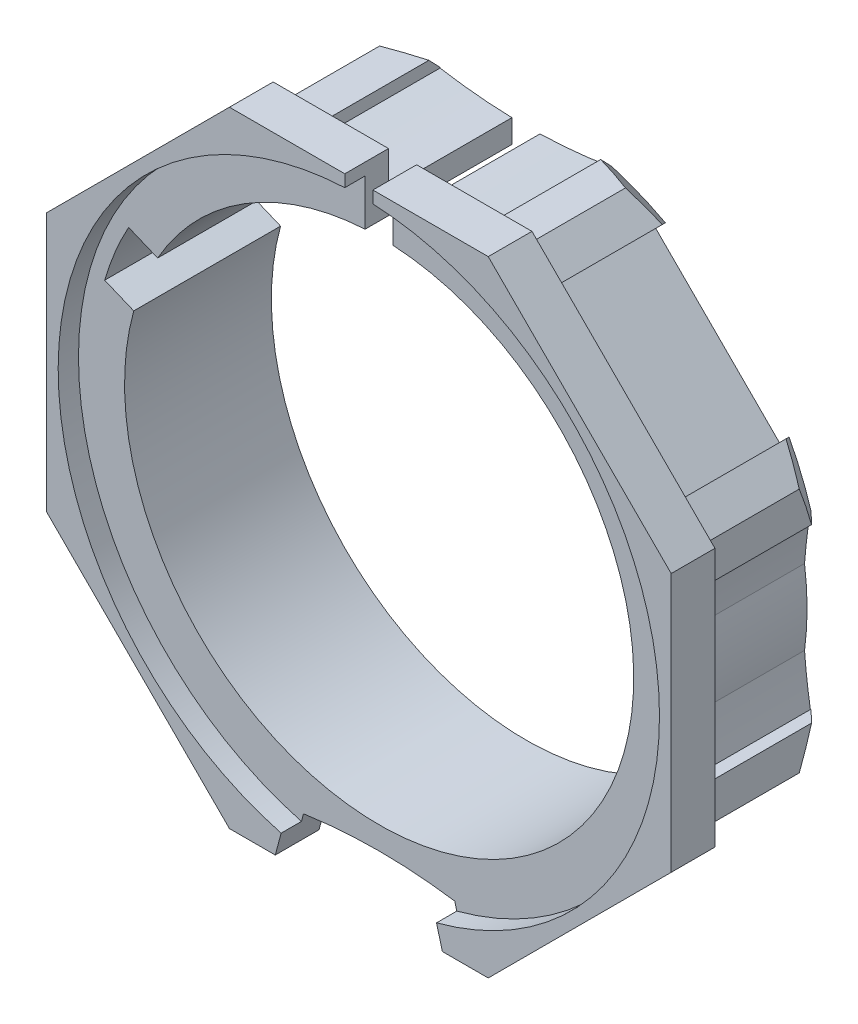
ISO-10303-21;
HEADER;
FILE_DESCRIPTION(('STEP AP214'),'2;1');
FILE_NAME('part.step','',(''),(''),'','','');
FILE_SCHEMA(('AUTOMOTIVE_DESIGN { 1 0 10303 214 1 1 1 1 }'));
ENDSEC;
DATA;
#1=APPLICATION_CONTEXT('core data for automotive mechanical design processes');
#2=APPLICATION_PROTOCOL_DEFINITION('international standard','automotive_design',2000,#1);
#3=PRODUCT_CONTEXT('',#1,'mechanical');
#4=PRODUCT('Part','Part','',(#3));
#5=PRODUCT_RELATED_PRODUCT_CATEGORY('part','',(#4));
#6=PRODUCT_DEFINITION_FORMATION('','',#4);
#7=PRODUCT_DEFINITION_CONTEXT('part definition',#1,'design');
#8=PRODUCT_DEFINITION('design','',#6,#7);
#9=PRODUCT_DEFINITION_SHAPE('','',#8);
#10=(LENGTH_UNIT() NAMED_UNIT(*) SI_UNIT(.MILLI.,.METRE.));
#11=(NAMED_UNIT(*) PLANE_ANGLE_UNIT() SI_UNIT($,.RADIAN.));
#12=(NAMED_UNIT(*) SI_UNIT($,.STERADIAN.) SOLID_ANGLE_UNIT());
#13=UNCERTAINTY_MEASURE_WITH_UNIT(LENGTH_MEASURE(1.E-05),#10,'distance_accuracy_value','');
#14=(GEOMETRIC_REPRESENTATION_CONTEXT(3) GLOBAL_UNCERTAINTY_ASSIGNED_CONTEXT((#13)) GLOBAL_UNIT_ASSIGNED_CONTEXT((#10,
#11,#12)) REPRESENTATION_CONTEXT('',''));
#15=CARTESIAN_POINT('',(0.,0.,0.));
#16=DIRECTION('',(0.,0.,1.));
#17=DIRECTION('',(1.,0.,0.));
#18=AXIS2_PLACEMENT_3D('',#15,#16,#17);
#19=CARTESIAN_POINT('',(0.,0.,0.));
#20=DIRECTION('',(0.,0.,1.));
#21=DIRECTION('',(1.,0.,0.));
#22=AXIS2_PLACEMENT_3D('',#19,#20,#21);
#23=PLANE('',#22);
#24=DIRECTION('',(-0.923879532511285,0.382683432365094,0.));
#25=VECTOR('',#24,1.);
#26=CARTESIAN_POINT('',(-17.95221911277,3.647679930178,0.));
#27=LINE('',#26,#25);
#28=CARTESIAN_POINT('',(-17.95221911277,3.647679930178,0.));
#29=VERTEX_POINT('',#28);
#30=CARTESIAN_POINT('',(-18.65422186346,3.93845899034,0.));
#31=VERTEX_POINT('',#30);
#32=EDGE_CURVE('E633',#29,#31,#27,.T.);
#33=ORIENTED_EDGE('',*,*,#32,.T.);
#34=CARTESIAN_POINT('',(0.,0.,0.));
#35=DIRECTION('',(0.,0.,-1.));
#36=DIRECTION('',(-0.978430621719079,0.206575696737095,0.));
#37=AXIS2_PLACEMENT_3D('',#34,#35,#36);
#38=CIRCLE('',#37,19.06545180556);
#39=CARTESIAN_POINT('',(-15.97543783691,10.40561571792,0.));
#40=VERTEX_POINT('',#39);
#41=EDGE_CURVE('E1151',#31,#40,#38,.T.);
#42=ORIENTED_EDGE('',*,*,#41,.T.);
#43=DIRECTION('',(0.923879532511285,-0.382683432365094,0.));
#44=VECTOR('',#43,1.);
#45=CARTESIAN_POINT('',(-15.97543783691,10.40561571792,0.));
#46=LINE('',#45,#44);
#47=CARTESIAN_POINT('',(-15.27343508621,10.11483665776,0.));
#48=VERTEX_POINT('',#47);
#49=EDGE_CURVE('E778',#40,#48,#46,.T.);
#50=ORIENTED_EDGE('',*,*,#49,.T.);
#51=CARTESIAN_POINT('',(-35.88566914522,35.88566914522,0.));
#52=DIRECTION('',(0.,0.,1.));
#53=DIRECTION('',(0.624613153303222,-0.780934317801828,0.));
#54=AXIS2_PLACEMENT_3D('',#51,#52,#53);
#55=CIRCLE('',#54,33.);
#56=CARTESIAN_POINT('',(-14.31690883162,10.90990932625,0.));
#57=VERTEX_POINT('',#56);
#58=EDGE_CURVE('E795',#48,#57,#55,.T.);
#59=ORIENTED_EDGE('',*,*,#58,.T.);
#60=CARTESIAN_POINT('',(0.,0.,0.));
#61=DIRECTION('',(0.,0.,-1.));
#62=DIRECTION('',(-0.795383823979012,0.606106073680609,0.));
#63=AXIS2_PLACEMENT_3D('',#60,#61,#62);
#64=CIRCLE('',#63,18.);
#65=CARTESIAN_POINT('',(-10.90990932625,14.31690883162,0.));
#66=VERTEX_POINT('',#65);
#67=EDGE_CURVE('E779',#57,#66,#64,.T.);
#68=ORIENTED_EDGE('',*,*,#67,.T.);
#69=CARTESIAN_POINT('',(-35.88566914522,35.88566914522,0.));
#70=DIRECTION('',(0.,0.,1.));
#71=DIRECTION('',(0.756841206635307,-0.653598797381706,0.));
#72=AXIS2_PLACEMENT_3D('',#69,#70,#71);
#73=CIRCLE('',#72,33.);
#74=CARTESIAN_POINT('',(-8.988431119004,16.76660571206,0.));
#75=VERTEX_POINT('',#74);
#76=EDGE_CURVE('E746',#66,#75,#73,.T.);
#77=ORIENTED_EDGE('',*,*,#76,.T.);
#78=DIRECTION('',(-0.707106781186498,0.707106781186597,0.));
#79=VECTOR('',#78,1.);
#80=CARTESIAN_POINT('',(-8.988431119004,16.76660571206,0.));
#81=LINE('',#80,#79);
#82=CARTESIAN_POINT('',(-9.019077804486,16.79725239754,0.));
#83=VERTEX_POINT('',#82);
#84=EDGE_CURVE('E763',#75,#83,#81,.T.);
#85=ORIENTED_EDGE('',*,*,#84,.T.);
#86=CARTESIAN_POINT('',(0.,0.,0.));
#87=DIRECTION('',(0.,0.,1.));
#88=DIRECTION('',(-0.288479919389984,0.957485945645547,0.));
#89=AXIS2_PLACEMENT_3D('',#86,#87,#88);
#90=CIRCLE('',#89,19.06545180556);
#91=CARTESIAN_POINT('',(-5.5,18.2549021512,0.));
#92=VERTEX_POINT('',#91);
#93=EDGE_CURVE('E1154',#92,#83,#90,.T.);
#94=ORIENTED_EDGE('',*,*,#93,.F.);
#95=DIRECTION('',(0.,-1.,0.));
#96=VECTOR('',#95,1.);
#97=CARTESIAN_POINT('',(-5.5,18.2549021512,0.));
#98=LINE('',#97,#96);
#99=CARTESIAN_POINT('',(-5.5,18.21156119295,0.));
#100=VERTEX_POINT('',#99);
#101=EDGE_CURVE('E853',#92,#100,#98,.T.);
#102=ORIENTED_EDGE('',*,*,#101,.T.);
#103=CARTESIAN_POINT('',(0.,50.75,0.));
#104=DIRECTION('',(0.,0.,1.));
#105=DIRECTION('',(-0.166666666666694,-0.986013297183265,0.));
#106=AXIS2_PLACEMENT_3D('',#103,#104,#105);
#107=CIRCLE('',#106,33.);
#108=CARTESIAN_POINT('',(-0.9,17.76227501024,0.));
#109=VERTEX_POINT('',#108);
#110=EDGE_CURVE('E892',#100,#109,#107,.T.);
#111=ORIENTED_EDGE('',*,*,#110,.T.);
#112=DIRECTION('',(0.,-1.,0.));
#113=VECTOR('',#112,1.);
#114=CARTESIAN_POINT('',(-0.9,17.76227501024,0.));
#115=LINE('',#114,#113);
#116=CARTESIAN_POINT('',(-0.9,16.27513440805,0.));
#117=VERTEX_POINT('',#116);
#118=EDGE_CURVE('E953',#109,#117,#115,.T.);
#119=ORIENTED_EDGE('',*,*,#118,.T.);
#120=CARTESIAN_POINT('',(0.,0.,0.));
#121=DIRECTION('',(0.,0.,1.));
#122=DIRECTION('',(-0.0552147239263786,0.998474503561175,0.));
#123=AXIS2_PLACEMENT_3D('',#120,#121,#122);
#124=CIRCLE('',#123,16.3);
#125=CARTESIAN_POINT('',(-14.18008016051,8.038365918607,0.));
#126=VERTEX_POINT('',#125);
#127=EDGE_CURVE('E912',#117,#126,#124,.T.);
#128=ORIENTED_EDGE('',*,*,#127,.T.);
#129=DIRECTION('',(0.923879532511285,-0.382683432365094,0.));
#130=VECTOR('',#129,1.);
#131=CARTESIAN_POINT('',(-16.04035482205,8.808916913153,0.));
#132=LINE('',#131,#130);
#133=CARTESIAN_POINT('',(-16.04035482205,8.808916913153,0.));
#134=VERTEX_POINT('',#133);
#135=EDGE_CURVE('E1843',#134,#126,#132,.T.);
#136=ORIENTED_EDGE('',*,*,#135,.F.);
#137=CARTESIAN_POINT('',(0.,0.,0.));
#138=DIRECTION('',(0.,0.,-1.));
#139=DIRECTION('',(-0.960168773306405,0.279420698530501,0.));
#140=AXIS2_PLACEMENT_3D('',#137,#138,#139);
#141=CIRCLE('',#140,18.3);
#142=CARTESIAN_POINT('',(-17.57108855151,5.113398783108,0.));
#143=VERTEX_POINT('',#142);
#144=EDGE_CURVE('E1850',#143,#134,#141,.T.);
#145=ORIENTED_EDGE('',*,*,#144,.F.);
#146=DIRECTION('',(-0.923879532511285,0.382683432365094,0.));
#147=VECTOR('',#146,1.);
#148=CARTESIAN_POINT('',(-15.71081388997,4.342847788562,0.));
#149=LINE('',#148,#147);
#150=CARTESIAN_POINT('',(-15.71081388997,4.342847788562,0.));
#151=VERTEX_POINT('',#150);
#152=EDGE_CURVE('E934',#151,#143,#149,.T.);
#153=ORIENTED_EDGE('',*,*,#152,.F.);
#154=CARTESIAN_POINT('',(0.,0.,0.));
#155=DIRECTION('',(0.,0.,1.));
#156=DIRECTION('',(-0.9638536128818,0.2664323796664,0.));
#157=AXIS2_PLACEMENT_3D('',#154,#155,#156);
#158=CIRCLE('',#157,16.3);
#159=CARTESIAN_POINT('',(0.9,16.27513440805,0.));
#160=VERTEX_POINT('',#159);
#161=EDGE_CURVE('E741',#151,#160,#158,.T.);
#162=ORIENTED_EDGE('',*,*,#161,.T.);
#163=DIRECTION('',(0.,-1.,0.));
#164=VECTOR('',#163,1.);
#165=CARTESIAN_POINT('',(0.9,17.76227501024,0.));
#166=LINE('',#165,#164);
#167=CARTESIAN_POINT('',(0.9,17.76227501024,0.));
#168=VERTEX_POINT('',#167);
#169=EDGE_CURVE('E896',#168,#160,#166,.T.);
#170=ORIENTED_EDGE('',*,*,#169,.F.);
#171=CARTESIAN_POINT('',(0.,50.75,0.));
#172=DIRECTION('',(0.,0.,1.));
#173=DIRECTION('',(0.0272727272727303,-0.99962802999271,0.));
#174=AXIS2_PLACEMENT_3D('',#171,#172,#173);
#175=CIRCLE('',#174,33.);
#176=CARTESIAN_POINT('',(5.5,18.21156119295,0.));
#177=VERTEX_POINT('',#176);
#178=EDGE_CURVE('E863',#168,#177,#175,.T.);
#179=ORIENTED_EDGE('',*,*,#178,.T.);
#180=DIRECTION('',(0.,-1.,0.));
#181=VECTOR('',#180,1.);
#182=CARTESIAN_POINT('',(5.5,18.2549021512,0.));
#183=LINE('',#182,#181);
#184=CARTESIAN_POINT('',(5.5,18.2549021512,0.));
#185=VERTEX_POINT('',#184);
#186=EDGE_CURVE('E753',#185,#177,#183,.T.);
#187=ORIENTED_EDGE('',*,*,#186,.F.);
#188=CARTESIAN_POINT('',(0.,0.,0.));
#189=DIRECTION('',(0.,0.,1.));
#190=DIRECTION('',(0.468221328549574,0.88361121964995,0.));
#191=AXIS2_PLACEMENT_3D('',#188,#189,#190);
#192=CIRCLE('',#191,19.06545180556);
#193=CARTESIAN_POINT('',(8.926851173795,16.84644712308,0.));
#194=VERTEX_POINT('',#193);
#195=EDGE_CURVE('E1157',#194,#185,#192,.T.);
#196=ORIENTED_EDGE('',*,*,#195,.F.);
#197=DIRECTION('',(-0.707106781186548,-0.707106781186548,0.));
#198=VECTOR('',#197,1.);
#199=CARTESIAN_POINT('',(8.926851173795,16.84644712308,0.));
#200=LINE('',#199,#198);
#201=CARTESIAN_POINT('',(8.308504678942,16.22810062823,0.));
#202=VERTEX_POINT('',#201);
#203=EDGE_CURVE('E698',#194,#202,#200,.T.);
#204=ORIENTED_EDGE('',*,*,#203,.T.);
#205=DIRECTION('',(0.707106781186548,-0.707106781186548,0.));
#206=VECTOR('',#205,1.);
#207=CARTESIAN_POINT('',(8.308504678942,16.22810062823,0.));
#208=LINE('',#207,#206);
#209=CARTESIAN_POINT('',(16.22810062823,8.308504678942,0.));
#210=VERTEX_POINT('',#209);
#211=EDGE_CURVE('E715',#202,#210,#208,.T.);
#212=ORIENTED_EDGE('',*,*,#211,.T.);
#213=DIRECTION('',(0.707106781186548,0.707106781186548,0.));
#214=VECTOR('',#213,1.);
#215=CARTESIAN_POINT('',(16.22810062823,8.308504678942,0.));
#216=LINE('',#215,#214);
#217=CARTESIAN_POINT('',(16.84644712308,8.926851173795,0.));
#218=VERTEX_POINT('',#217);
#219=EDGE_CURVE('E664',#210,#218,#216,.T.);
#220=ORIENTED_EDGE('',*,*,#219,.T.);
#221=CARTESIAN_POINT('',(0.,0.,0.));
#222=DIRECTION('',(0.,0.,1.));
#223=DIRECTION('',(0.957485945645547,0.288479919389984,0.));
#224=AXIS2_PLACEMENT_3D('',#221,#222,#223);
#225=CIRCLE('',#224,19.06545180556);
#226=CARTESIAN_POINT('',(18.2549021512,5.5,0.));
#227=VERTEX_POINT('',#226);
#228=EDGE_CURVE('E1165',#227,#218,#225,.T.);
#229=ORIENTED_EDGE('',*,*,#228,.F.);
#230=DIRECTION('',(-1.,0.,0.));
#231=VECTOR('',#230,1.);
#232=CARTESIAN_POINT('',(18.2549021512,5.5,0.));
#233=LINE('',#232,#231);
#234=CARTESIAN_POINT('',(18.21156119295,5.5,0.));
#235=VERTEX_POINT('',#234);
#236=EDGE_CURVE('E639',#227,#235,#233,.T.);
#237=ORIENTED_EDGE('',*,*,#236,.T.);
#238=CARTESIAN_POINT('',(50.75,0.,0.));
#239=DIRECTION('',(0.,0.,1.));
#240=DIRECTION('',(-0.986013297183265,0.166666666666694,0.));
#241=AXIS2_PLACEMENT_3D('',#238,#239,#240);
#242=CIRCLE('',#241,33.);
#243=CARTESIAN_POINT('',(17.83805418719,2.409112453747,0.));
#244=VERTEX_POINT('',#243);
#245=EDGE_CURVE('E1631',#235,#244,#242,.T.);
#246=ORIENTED_EDGE('',*,*,#245,.T.);
#247=CARTESIAN_POINT('',(0.,0.,0.));
#248=DIRECTION('',(0.,0.,-1.));
#249=DIRECTION('',(0.991003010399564,0.133839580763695,0.));
#250=AXIS2_PLACEMENT_3D('',#247,#248,#249);
#251=CIRCLE('',#250,18.);
#252=CARTESIAN_POINT('',(17.83805418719,-2.409112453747,0.));
#253=VERTEX_POINT('',#252);
#254=EDGE_CURVE('E1622',#244,#253,#251,.T.);
#255=ORIENTED_EDGE('',*,*,#254,.T.);
#256=CARTESIAN_POINT('',(50.75,0.,0.));
#257=DIRECTION('',(0.,0.,1.));
#258=DIRECTION('',(-0.997331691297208,-0.0730034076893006,0.));
#259=AXIS2_PLACEMENT_3D('',#256,#257,#258);
#260=CIRCLE('',#259,33.);
#261=CARTESIAN_POINT('',(18.21156119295,-5.5,0.));
#262=VERTEX_POINT('',#261);
#263=EDGE_CURVE('E1530',#253,#262,#260,.T.);
#264=ORIENTED_EDGE('',*,*,#263,.T.);
#265=DIRECTION('',(-1.,-1.024640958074E-13,0.));
#266=VECTOR('',#265,1.);
#267=CARTESIAN_POINT('',(18.2549021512,-5.5,0.));
#268=LINE('',#267,#266);
#269=CARTESIAN_POINT('',(18.2549021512,-5.5,0.));
#270=VERTEX_POINT('',#269);
#271=EDGE_CURVE('E1514',#270,#262,#268,.T.);
#272=ORIENTED_EDGE('',*,*,#271,.F.);
#273=CARTESIAN_POINT('',(0.,0.,0.));
#274=DIRECTION('',(0.,0.,-1.));
#275=DIRECTION('',(0.957485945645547,-0.288479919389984,0.));
#276=AXIS2_PLACEMENT_3D('',#273,#274,#275);
#277=CIRCLE('',#276,19.06545180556);
#278=CARTESIAN_POINT('',(16.79725239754,-9.019077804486,0.));
#279=VERTEX_POINT('',#278);
#280=EDGE_CURVE('E1129',#270,#279,#277,.T.);
#281=ORIENTED_EDGE('',*,*,#280,.T.);
#282=DIRECTION('',(0.707106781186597,-0.707106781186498,0.));
#283=VECTOR('',#282,1.);
#284=CARTESIAN_POINT('',(16.76660571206,-8.988431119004,0.));
#285=LINE('',#284,#283);
#286=CARTESIAN_POINT('',(16.76660571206,-8.988431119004,0.));
#287=VERTEX_POINT('',#286);
#288=EDGE_CURVE('E1548',#287,#279,#285,.T.);
#289=ORIENTED_EDGE('',*,*,#288,.F.);
#290=CARTESIAN_POINT('',(35.88566914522,-35.88566914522,0.));
#291=DIRECTION('',(0.,0.,1.));
#292=DIRECTION('',(-0.579365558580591,0.815067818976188,0.));
#293=AXIS2_PLACEMENT_3D('',#290,#291,#292);
#294=CIRCLE('',#293,33.);
#295=CARTESIAN_POINT('',(14.31690883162,-10.90990932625,0.));
#296=VERTEX_POINT('',#295);
#297=EDGE_CURVE('E1185',#287,#296,#294,.T.);
#298=ORIENTED_EDGE('',*,*,#297,.T.);
#299=CARTESIAN_POINT('',(0.,0.,0.));
#300=DIRECTION('',(0.,0.,-1.));
#301=DIRECTION('',(0.795383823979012,-0.606106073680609,0.));
#302=AXIS2_PLACEMENT_3D('',#299,#300,#301);
#303=CIRCLE('',#302,18.);
#304=CARTESIAN_POINT('',(10.90990932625,-14.31690883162,0.));
#305=VERTEX_POINT('',#304);
#306=EDGE_CURVE('E1141',#296,#305,#303,.T.);
#307=ORIENTED_EDGE('',*,*,#306,.T.);
#308=CARTESIAN_POINT('',(35.88566914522,-35.88566914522,0.));
#309=DIRECTION('',(0.,0.,1.));
#310=DIRECTION('',(-0.756841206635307,0.653598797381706,0.));
#311=AXIS2_PLACEMENT_3D('',#308,#309,#310);
#312=CIRCLE('',#311,33.);
#313=CARTESIAN_POINT('',(8.988431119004,-16.76660571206,0.));
#314=VERTEX_POINT('',#313);
#315=EDGE_CURVE('E1025',#305,#314,#312,.T.);
#316=ORIENTED_EDGE('',*,*,#315,.T.);
#317=DIRECTION('',(-0.707106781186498,0.707106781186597,0.));
#318=VECTOR('',#317,1.);
#319=CARTESIAN_POINT('',(9.019077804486,-16.79725239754,0.));
#320=LINE('',#319,#318);
#321=CARTESIAN_POINT('',(9.019077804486,-16.79725239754,0.));
#322=VERTEX_POINT('',#321);
#323=EDGE_CURVE('E864',#322,#314,#320,.T.);
#324=ORIENTED_EDGE('',*,*,#323,.F.);
#325=CARTESIAN_POINT('',(0.,0.,0.));
#326=DIRECTION('',(0.,0.,1.));
#327=DIRECTION('',(0.258379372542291,-0.966043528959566,0.));
#328=AXIS2_PLACEMENT_3D('',#325,#326,#327);
#329=CIRCLE('',#328,19.06545180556);
#330=CARTESIAN_POINT('',(4.926119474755,-18.41805634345,0.));
#331=VERTEX_POINT('',#330);
#332=EDGE_CURVE('E872',#331,#322,#329,.T.);
#333=ORIENTED_EDGE('',*,*,#332,.F.);
#334=DIRECTION('',(-0.258819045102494,0.965925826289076,0.));
#335=VECTOR('',#334,1.);
#336=CARTESIAN_POINT('',(4.926119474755,-18.41805634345,0.));
#337=LINE('',#336,#335);
#338=CARTESIAN_POINT('',(4.842848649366,-18.10728539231,0.));
#339=VERTEX_POINT('',#338);
#340=EDGE_CURVE('E1147',#331,#339,#337,.T.);
#341=ORIENTED_EDGE('',*,*,#340,.T.);
#342=CARTESIAN_POINT('',(0.,-50.75,0.));
#343=DIRECTION('',(0.,0.,1.));
#344=DIRECTION('',(0.146752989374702,0.989173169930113,0.));
#345=AXIS2_PLACEMENT_3D('',#342,#343,#344);
#346=CIRCLE('',#345,33.);
#347=CARTESIAN_POINT('',(-4.842848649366,-18.10728539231,0.));
#348=VERTEX_POINT('',#347);
#349=EDGE_CURVE('E1134',#339,#348,#346,.T.);
#350=ORIENTED_EDGE('',*,*,#349,.T.);
#351=DIRECTION('',(-0.258819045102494,-0.965925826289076,0.));
#352=VECTOR('',#351,1.);
#353=CARTESIAN_POINT('',(-4.842848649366,-18.10728539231,0.));
#354=LINE('',#353,#352);
#355=CARTESIAN_POINT('',(-4.926119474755,-18.41805634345,0.));
#356=VERTEX_POINT('',#355);
#357=EDGE_CURVE('E1112',#348,#356,#354,.T.);
#358=ORIENTED_EDGE('',*,*,#357,.T.);
#359=CARTESIAN_POINT('',(0.,0.,0.));
#360=DIRECTION('',(0.,0.,1.));
#361=DIRECTION('',(-0.468221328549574,-0.88361121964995,0.));
#362=AXIS2_PLACEMENT_3D('',#359,#360,#361);
#363=CIRCLE('',#362,19.06545180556);
#364=CARTESIAN_POINT('',(-8.926851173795,-16.84644712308,0.));
#365=VERTEX_POINT('',#364);
#366=EDGE_CURVE('E1128',#365,#356,#363,.T.);
#367=ORIENTED_EDGE('',*,*,#366,.F.);
#368=DIRECTION('',(-0.707106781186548,-0.707106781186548,0.));
#369=VECTOR('',#368,1.);
#370=CARTESIAN_POINT('',(-8.308504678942,-16.22810062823,0.));
#371=LINE('',#370,#369);
#372=CARTESIAN_POINT('',(-8.308504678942,-16.22810062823,0.));
#373=VERTEX_POINT('',#372);
#374=EDGE_CURVE('E1069',#373,#365,#371,.T.);
#375=ORIENTED_EDGE('',*,*,#374,.F.);
#376=DIRECTION('',(0.707106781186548,-0.707106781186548,0.));
#377=VECTOR('',#376,1.);
#378=CARTESIAN_POINT('',(-16.22810062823,-8.308504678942,0.));
#379=LINE('',#378,#377);
#380=CARTESIAN_POINT('',(-16.22810062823,-8.308504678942,0.));
#381=VERTEX_POINT('',#380);
#382=EDGE_CURVE('E714',#381,#373,#379,.T.);
#383=ORIENTED_EDGE('',*,*,#382,.F.);
#384=DIRECTION('',(0.707106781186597,0.707106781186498,0.));
#385=VECTOR('',#384,1.);
#386=CARTESIAN_POINT('',(-16.84644712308,-8.926851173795,0.));
#387=LINE('',#386,#385);
#388=CARTESIAN_POINT('',(-16.84644712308,-8.926851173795,0.));
#389=VERTEX_POINT('',#388);
#390=EDGE_CURVE('E1032',#389,#381,#387,.T.);
#391=ORIENTED_EDGE('',*,*,#390,.F.);
#392=CARTESIAN_POINT('',(0.,0.,0.));
#393=DIRECTION('',(0.,0.,1.));
#394=DIRECTION('',(-0.957485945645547,-0.288479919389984,0.));
#395=AXIS2_PLACEMENT_3D('',#392,#393,#394);
#396=CIRCLE('',#395,19.06545180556);
#397=CARTESIAN_POINT('',(-18.2549021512,-5.5,0.));
#398=VERTEX_POINT('',#397);
#399=EDGE_CURVE('E1124',#398,#389,#396,.T.);
#400=ORIENTED_EDGE('',*,*,#399,.F.);
#401=DIRECTION('',(1.,0.,0.));
#402=VECTOR('',#401,1.);
#403=CARTESIAN_POINT('',(-18.2549021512,-5.5,0.));
#404=LINE('',#403,#402);
#405=CARTESIAN_POINT('',(-18.21156119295,-5.5,0.));
#406=VERTEX_POINT('',#405);
#407=EDGE_CURVE('E987',#398,#406,#404,.T.);
#408=ORIENTED_EDGE('',*,*,#407,.T.);
#409=CARTESIAN_POINT('',(-50.75,0.,0.));
#410=DIRECTION('',(0.,0.,1.));
#411=DIRECTION('',(0.986013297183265,-0.166666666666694,0.));
#412=AXIS2_PLACEMENT_3D('',#409,#410,#411);
#413=CIRCLE('',#412,33.);
#414=CARTESIAN_POINT('',(-17.83805418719,-2.409112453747,0.));
#415=VERTEX_POINT('',#414);
#416=EDGE_CURVE('E26',#406,#415,#413,.T.);
#417=ORIENTED_EDGE('',*,*,#416,.T.);
#418=CARTESIAN_POINT('',(0.,0.,0.));
#419=DIRECTION('',(0.,0.,-1.));
#420=DIRECTION('',(-0.991003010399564,-0.133839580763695,0.));
#421=AXIS2_PLACEMENT_3D('',#418,#419,#420);
#422=CIRCLE('',#421,18.);
#423=CARTESIAN_POINT('',(-17.83805418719,2.409112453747,0.));
#424=VERTEX_POINT('',#423);
#425=EDGE_CURVE('E415',#415,#424,#422,.T.);
#426=ORIENTED_EDGE('',*,*,#425,.T.);
#427=CARTESIAN_POINT('',(-50.75,0.,0.));
#428=DIRECTION('',(0.,0.,1.));
#429=DIRECTION('',(0.997331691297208,0.0730034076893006,0.));
#430=AXIS2_PLACEMENT_3D('',#427,#428,#429);
#431=CIRCLE('',#430,33.);
#432=EDGE_CURVE('E11',#424,#29,#431,.T.);
#433=ORIENTED_EDGE('',*,*,#432,.T.);
#434=EDGE_LOOP('',(#33,#42,#50,#59,#68,#77,#85,#94,#102,#111,#119,#128,#136,#145,#153,#162,#170,
#179,#187,#196,#204,#212,#220,#229,#237,#246,#255,#264,#272,#281,#289,#298,#307,#316,#324,#333,
#341,#350,#358,#367,#375,#383,#391,#400,#408,#417,#426,#433));
#435=FACE_BOUND('',#434,.T.);
#436=ADVANCED_FACE('F16',(#435),#23,.F.);
#437=CARTESIAN_POINT('',(-50.75,0.,0.));
#438=DIRECTION('',(0.,0.,-1.));
#439=DIRECTION('',(-1.,0.,0.));
#440=AXIS2_PLACEMENT_3D('',#437,#438,#439);
#441=CYLINDRICAL_SURFACE('',#440,33.);
#442=CARTESIAN_POINT('',(-50.75,0.,7.9));
#443=DIRECTION('',(0.,0.,-1.));
#444=DIRECTION('',(0.993872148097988,0.110535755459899,0.));
#445=AXIS2_PLACEMENT_3D('',#442,#443,#444);
#446=CIRCLE('',#445,33.);
#447=CARTESIAN_POINT('',(-17.95221911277,3.647679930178,7.9));
#448=VERTEX_POINT('',#447);
#449=CARTESIAN_POINT('',(-17.83805418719,2.409112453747,7.9));
#450=VERTEX_POINT('',#449);
#451=EDGE_CURVE('E432',#448,#450,#446,.T.);
#452=ORIENTED_EDGE('',*,*,#451,.F.);
#453=DIRECTION('',(0.,0.,-1.));
#454=VECTOR('',#453,1.);
#455=CARTESIAN_POINT('',(-17.95221911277,3.647679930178,7.9));
#456=LINE('',#455,#454);
#457=EDGE_CURVE('E624',#448,#29,#456,.T.);
#458=ORIENTED_EDGE('',*,*,#457,.T.);
#459=ORIENTED_EDGE('',*,*,#432,.F.);
#460=DIRECTION('',(0.,0.,-1.));
#461=VECTOR('',#460,1.);
#462=CARTESIAN_POINT('',(-17.83805418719,2.409112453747,7.9));
#463=LINE('',#462,#461);
#464=EDGE_CURVE('E428',#450,#424,#463,.T.);
#465=ORIENTED_EDGE('',*,*,#464,.F.);
#466=EDGE_LOOP('',(#452,#458,#459,#465));
#467=FACE_BOUND('',#466,.T.);
#468=ADVANCED_FACE('F2744',(#467),#441,.F.);
#469=CARTESIAN_POINT('',(-50.75,0.,0.));
#470=DIRECTION('',(0.,0.,-1.));
#471=DIRECTION('',(-1.,0.,0.));
#472=AXIS2_PLACEMENT_3D('',#469,#470,#471);
#473=CYLINDRICAL_SURFACE('',#472,33.);
#474=ORIENTED_EDGE('',*,*,#416,.F.);
#475=DIRECTION('',(0.,0.,-1.));
#476=VECTOR('',#475,1.);
#477=CARTESIAN_POINT('',(-18.21156119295,-5.5,7.9));
#478=LINE('',#477,#476);
#479=CARTESIAN_POINT('',(-18.21156119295,-5.5,7.9));
#480=VERTEX_POINT('',#479);
#481=EDGE_CURVE('E423',#480,#406,#478,.T.);
#482=ORIENTED_EDGE('',*,*,#481,.F.);
#483=CARTESIAN_POINT('',(-50.75,0.,7.9));
#484=DIRECTION('',(0.,0.,-1.));
#485=DIRECTION('',(0.997331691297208,-0.0730034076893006,0.));
#486=AXIS2_PLACEMENT_3D('',#483,#484,#485);
#487=CIRCLE('',#486,33.);
#488=CARTESIAN_POINT('',(-17.83805418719,-2.409112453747,7.9));
#489=VERTEX_POINT('',#488);
#490=EDGE_CURVE('E420',#489,#480,#487,.T.);
#491=ORIENTED_EDGE('',*,*,#490,.F.);
#492=DIRECTION('',(0.,0.,-1.));
#493=VECTOR('',#492,1.);
#494=CARTESIAN_POINT('',(-17.83805418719,-2.409112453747,7.9));
#495=LINE('',#494,#493);
#496=EDGE_CURVE('E408',#489,#415,#495,.T.);
#497=ORIENTED_EDGE('',*,*,#496,.T.);
#498=EDGE_LOOP('',(#474,#482,#491,#497));
#499=FACE_BOUND('',#498,.T.);
#500=ADVANCED_FACE('F421',(#499),#473,.F.);
#501=CARTESIAN_POINT('',(0.,0.,0.));
#502=DIRECTION('',(0.,0.,-1.));
#503=DIRECTION('',(1.,0.,0.));
#504=AXIS2_PLACEMENT_3D('',#501,#502,#503);
#505=CYLINDRICAL_SURFACE('',#504,18.);
#506=ORIENTED_EDGE('',*,*,#464,.T.);
#507=ORIENTED_EDGE('',*,*,#425,.F.);
#508=ORIENTED_EDGE('',*,*,#496,.F.);
#509=CARTESIAN_POINT('',(0.,0.,7.9));
#510=DIRECTION('',(0.,0.,-1.));
#511=DIRECTION('',(-0.991003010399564,-0.133839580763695,0.));
#512=AXIS2_PLACEMENT_3D('',#509,#510,#511);
#513=CIRCLE('',#512,18.);
#514=EDGE_CURVE('E413',#489,#450,#513,.T.);
#515=ORIENTED_EDGE('',*,*,#514,.T.);
#516=EDGE_LOOP('',(#506,#507,#508,#515));
#517=FACE_BOUND('',#516,.T.);
#518=ADVANCED_FACE('F411',(#517),#505,.T.);
#519=CARTESIAN_POINT('',(0.,0.,7.9));
#520=DIRECTION('',(0.,0.,-1.));
#521=DIRECTION('',(0.,-1.,0.));
#522=AXIS2_PLACEMENT_3D('',#519,#520,#521);
#523=PLANE('',#522);
#524=CARTESIAN_POINT('',(35.88566914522,-35.88566914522,7.9));
#525=DIRECTION('',(0.,0.,-1.));
#526=DIRECTION('',(-0.653598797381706,0.756841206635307,0.));
#527=AXIS2_PLACEMENT_3D('',#524,#525,#526);
#528=CIRCLE('',#527,33.);
#529=CARTESIAN_POINT('',(14.31690883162,-10.90990932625,7.9));
#530=VERTEX_POINT('',#529);
#531=CARTESIAN_POINT('',(16.76660571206,-8.988431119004,7.9));
#532=VERTEX_POINT('',#531);
#533=EDGE_CURVE('E1189',#530,#532,#528,.T.);
#534=ORIENTED_EDGE('',*,*,#533,.T.);
#535=DIRECTION('',(0.707106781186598,-0.707106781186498,0.));
#536=VECTOR('',#535,1.);
#537=CARTESIAN_POINT('',(16.76660571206,-8.988431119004,7.9));
#538=LINE('',#537,#536);
#539=CARTESIAN_POINT('',(17.32411613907,-9.545941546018,7.9));
#540=VERTEX_POINT('',#539);
#541=EDGE_CURVE('E1532',#532,#540,#538,.T.);
#542=ORIENTED_EDGE('',*,*,#541,.T.);
#543=DIRECTION('',(0.707106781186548,0.707106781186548,0.));
#544=VECTOR('',#543,1.);
#545=CARTESIAN_POINT('',(17.32411613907,-9.545941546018,7.9));
#546=LINE('',#545,#544);
#547=CARTESIAN_POINT('',(19.,-7.870057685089,7.9));
#548=VERTEX_POINT('',#547);
#549=EDGE_CURVE('E1576',#540,#548,#546,.T.);
#550=ORIENTED_EDGE('',*,*,#549,.T.);
#551=DIRECTION('',(0.,1.,0.));
#552=VECTOR('',#551,1.);
#553=CARTESIAN_POINT('',(19.,-7.870057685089,7.9));
#554=LINE('',#553,#552);
#555=CARTESIAN_POINT('',(19.,-5.5,7.9));
#556=VERTEX_POINT('',#555);
#557=EDGE_CURVE('E1515',#548,#556,#554,.T.);
#558=ORIENTED_EDGE('',*,*,#557,.T.);
#559=DIRECTION('',(-1.,0.,0.));
#560=VECTOR('',#559,1.);
#561=CARTESIAN_POINT('',(19.,-5.5,7.9));
#562=LINE('',#561,#560);
#563=CARTESIAN_POINT('',(18.21156119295,-5.5,7.9));
#564=VERTEX_POINT('',#563);
#565=EDGE_CURVE('E1606',#556,#564,#562,.T.);
#566=ORIENTED_EDGE('',*,*,#565,.T.);
#567=CARTESIAN_POINT('',(50.75,0.,7.9));
#568=DIRECTION('',(0.,0.,-1.));
#569=DIRECTION('',(-0.986013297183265,-0.166666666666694,0.));
#570=AXIS2_PLACEMENT_3D('',#567,#568,#569);
#571=CIRCLE('',#570,33.);
#572=CARTESIAN_POINT('',(17.83805418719,-2.409112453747,7.9));
#573=VERTEX_POINT('',#572);
#574=EDGE_CURVE('E1527',#564,#573,#571,.T.);
#575=ORIENTED_EDGE('',*,*,#574,.T.);
#576=CARTESIAN_POINT('',(0.,0.,7.9));
#577=DIRECTION('',(0.,0.,-1.));
#578=DIRECTION('',(0.991003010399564,0.133839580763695,0.));
#579=AXIS2_PLACEMENT_3D('',#576,#577,#578);
#580=CIRCLE('',#579,18.);
#581=CARTESIAN_POINT('',(17.83805418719,2.409112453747,7.9));
#582=VERTEX_POINT('',#581);
#583=EDGE_CURVE('E1627',#582,#573,#580,.T.);
#584=ORIENTED_EDGE('',*,*,#583,.F.);
#585=CARTESIAN_POINT('',(50.75,0.,7.9));
#586=DIRECTION('',(0.,0.,-1.));
#587=DIRECTION('',(-0.997331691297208,0.0730034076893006,0.));
#588=AXIS2_PLACEMENT_3D('',#585,#586,#587);
#589=CIRCLE('',#588,33.);
#590=CARTESIAN_POINT('',(18.21156119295,5.5,7.9));
#591=VERTEX_POINT('',#590);
#592=EDGE_CURVE('E1531',#582,#591,#589,.T.);
#593=ORIENTED_EDGE('',*,*,#592,.T.);
#594=DIRECTION('',(-1.,0.,0.));
#595=VECTOR('',#594,1.);
#596=CARTESIAN_POINT('',(19.,5.5,7.9));
#597=LINE('',#596,#595);
#598=CARTESIAN_POINT('',(19.,5.5,7.9));
#599=VERTEX_POINT('',#598);
#600=EDGE_CURVE('E642',#599,#591,#597,.T.);
#601=ORIENTED_EDGE('',*,*,#600,.F.);
#602=DIRECTION('',(0.,-1.,0.));
#603=VECTOR('',#602,1.);
#604=CARTESIAN_POINT('',(19.,7.870057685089,7.9));
#605=LINE('',#604,#603);
#606=CARTESIAN_POINT('',(19.,7.870057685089,7.9));
#607=VERTEX_POINT('',#606);
#608=EDGE_CURVE('E1486',#607,#599,#605,.T.);
#609=ORIENTED_EDGE('',*,*,#608,.F.);
#610=DIRECTION('',(0.707106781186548,-0.707106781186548,0.));
#611=VECTOR('',#610,1.);
#612=CARTESIAN_POINT('',(17.39482681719,9.4752308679,7.9));
#613=LINE('',#612,#611);
#614=CARTESIAN_POINT('',(17.39482681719,9.4752308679,7.9));
#615=VERTEX_POINT('',#614);
#616=EDGE_CURVE('E656',#615,#607,#613,.T.);
#617=ORIENTED_EDGE('',*,*,#616,.F.);
#618=DIRECTION('',(0.707106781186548,0.707106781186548,0.));
#619=VECTOR('',#618,1.);
#620=CARTESIAN_POINT('',(16.22810062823,8.308504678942,7.9));
#621=LINE('',#620,#619);
#622=CARTESIAN_POINT('',(16.22810062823,8.308504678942,7.9));
#623=VERTEX_POINT('',#622);
#624=EDGE_CURVE('E676',#623,#615,#621,.T.);
#625=ORIENTED_EDGE('',*,*,#624,.F.);
#626=DIRECTION('',(0.707106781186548,-0.707106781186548,0.));
#627=VECTOR('',#626,1.);
#628=CARTESIAN_POINT('',(8.308504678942,16.22810062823,7.9));
#629=LINE('',#628,#627);
#630=CARTESIAN_POINT('',(8.308504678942,16.22810062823,7.9));
#631=VERTEX_POINT('',#630);
#632=EDGE_CURVE('E681',#631,#623,#629,.T.);
#633=ORIENTED_EDGE('',*,*,#632,.F.);
#634=DIRECTION('',(-0.707106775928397,-0.707106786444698,0.));
#635=VECTOR('',#634,1.);
#636=CARTESIAN_POINT('',(9.475230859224,17.39482682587,7.9));
#637=LINE('',#636,#635);
#638=CARTESIAN_POINT('',(9.475230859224,17.39482682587,7.9));
#639=VERTEX_POINT('',#638);
#640=EDGE_CURVE('E722',#639,#631,#637,.T.);
#641=ORIENTED_EDGE('',*,*,#640,.F.);
#642=DIRECTION('',(-0.707106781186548,0.707106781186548,0.));
#643=VECTOR('',#642,1.);
#644=CARTESIAN_POINT('',(9.475230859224,17.39482682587,7.9));
#645=LINE('',#644,#643);
#646=CARTESIAN_POINT('',(7.870057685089,19.,7.9));
#647=VERTEX_POINT('',#646);
#648=EDGE_CURVE('E735',#639,#647,#645,.T.);
#649=ORIENTED_EDGE('',*,*,#648,.T.);
#650=DIRECTION('',(-1.,0.,0.));
#651=VECTOR('',#650,1.);
#652=CARTESIAN_POINT('',(7.870057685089,19.,7.9));
#653=LINE('',#652,#651);
#654=CARTESIAN_POINT('',(5.5,19.,7.9));
#655=VERTEX_POINT('',#654);
#656=EDGE_CURVE('E726',#647,#655,#653,.T.);
#657=ORIENTED_EDGE('',*,*,#656,.T.);
#658=DIRECTION('',(0.,-1.,0.));
#659=VECTOR('',#658,1.);
#660=CARTESIAN_POINT('',(5.5,19.,7.9));
#661=LINE('',#660,#659);
#662=CARTESIAN_POINT('',(5.5,18.21156119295,7.9));
#663=VERTEX_POINT('',#662);
#664=EDGE_CURVE('E663',#655,#663,#661,.T.);
#665=ORIENTED_EDGE('',*,*,#664,.T.);
#666=CARTESIAN_POINT('',(0.,50.75,7.9));
#667=DIRECTION('',(0.,0.,-1.));
#668=DIRECTION('',(0.166666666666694,-0.986013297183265,0.));
#669=AXIS2_PLACEMENT_3D('',#666,#667,#668);
#670=CIRCLE('',#669,33.);
#671=CARTESIAN_POINT('',(0.9,17.76227501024,7.9));
#672=VERTEX_POINT('',#671);
#673=EDGE_CURVE('E879',#663,#672,#670,.T.);
#674=ORIENTED_EDGE('',*,*,#673,.T.);
#675=DIRECTION('',(0.,-1.,0.));
#676=VECTOR('',#675,1.);
#677=CARTESIAN_POINT('',(0.9,20.,7.9));
#678=LINE('',#677,#676);
#679=CARTESIAN_POINT('',(0.9,20.,7.9));
#680=VERTEX_POINT('',#679);
#681=EDGE_CURVE('E909',#680,#672,#678,.T.);
#682=ORIENTED_EDGE('',*,*,#681,.F.);
#683=DIRECTION('',(-1.,0.,0.));
#684=VECTOR('',#683,1.);
#685=CARTESIAN_POINT('',(8.284271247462,20.,7.9));
#686=LINE('',#685,#684);
#687=CARTESIAN_POINT('',(8.284271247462,20.,7.9));
#688=VERTEX_POINT('',#687);
#689=EDGE_CURVE('E1746',#688,#680,#686,.T.);
#690=ORIENTED_EDGE('',*,*,#689,.F.);
#691=DIRECTION('',(-0.707106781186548,0.707106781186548,0.));
#692=VECTOR('',#691,1.);
#693=CARTESIAN_POINT('',(20.,8.284271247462,7.9));
#694=LINE('',#693,#692);
#695=CARTESIAN_POINT('',(20.,8.284271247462,7.9));
#696=VERTEX_POINT('',#695);
#697=EDGE_CURVE('E1695',#696,#688,#694,.T.);
#698=ORIENTED_EDGE('',*,*,#697,.F.);
#699=DIRECTION('',(0.,1.,0.));
#700=VECTOR('',#699,1.);
#701=CARTESIAN_POINT('',(20.,-8.284271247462,7.9));
#702=LINE('',#701,#700);
#703=CARTESIAN_POINT('',(20.,-8.284271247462,7.9));
#704=VERTEX_POINT('',#703);
#705=EDGE_CURVE('E1668',#704,#696,#702,.T.);
#706=ORIENTED_EDGE('',*,*,#705,.F.);
#707=DIRECTION('',(0.707106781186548,0.707106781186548,0.));
#708=VECTOR('',#707,1.);
#709=CARTESIAN_POINT('',(8.284271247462,-20.,7.9));
#710=LINE('',#709,#708);
#711=CARTESIAN_POINT('',(8.284271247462,-20.,7.9));
#712=VERTEX_POINT('',#711);
#713=EDGE_CURVE('E1683',#712,#704,#710,.T.);
#714=ORIENTED_EDGE('',*,*,#713,.F.);
#715=DIRECTION('',(1.,0.,0.));
#716=VECTOR('',#715,1.);
#717=CARTESIAN_POINT('',(5.35,-20.,7.9));
#718=LINE('',#717,#716);
#719=CARTESIAN_POINT('',(5.35,-20.,7.9));
#720=VERTEX_POINT('',#719);
#721=EDGE_CURVE('E984',#720,#712,#718,.T.);
#722=ORIENTED_EDGE('',*,*,#721,.F.);
#723=DIRECTION('',(0.258819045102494,-0.965925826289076,0.));
#724=VECTOR('',#723,1.);
#725=CARTESIAN_POINT('',(5.082050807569,-19.,7.9));
#726=LINE('',#725,#724);
#727=CARTESIAN_POINT('',(5.082050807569,-19.,7.9));
#728=VERTEX_POINT('',#727);
#729=EDGE_CURVE('E1140',#728,#720,#726,.T.);
#730=ORIENTED_EDGE('',*,*,#729,.F.);
#731=DIRECTION('',(1.,0.,0.));
#732=VECTOR('',#731,1.);
#733=CARTESIAN_POINT('',(5.082050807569,-19.,7.9));
#734=LINE('',#733,#732);
#735=CARTESIAN_POINT('',(7.870057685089,-19.,7.9));
#736=VERTEX_POINT('',#735);
#737=EDGE_CURVE('E3562',#728,#736,#734,.T.);
#738=ORIENTED_EDGE('',*,*,#737,.T.);
#739=DIRECTION('',(0.707106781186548,0.707106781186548,0.));
#740=VECTOR('',#739,1.);
#741=CARTESIAN_POINT('',(7.870057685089,-19.,7.9));
#742=LINE('',#741,#740);
#743=CARTESIAN_POINT('',(9.545941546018,-17.32411613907,7.9));
#744=VERTEX_POINT('',#743);
#745=EDGE_CURVE('E1220',#736,#744,#742,.T.);
#746=ORIENTED_EDGE('',*,*,#745,.T.);
#747=DIRECTION('',(-0.707106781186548,0.707106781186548,0.));
#748=VECTOR('',#747,1.);
#749=CARTESIAN_POINT('',(9.545941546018,-17.32411613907,7.9));
#750=LINE('',#749,#748);
#751=CARTESIAN_POINT('',(8.988431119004,-16.76660571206,7.9));
#752=VERTEX_POINT('',#751);
#753=EDGE_CURVE('E1161',#744,#752,#750,.T.);
#754=ORIENTED_EDGE('',*,*,#753,.T.);
#755=CARTESIAN_POINT('',(35.88566914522,-35.88566914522,7.9));
#756=DIRECTION('',(0.,0.,-1.));
#757=DIRECTION('',(-0.815067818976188,0.579365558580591,0.));
#758=AXIS2_PLACEMENT_3D('',#755,#756,#757);
#759=CIRCLE('',#758,33.);
#760=CARTESIAN_POINT('',(10.90990932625,-14.31690883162,7.9));
#761=VERTEX_POINT('',#760);
#762=EDGE_CURVE('E1021',#752,#761,#759,.T.);
#763=ORIENTED_EDGE('',*,*,#762,.T.);
#764=CARTESIAN_POINT('',(0.,0.,7.9));
#765=DIRECTION('',(0.,0.,-1.));
#766=DIRECTION('',(0.795383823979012,-0.606106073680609,0.));
#767=AXIS2_PLACEMENT_3D('',#764,#765,#766);
#768=CIRCLE('',#767,18.);
#769=EDGE_CURVE('E439',#530,#761,#768,.T.);
#770=ORIENTED_EDGE('',*,*,#769,.F.);
#771=EDGE_LOOP('',(#534,#542,#550,#558,#566,#575,#584,#593,#601,#609,#617,#625,#633,#641,#649,
#657,#665,#674,#682,#690,#698,#706,#714,#722,#730,#738,#746,#754,#763,#770));
#772=FACE_BOUND('',#771,.T.);
#773=ADVANCED_FACE('F1213',(#772),#523,.T.);
#774=CARTESIAN_POINT('',(0.,0.,7.9));
#775=DIRECTION('',(0.,0.,-1.));
#776=DIRECTION('',(0.,-1.,0.));
#777=AXIS2_PLACEMENT_3D('',#774,#775,#776);
#778=PLANE('',#777);
#779=CARTESIAN_POINT('',(-35.88566914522,35.88566914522,7.9));
#780=DIRECTION('',(0.,0.,-1.));
#781=DIRECTION('',(0.653598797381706,-0.756841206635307,0.));
#782=AXIS2_PLACEMENT_3D('',#779,#780,#781);
#783=CIRCLE('',#782,33.);
#784=CARTESIAN_POINT('',(-14.31690883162,10.90990932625,7.9));
#785=VERTEX_POINT('',#784);
#786=CARTESIAN_POINT('',(-15.27343508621,10.11483665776,7.9));
#787=VERTEX_POINT('',#786);
#788=EDGE_CURVE('E1537',#785,#787,#783,.T.);
#789=ORIENTED_EDGE('',*,*,#788,.T.);
#790=DIRECTION('',(0.923879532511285,-0.382683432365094,0.));
#791=VECTOR('',#790,1.);
#792=CARTESIAN_POINT('',(-16.32121597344,10.54884171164,7.9));
#793=LINE('',#792,#791);
#794=CARTESIAN_POINT('',(-16.32121597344,10.54884171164,7.9));
#795=VERTEX_POINT('',#794);
#796=EDGE_CURVE('E770',#795,#787,#793,.T.);
#797=ORIENTED_EDGE('',*,*,#796,.F.);
#798=DIRECTION('',(-0.707106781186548,-0.707106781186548,0.));
#799=VECTOR('',#798,1.);
#800=CARTESIAN_POINT('',(-16.32121597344,10.54884171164,7.9));
#801=LINE('',#800,#799);
#802=CARTESIAN_POINT('',(-19.,7.870057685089,7.9));
#803=VERTEX_POINT('',#802);
#804=EDGE_CURVE('E1542',#795,#803,#801,.T.);
#805=ORIENTED_EDGE('',*,*,#804,.T.);
#806=DIRECTION('',(0.,-1.,0.));
#807=VECTOR('',#806,1.);
#808=CARTESIAN_POINT('',(-19.,7.870057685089,7.9));
#809=LINE('',#808,#807);
#810=CARTESIAN_POINT('',(-19.,4.081684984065,7.9));
#811=VERTEX_POINT('',#810);
#812=EDGE_CURVE('E605',#803,#811,#809,.T.);
#813=ORIENTED_EDGE('',*,*,#812,.T.);
#814=DIRECTION('',(-0.923879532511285,0.382683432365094,0.));
#815=VECTOR('',#814,1.);
#816=CARTESIAN_POINT('',(-17.95221911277,3.647679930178,7.9));
#817=LINE('',#816,#815);
#818=EDGE_CURVE('E615',#448,#811,#817,.T.);
#819=ORIENTED_EDGE('',*,*,#818,.F.);
#820=ORIENTED_EDGE('',*,*,#451,.T.);
#821=ORIENTED_EDGE('',*,*,#514,.F.);
#822=ORIENTED_EDGE('',*,*,#490,.T.);
#823=DIRECTION('',(1.,0.,0.));
#824=VECTOR('',#823,1.);
#825=CARTESIAN_POINT('',(-19.,-5.5,7.9));
#826=LINE('',#825,#824);
#827=CARTESIAN_POINT('',(-19.,-5.5,7.9));
#828=VERTEX_POINT('',#827);
#829=EDGE_CURVE('E687',#828,#480,#826,.T.);
#830=ORIENTED_EDGE('',*,*,#829,.F.);
#831=DIRECTION('',(0.,1.,0.));
#832=VECTOR('',#831,1.);
#833=CARTESIAN_POINT('',(-19.,-7.870057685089,7.9));
#834=LINE('',#833,#832);
#835=CARTESIAN_POINT('',(-19.,-7.870057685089,7.9));
#836=VERTEX_POINT('',#835);
#837=EDGE_CURVE('E1003',#836,#828,#834,.T.);
#838=ORIENTED_EDGE('',*,*,#837,.F.);
#839=DIRECTION('',(-0.707106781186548,0.707106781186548,0.));
#840=VECTOR('',#839,1.);
#841=CARTESIAN_POINT('',(-17.39482681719,-9.4752308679,7.9));
#842=LINE('',#841,#840);
#843=CARTESIAN_POINT('',(-17.39482681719,-9.4752308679,7.9));
#844=VERTEX_POINT('',#843);
#845=EDGE_CURVE('E1017',#844,#836,#842,.T.);
#846=ORIENTED_EDGE('',*,*,#845,.F.);
#847=DIRECTION('',(0.707106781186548,0.707106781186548,0.));
#848=VECTOR('',#847,1.);
#849=CARTESIAN_POINT('',(-17.39482681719,-9.4752308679,7.9));
#850=LINE('',#849,#848);
#851=CARTESIAN_POINT('',(-16.22810062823,-8.308504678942,7.9));
#852=VERTEX_POINT('',#851);
#853=EDGE_CURVE('E1043',#844,#852,#850,.T.);
#854=ORIENTED_EDGE('',*,*,#853,.T.);
#855=DIRECTION('',(0.707106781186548,-0.707106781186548,0.));
#856=VECTOR('',#855,1.);
#857=CARTESIAN_POINT('',(-16.22810062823,-8.308504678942,7.9));
#858=LINE('',#857,#856);
#859=CARTESIAN_POINT('',(-8.308504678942,-16.22810062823,7.9));
#860=VERTEX_POINT('',#859);
#861=EDGE_CURVE('E1059',#852,#860,#858,.T.);
#862=ORIENTED_EDGE('',*,*,#861,.T.);
#863=DIRECTION('',(-0.707106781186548,-0.707106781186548,0.));
#864=VECTOR('',#863,1.);
#865=CARTESIAN_POINT('',(-8.308504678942,-16.22810062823,7.9));
#866=LINE('',#865,#864);
#867=CARTESIAN_POINT('',(-9.4752308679,-17.39482681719,7.9));
#868=VERTEX_POINT('',#867);
#869=EDGE_CURVE('E713',#860,#868,#866,.T.);
#870=ORIENTED_EDGE('',*,*,#869,.T.);
#871=DIRECTION('',(-0.707106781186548,0.707106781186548,0.));
#872=VECTOR('',#871,1.);
#873=CARTESIAN_POINT('',(-7.870057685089,-19.,7.9));
#874=LINE('',#873,#872);
#875=CARTESIAN_POINT('',(-7.870057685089,-19.,7.9));
#876=VERTEX_POINT('',#875);
#877=EDGE_CURVE('E1086',#876,#868,#874,.T.);
#878=ORIENTED_EDGE('',*,*,#877,.F.);
#879=DIRECTION('',(1.,0.,0.));
#880=VECTOR('',#879,1.);
#881=CARTESIAN_POINT('',(-7.870057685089,-19.,7.9));
#882=LINE('',#881,#880);
#883=CARTESIAN_POINT('',(-5.082050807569,-19.,7.9));
#884=VERTEX_POINT('',#883);
#885=EDGE_CURVE('E1102',#876,#884,#882,.T.);
#886=ORIENTED_EDGE('',*,*,#885,.T.);
#887=DIRECTION('',(0.258819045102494,0.965925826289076,0.));
#888=VECTOR('',#887,1.);
#889=CARTESIAN_POINT('',(-5.35,-20.,7.9));
#890=LINE('',#889,#888);
#891=CARTESIAN_POINT('',(-5.35,-20.,7.9));
#892=VERTEX_POINT('',#891);
#893=EDGE_CURVE('E1123',#892,#884,#890,.T.);
#894=ORIENTED_EDGE('',*,*,#893,.F.);
#895=DIRECTION('',(1.,0.,0.));
#896=VECTOR('',#895,1.);
#897=CARTESIAN_POINT('',(-8.284271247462,-20.,7.9));
#898=LINE('',#897,#896);
#899=CARTESIAN_POINT('',(-8.284271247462,-20.,7.9));
#900=VERTEX_POINT('',#899);
#901=EDGE_CURVE('E977',#900,#892,#898,.T.);
#902=ORIENTED_EDGE('',*,*,#901,.F.);
#903=DIRECTION('',(0.707106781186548,-0.707106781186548,0.));
#904=VECTOR('',#903,1.);
#905=CARTESIAN_POINT('',(-20.,-8.284271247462,7.9));
#906=LINE('',#905,#904);
#907=CARTESIAN_POINT('',(-20.,-8.284271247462,7.9));
#908=VERTEX_POINT('',#907);
#909=EDGE_CURVE('E1663',#908,#900,#906,.T.);
#910=ORIENTED_EDGE('',*,*,#909,.F.);
#911=DIRECTION('',(0.,-1.,0.));
#912=VECTOR('',#911,1.);
#913=CARTESIAN_POINT('',(-20.,8.284271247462,7.9));
#914=LINE('',#913,#912);
#915=CARTESIAN_POINT('',(-20.,8.284271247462,7.9));
#916=VERTEX_POINT('',#915);
#917=EDGE_CURVE('E1723',#916,#908,#914,.T.);
#918=ORIENTED_EDGE('',*,*,#917,.F.);
#919=DIRECTION('',(-0.707106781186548,-0.707106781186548,0.));
#920=VECTOR('',#919,1.);
#921=CARTESIAN_POINT('',(-8.284271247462,20.,7.9));
#922=LINE('',#921,#920);
#923=CARTESIAN_POINT('',(-8.284271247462,20.,7.9));
#924=VERTEX_POINT('',#923);
#925=EDGE_CURVE('E1739',#924,#916,#922,.T.);
#926=ORIENTED_EDGE('',*,*,#925,.F.);
#927=DIRECTION('',(-1.,0.,0.));
#928=VECTOR('',#927,1.);
#929=CARTESIAN_POINT('',(-0.9,20.,7.9));
#930=LINE('',#929,#928);
#931=CARTESIAN_POINT('',(-0.9,20.,7.9));
#932=VERTEX_POINT('',#931);
#933=EDGE_CURVE('E1503',#932,#924,#930,.T.);
#934=ORIENTED_EDGE('',*,*,#933,.F.);
#935=DIRECTION('',(0.,1.,0.));
#936=VECTOR('',#935,1.);
#937=CARTESIAN_POINT('',(-0.9,17.76227501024,7.9));
#938=LINE('',#937,#936);
#939=CARTESIAN_POINT('',(-0.9,17.76227501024,7.9));
#940=VERTEX_POINT('',#939);
#941=EDGE_CURVE('E956',#940,#932,#938,.T.);
#942=ORIENTED_EDGE('',*,*,#941,.F.);
#943=CARTESIAN_POINT('',(0.,50.75,7.9));
#944=DIRECTION('',(0.,0.,-1.));
#945=DIRECTION('',(-0.0272727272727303,-0.99962802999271,0.));
#946=AXIS2_PLACEMENT_3D('',#943,#944,#945);
#947=CIRCLE('',#946,33.);
#948=CARTESIAN_POINT('',(-5.5,18.21156119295,7.9));
#949=VERTEX_POINT('',#948);
#950=EDGE_CURVE('E885',#940,#949,#947,.T.);
#951=ORIENTED_EDGE('',*,*,#950,.T.);
#952=DIRECTION('',(0.,-1.,0.));
#953=VECTOR('',#952,1.);
#954=CARTESIAN_POINT('',(-5.5,19.,7.9));
#955=LINE('',#954,#953);
#956=CARTESIAN_POINT('',(-5.5,19.,7.9));
#957=VERTEX_POINT('',#956);
#958=EDGE_CURVE('E842',#957,#949,#955,.T.);
#959=ORIENTED_EDGE('',*,*,#958,.F.);
#960=DIRECTION('',(1.,0.,0.));
#961=VECTOR('',#960,1.);
#962=CARTESIAN_POINT('',(-7.870057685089,19.,7.9));
#963=LINE('',#962,#961);
#964=CARTESIAN_POINT('',(-7.870057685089,19.,7.9));
#965=VERTEX_POINT('',#964);
#966=EDGE_CURVE('E825',#965,#957,#963,.T.);
#967=ORIENTED_EDGE('',*,*,#966,.F.);
#968=DIRECTION('',(0.707106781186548,0.707106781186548,0.));
#969=VECTOR('',#968,1.);
#970=CARTESIAN_POINT('',(-9.545941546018,17.32411613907,7.9));
#971=LINE('',#970,#969);
#972=CARTESIAN_POINT('',(-9.545941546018,17.32411613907,7.9));
#973=VERTEX_POINT('',#972);
#974=EDGE_CURVE('E809',#973,#965,#971,.T.);
#975=ORIENTED_EDGE('',*,*,#974,.F.);
#976=DIRECTION('',(-0.707106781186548,0.707106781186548,0.));
#977=VECTOR('',#976,1.);
#978=CARTESIAN_POINT('',(-8.988431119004,16.76660571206,7.9));
#979=LINE('',#978,#977);
#980=CARTESIAN_POINT('',(-8.988431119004,16.76660571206,7.9));
#981=VERTEX_POINT('',#980);
#982=EDGE_CURVE('E766',#981,#973,#979,.T.);
#983=ORIENTED_EDGE('',*,*,#982,.F.);
#984=CARTESIAN_POINT('',(-35.88566914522,35.88566914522,7.9));
#985=DIRECTION('',(0.,0.,-1.));
#986=DIRECTION('',(0.815067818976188,-0.579365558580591,0.));
#987=AXIS2_PLACEMENT_3D('',#984,#985,#986);
#988=CIRCLE('',#987,33.);
#989=CARTESIAN_POINT('',(-10.90990932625,14.31690883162,7.9));
#990=VERTEX_POINT('',#989);
#991=EDGE_CURVE('E747',#981,#990,#988,.T.);
#992=ORIENTED_EDGE('',*,*,#991,.T.);
#993=CARTESIAN_POINT('',(0.,0.,7.9));
#994=DIRECTION('',(0.,0.,-1.));
#995=DIRECTION('',(-0.795383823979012,0.606106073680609,0.));
#996=AXIS2_PLACEMENT_3D('',#993,#994,#995);
#997=CIRCLE('',#996,18.);
#998=EDGE_CURVE('E791',#785,#990,#997,.T.);
#999=ORIENTED_EDGE('',*,*,#998,.F.);
#1000=EDGE_LOOP('',(#789,#797,#805,#813,#819,#820,#821,#822,#830,#838,#846,#854,#862,#870,#878,
#886,#894,#902,#910,#918,#926,#934,#942,#951,#959,#967,#975,#983,#992,#999));
#1001=FACE_BOUND('',#1000,.T.);
#1002=ADVANCED_FACE('F430',(#1001),#778,.T.);
#1003=CARTESIAN_POINT('',(0.,0.,0.));
#1004=DIRECTION('',(0.,0.,-1.));
#1005=DIRECTION('',(1.,0.,0.));
#1006=AXIS2_PLACEMENT_3D('',#1003,#1004,#1005);
#1007=CYLINDRICAL_SURFACE('',#1006,18.);
#1008=DIRECTION('',(0.,0.,-1.));
#1009=VECTOR('',#1008,1.);
#1010=CARTESIAN_POINT('',(10.90990932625,-14.31690883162,7.9));
#1011=LINE('',#1010,#1009);
#1012=EDGE_CURVE('E1144',#761,#305,#1011,.T.);
#1013=ORIENTED_EDGE('',*,*,#1012,.T.);
#1014=ORIENTED_EDGE('',*,*,#306,.F.);
#1015=DIRECTION('',(0.,0.,-1.));
#1016=VECTOR('',#1015,1.);
#1017=CARTESIAN_POINT('',(14.31690883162,-10.90990932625,7.9));
#1018=LINE('',#1017,#1016);
#1019=EDGE_CURVE('E1026',#530,#296,#1018,.T.);
#1020=ORIENTED_EDGE('',*,*,#1019,.F.);
#1021=ORIENTED_EDGE('',*,*,#769,.T.);
#1022=EDGE_LOOP('',(#1013,#1014,#1020,#1021));
#1023=FACE_BOUND('',#1022,.T.);
#1024=ADVANCED_FACE('F1206',(#1023),#1007,.T.);
#1025=CARTESIAN_POINT('',(35.88566914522,-35.88566914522,0.));
#1026=DIRECTION('',(0.,0.,-1.));
#1027=DIRECTION('',(0.707106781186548,-0.707106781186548,0.));
#1028=AXIS2_PLACEMENT_3D('',#1025,#1026,#1027);
#1029=CYLINDRICAL_SURFACE('',#1028,33.);
#1030=ORIENTED_EDGE('',*,*,#762,.F.);
#1031=DIRECTION('',(0.,0.,-1.));
#1032=VECTOR('',#1031,1.);
#1033=CARTESIAN_POINT('',(8.988431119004,-16.76660571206,7.9));
#1034=LINE('',#1033,#1032);
#1035=EDGE_CURVE('E871',#752,#314,#1034,.T.);
#1036=ORIENTED_EDGE('',*,*,#1035,.T.);
#1037=ORIENTED_EDGE('',*,*,#315,.F.);
#1038=ORIENTED_EDGE('',*,*,#1012,.F.);
#1039=EDGE_LOOP('',(#1030,#1036,#1037,#1038));
#1040=FACE_BOUND('',#1039,.T.);
#1041=ADVANCED_FACE('F1211',(#1040),#1029,.F.);
#1042=CARTESIAN_POINT('',(35.88566914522,-35.88566914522,0.));
#1043=DIRECTION('',(0.,0.,-1.));
#1044=DIRECTION('',(0.707106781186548,-0.707106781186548,0.));
#1045=AXIS2_PLACEMENT_3D('',#1042,#1043,#1044);
#1046=CYLINDRICAL_SURFACE('',#1045,33.);
#1047=ORIENTED_EDGE('',*,*,#297,.F.);
#1048=DIRECTION('',(0.,0.,-1.));
#1049=VECTOR('',#1048,1.);
#1050=CARTESIAN_POINT('',(16.76660571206,-8.988431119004,7.9));
#1051=LINE('',#1050,#1049);
#1052=EDGE_CURVE('E1536',#532,#287,#1051,.T.);
#1053=ORIENTED_EDGE('',*,*,#1052,.F.);
#1054=ORIENTED_EDGE('',*,*,#533,.F.);
#1055=ORIENTED_EDGE('',*,*,#1019,.T.);
#1056=EDGE_LOOP('',(#1047,#1053,#1054,#1055));
#1057=FACE_BOUND('',#1056,.T.);
#1058=ADVANCED_FACE('F2946',(#1057),#1046,.F.);
#1059=CARTESIAN_POINT('',(9.545941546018,-17.32411613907,7.9));
#1060=DIRECTION('',(-0.707106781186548,-0.707106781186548,0.));
#1061=DIRECTION('',(-0.707106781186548,0.707106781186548,0.));
#1062=AXIS2_PLACEMENT_3D('',#1059,#1060,#1061);
#1063=PLANE('',#1062);
#1064=ORIENTED_EDGE('',*,*,#323,.T.);
#1065=ORIENTED_EDGE('',*,*,#1035,.F.);
#1066=ORIENTED_EDGE('',*,*,#753,.F.);
#1067=DIRECTION('',(0.,0.,-1.));
#1068=VECTOR('',#1067,1.);
#1069=CARTESIAN_POINT('',(9.545941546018,-17.32411613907,7.9));
#1070=LINE('',#1069,#1068);
#1071=CARTESIAN_POINT('',(9.545941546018,-17.32411613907,0.714588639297));
#1072=VERTEX_POINT('',#1071);
#1073=EDGE_CURVE('E3596',#744,#1072,#1070,.T.);
#1074=ORIENTED_EDGE('',*,*,#1073,.T.);
#1075=CARTESIAN_POINT('',(9.019077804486,-16.79725239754,0.));
#1076=CARTESIAN_POINT('',(9.105910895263,-16.88408548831,0.1175797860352));
#1077=CARTESIAN_POINT('',(9.280553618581,-17.05872821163,0.3542591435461));
#1078=CARTESIAN_POINT('',(9.457152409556,-17.23532700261,0.5939736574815));
#1079=CARTESIAN_POINT('',(9.545941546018,-17.32411613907,0.714588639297));
#1080=(BOUNDED_CURVE() B_SPLINE_CURVE(3,(#1075,#1076,#1077,#1078,#1079),.UNSPECIFIED.,.F.,
.F.) B_SPLINE_CURVE_WITH_KNOTS((4,1,4),(0.,0.5,1.),
.UNSPECIFIED.) CURVE() GEOMETRIC_REPRESENTATION_ITEM() RATIONAL_B_SPLINE_CURVE((1.,1.,1.,1.,1.)) REPRESENTATION_ITEM(''));
#1081=EDGE_CURVE('E1173',#322,#1072,#1080,.T.);
#1082=ORIENTED_EDGE('',*,*,#1081,.F.);
#1083=EDGE_LOOP('',(#1064,#1065,#1066,#1074,#1082));
#1084=FACE_BOUND('',#1083,.T.);
#1085=ADVANCED_FACE('F487',(#1084),#1063,.F.);
#1086=CARTESIAN_POINT('',(0.,0.,0.75));
#1087=DIRECTION('',(0.,0.,1.));
#1088=DIRECTION('',(0.923879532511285,-0.382683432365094,0.));
#1089=AXIS2_PLACEMENT_3D('',#1086,#1087,#1088);
#1090=CONICAL_SURFACE('',#1089,19.81545180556,0.785398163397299);
#1091=ORIENTED_EDGE('',*,*,#1081,.T.);
#1092=CARTESIAN_POINT('',(7.870057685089,-19.,1.5));
#1093=CARTESIAN_POINT('',(8.155450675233,-18.71460700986,1.345546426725));
#1094=CARTESIAN_POINT('',(8.720168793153,-18.14988889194,1.060223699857));
#1095=CARTESIAN_POINT('',(9.272725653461,-17.59733203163,0.8220262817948));
#1096=CARTESIAN_POINT('',(9.545941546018,-17.32411613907,0.714588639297));
#1097=(BOUNDED_CURVE() B_SPLINE_CURVE(3,(#1092,#1093,#1094,#1095,#1096),.UNSPECIFIED.,.F.,
.F.) B_SPLINE_CURVE_WITH_KNOTS((4,1,4),(0.,0.5,1.),
.UNSPECIFIED.) CURVE() GEOMETRIC_REPRESENTATION_ITEM() RATIONAL_B_SPLINE_CURVE((1.,1.,1.,1.,1.)) REPRESENTATION_ITEM(''));
#1098=CARTESIAN_POINT('',(7.870057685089,-19.,1.5));
#1099=VERTEX_POINT('',#1098);
#1100=EDGE_CURVE('E3558',#1099,#1072,#1097,.T.);
#1101=ORIENTED_EDGE('',*,*,#1100,.F.);
#1102=CARTESIAN_POINT('',(5.082050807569,-19.,0.6024723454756));
#1103=CARTESIAN_POINT('',(5.536248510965,-19.,0.7198337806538));
#1104=CARTESIAN_POINT('',(6.455143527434,-19.,0.9866750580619));
#1105=CARTESIAN_POINT('',(7.394919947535,-19.,1.318172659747));
#1106=CARTESIAN_POINT('',(7.870057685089,-19.,1.5));
#1107=(BOUNDED_CURVE() B_SPLINE_CURVE(3,(#1102,#1103,#1104,#1105,#1106),.UNSPECIFIED.,.F.,
.F.) B_SPLINE_CURVE_WITH_KNOTS((4,1,4),(0.,0.5,1.),
.UNSPECIFIED.) CURVE() GEOMETRIC_REPRESENTATION_ITEM() RATIONAL_B_SPLINE_CURVE((1.,1.,1.,1.,1.)) REPRESENTATION_ITEM(''));
#1108=CARTESIAN_POINT('',(5.082050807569,-19.,0.6024723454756));
#1109=VERTEX_POINT('',#1108);
#1110=EDGE_CURVE('E1237',#1109,#1099,#1107,.T.);
#1111=ORIENTED_EDGE('',*,*,#1110,.F.);
#1112=DIRECTION('',(0.183012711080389,-0.683012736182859,0.707106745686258));
#1113=VECTOR('',#1112,1.);
#1114=CARTESIAN_POINT('',(4.926119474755,-18.41805634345,0.));
#1115=LINE('',#1114,#1113);
#1116=EDGE_CURVE('E1150',#331,#1109,#1115,.T.);
#1117=ORIENTED_EDGE('',*,*,#1116,.F.);
#1118=ORIENTED_EDGE('',*,*,#332,.T.);
#1119=EDGE_LOOP('',(#1091,#1101,#1111,#1117,#1118));
#1120=FACE_BOUND('',#1119,.T.);
#1121=ADVANCED_FACE('F483',(#1120),#1090,.T.);
#1122=CARTESIAN_POINT('',(0.,0.,0.75));
#1123=DIRECTION('',(0.,0.,1.));
#1124=DIRECTION('',(0.923879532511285,-0.382683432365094,0.));
#1125=AXIS2_PLACEMENT_3D('',#1122,#1123,#1124);
#1126=CONICAL_SURFACE('',#1125,19.81545180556,0.785398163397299);
#1127=DIRECTION('',(0.183012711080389,0.683012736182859,-0.707106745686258));
#1128=VECTOR('',#1127,1.);
#1129=CARTESIAN_POINT('',(-5.082050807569,-19.,0.6024723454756));
#1130=LINE('',#1129,#1128);
#1131=CARTESIAN_POINT('',(-5.082050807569,-19.,0.6024723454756));
#1132=VERTEX_POINT('',#1131);
#1133=EDGE_CURVE('E1130',#1132,#356,#1130,.T.);
#1134=ORIENTED_EDGE('',*,*,#1133,.F.);
#1135=CARTESIAN_POINT('',(-7.870057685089,-19.,1.5));
#1136=CARTESIAN_POINT('',(-7.393882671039,-19.,1.317775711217));
#1137=CARTESIAN_POINT('',(-6.453023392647,-19.,0.9859900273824));
#1138=CARTESIAN_POINT('',(-5.535173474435,-19.,0.7195559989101));
#1139=CARTESIAN_POINT('',(-5.082050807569,-19.,0.6024723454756));
#1140=(BOUNDED_CURVE() B_SPLINE_CURVE(3,(#1135,#1136,#1137,#1138,#1139),.UNSPECIFIED.,.F.,
.F.) B_SPLINE_CURVE_WITH_KNOTS((4,1,4),(0.,0.5,1.),
.UNSPECIFIED.) CURVE() GEOMETRIC_REPRESENTATION_ITEM() RATIONAL_B_SPLINE_CURVE((1.,1.,1.,1.,1.)) REPRESENTATION_ITEM(''));
#1141=CARTESIAN_POINT('',(-7.870057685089,-19.,1.5));
#1142=VERTEX_POINT('',#1141);
#1143=EDGE_CURVE('E1106',#1142,#1132,#1140,.T.);
#1144=ORIENTED_EDGE('',*,*,#1143,.F.);
#1145=CARTESIAN_POINT('',(-9.4752308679,-17.39482681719,0.7426273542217));
#1146=CARTESIAN_POINT('',(-9.212868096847,-17.65718958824,0.8475243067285));
#1147=CARTESIAN_POINT('',(-8.682964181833,-18.18709350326,1.078589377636));
#1148=CARTESIAN_POINT('',(-8.142749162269,-18.72730852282,1.352420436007));
#1149=CARTESIAN_POINT('',(-7.870057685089,-19.,1.5));
#1150=(BOUNDED_CURVE() B_SPLINE_CURVE(3,(#1145,#1146,#1147,#1148,#1149),.UNSPECIFIED.,.F.,
.F.) B_SPLINE_CURVE_WITH_KNOTS((4,1,4),(0.,0.5,1.),
.UNSPECIFIED.) CURVE() GEOMETRIC_REPRESENTATION_ITEM() RATIONAL_B_SPLINE_CURVE((1.,1.,1.,1.,1.)) REPRESENTATION_ITEM(''));
#1151=CARTESIAN_POINT('',(-9.4752308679,-17.39482681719,0.7426273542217));
#1152=VERTEX_POINT('',#1151);
#1153=EDGE_CURVE('E1089',#1152,#1142,#1150,.T.);
#1154=ORIENTED_EDGE('',*,*,#1153,.F.);
#1155=CARTESIAN_POINT('',(-9.4752308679,-17.39482681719,0.7426273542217));
#1156=CARTESIAN_POINT('',(-9.382782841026,-17.30237879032,0.6172197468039));
#1157=CARTESIAN_POINT('',(-9.19893933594,-17.11853528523,0.3680392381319));
#1158=CARTESIAN_POINT('',(-9.017197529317,-16.93679347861,0.1221331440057));
#1159=CARTESIAN_POINT('',(-8.926851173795,-16.84644712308,0.));
#1160=(BOUNDED_CURVE() B_SPLINE_CURVE(3,(#1155,#1156,#1157,#1158,#1159),.UNSPECIFIED.,.F.,
.F.) B_SPLINE_CURVE_WITH_KNOTS((4,1,4),(0.,0.5,1.),
.UNSPECIFIED.) CURVE() GEOMETRIC_REPRESENTATION_ITEM() RATIONAL_B_SPLINE_CURVE((1.,1.,1.,1.,1.)) REPRESENTATION_ITEM(''));
#1161=EDGE_CURVE('E1073',#1152,#365,#1160,.T.);
#1162=ORIENTED_EDGE('',*,*,#1161,.T.);
#1163=ORIENTED_EDGE('',*,*,#366,.T.);
#1164=EDGE_LOOP('',(#1134,#1144,#1154,#1162,#1163));
#1165=FACE_BOUND('',#1164,.T.);
#1166=ADVANCED_FACE('F486',(#1165),#1126,.T.);
#1167=CARTESIAN_POINT('',(0.,0.,0.75));
#1168=DIRECTION('',(0.,0.,1.));
#1169=DIRECTION('',(0.923879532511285,-0.382683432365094,0.));
#1170=AXIS2_PLACEMENT_3D('',#1167,#1168,#1169);
#1171=CONICAL_SURFACE('',#1170,19.81545180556,0.785398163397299);
#1172=CARTESIAN_POINT('',(-16.84644712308,-8.926851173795,0.));
#1173=CARTESIAN_POINT('',(-16.93677830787,-9.017182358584,0.1221126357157));
#1174=CARTESIAN_POINT('',(-17.11850496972,-9.198909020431,0.3679981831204));
#1175=CARTESIAN_POINT('',(-17.30236364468,-9.382767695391,0.6171992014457));
#1176=CARTESIAN_POINT('',(-17.39482681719,-9.4752308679,0.7426273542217));
#1177=(BOUNDED_CURVE() B_SPLINE_CURVE(3,(#1172,#1173,#1174,#1175,#1176),.UNSPECIFIED.,.F.,
.F.) B_SPLINE_CURVE_WITH_KNOTS((4,1,4),(0.,0.5,1.),
.UNSPECIFIED.) CURVE() GEOMETRIC_REPRESENTATION_ITEM() RATIONAL_B_SPLINE_CURVE((1.,1.,1.,1.,1.)) REPRESENTATION_ITEM(''));
#1178=CARTESIAN_POINT('',(-17.39482681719,-9.4752308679,0.7426273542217));
#1179=VERTEX_POINT('',#1178);
#1180=EDGE_CURVE('E1047',#389,#1179,#1177,.T.);
#1181=ORIENTED_EDGE('',*,*,#1180,.T.);
#1182=CARTESIAN_POINT('',(-19.,-7.870057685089,1.5));
#1183=CARTESIAN_POINT('',(-18.72685034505,-8.143207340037,1.352172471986));
#1184=CARTESIAN_POINT('',(-18.18616117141,-8.683896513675,1.078148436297));
#1185=CARTESIAN_POINT('',(-17.65671757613,-9.213340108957,0.8473355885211));
#1186=CARTESIAN_POINT('',(-17.39482681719,-9.4752308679,0.7426273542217));
#1187=(BOUNDED_CURVE() B_SPLINE_CURVE(3,(#1182,#1183,#1184,#1185,#1186),.UNSPECIFIED.,.F.,
.F.) B_SPLINE_CURVE_WITH_KNOTS((4,1,4),(0.,0.5,1.),
.UNSPECIFIED.) CURVE() GEOMETRIC_REPRESENTATION_ITEM() RATIONAL_B_SPLINE_CURVE((1.,1.,1.,1.,1.)) REPRESENTATION_ITEM(''));
#1188=CARTESIAN_POINT('',(-19.,-7.870057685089,1.5));
#1189=VERTEX_POINT('',#1188);
#1190=EDGE_CURVE('E1020',#1189,#1179,#1187,.T.);
#1191=ORIENTED_EDGE('',*,*,#1190,.F.);
#1192=CARTESIAN_POINT('',(-19.,-5.5,0.714588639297));
#1193=CARTESIAN_POINT('',(-19.,-5.887123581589,0.8222314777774));
#1194=CARTESIAN_POINT('',(-19.,-6.669276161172,1.060707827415));
#1195=CARTESIAN_POINT('',(-19.,-7.467166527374,1.345820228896));
#1196=CARTESIAN_POINT('',(-19.,-7.870057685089,1.5));
#1197=(BOUNDED_CURVE() B_SPLINE_CURVE(3,(#1192,#1193,#1194,#1195,#1196),.UNSPECIFIED.,.F.,
.F.) B_SPLINE_CURVE_WITH_KNOTS((4,1,4),(0.,0.5,1.),
.UNSPECIFIED.) CURVE() GEOMETRIC_REPRESENTATION_ITEM() RATIONAL_B_SPLINE_CURVE((1.,1.,1.,1.,1.)) REPRESENTATION_ITEM(''));
#1198=CARTESIAN_POINT('',(-19.,-5.5,0.714588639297));
#1199=VERTEX_POINT('',#1198);
#1200=EDGE_CURVE('E1004',#1199,#1189,#1197,.T.);
#1201=ORIENTED_EDGE('',*,*,#1200,.F.);
#1202=CARTESIAN_POINT('',(-19.,-5.5,0.714588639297));
#1203=CARTESIAN_POINT('',(-18.8744525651,-5.5,0.5939922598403));
#1204=CARTESIAN_POINT('',(-18.6247235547,-5.5,0.3542963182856));
#1205=CARTESIAN_POINT('',(-18.37772208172,-5.5,0.1175983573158));
#1206=CARTESIAN_POINT('',(-18.2549021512,-5.5,0.));
#1207=(BOUNDED_CURVE() B_SPLINE_CURVE(3,(#1202,#1203,#1204,#1205,#1206),.UNSPECIFIED.,.F.,
.F.) B_SPLINE_CURVE_WITH_KNOTS((4,1,4),(0.,0.5,1.),
.UNSPECIFIED.) CURVE() GEOMETRIC_REPRESENTATION_ITEM() RATIONAL_B_SPLINE_CURVE((1.,1.,1.,1.,1.)) REPRESENTATION_ITEM(''));
#1208=EDGE_CURVE('E990',#1199,#398,#1207,.T.);
#1209=ORIENTED_EDGE('',*,*,#1208,.T.);
#1210=ORIENTED_EDGE('',*,*,#399,.T.);
#1211=EDGE_LOOP('',(#1181,#1191,#1201,#1209,#1210));
#1212=FACE_BOUND('',#1211,.T.);
#1213=ADVANCED_FACE('F510',(#1212),#1171,.T.);
#1214=CARTESIAN_POINT('',(0.,0.,0.75));
#1215=DIRECTION('',(0.,0.,1.));
#1216=DIRECTION('',(0.923879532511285,-0.382683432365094,0.));
#1217=AXIS2_PLACEMENT_3D('',#1214,#1215,#1216);
#1218=CONICAL_SURFACE('',#1217,19.81545180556,0.785398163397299);
#1219=CARTESIAN_POINT('',(18.2549021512,-5.5,0.));
#1220=CARTESIAN_POINT('',(18.37770268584,-5.5,0.1175797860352));
#1221=CARTESIAN_POINT('',(18.62468479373,-5.5,0.3542591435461));
#1222=CARTESIAN_POINT('',(18.87443319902,-5.5,0.5939736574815));
#1223=CARTESIAN_POINT('',(19.,-5.5,0.714588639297));
#1224=(BOUNDED_CURVE() B_SPLINE_CURVE(3,(#1219,#1220,#1221,#1222,#1223),.UNSPECIFIED.,.F.,
.F.) B_SPLINE_CURVE_WITH_KNOTS((4,1,4),(0.,0.5,1.),
.UNSPECIFIED.) CURVE() GEOMETRIC_REPRESENTATION_ITEM() RATIONAL_B_SPLINE_CURVE((1.,1.,1.,1.,1.)) REPRESENTATION_ITEM(''));
#1225=CARTESIAN_POINT('',(19.,-5.5,0.714588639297));
#1226=VERTEX_POINT('',#1225);
#1227=EDGE_CURVE('E1610',#270,#1226,#1224,.T.);
#1228=ORIENTED_EDGE('',*,*,#1227,.T.);
#1229=CARTESIAN_POINT('',(19.,-7.870057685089,1.5));
#1230=CARTESIAN_POINT('',(19.,-7.60090231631,1.396998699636));
#1231=CARTESIAN_POINT('',(19.,-7.066470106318,1.201511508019));
#1232=CARTESIAN_POINT('',(19.,-6.277296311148,0.9400404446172));
#1233=CARTESIAN_POINT('',(19.,-5.757886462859,0.7862960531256));
#1234=CARTESIAN_POINT('',(19.,-5.5,0.714588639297));
#1235=(BOUNDED_CURVE() B_SPLINE_CURVE(3,(#1229,#1230,#1231,#1232,#1233,#1234),.UNSPECIFIED.,.F.,
.F.) B_SPLINE_CURVE_WITH_KNOTS((4,1,1,4),(0.,0.3333333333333,0.6666666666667,1.),
.UNSPECIFIED.) CURVE() GEOMETRIC_REPRESENTATION_ITEM() RATIONAL_B_SPLINE_CURVE((1.,1.,1.,1.,1.,1.)) REPRESENTATION_ITEM(''));
#1236=CARTESIAN_POINT('',(19.,-7.870057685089,1.5));
#1237=VERTEX_POINT('',#1236);
#1238=EDGE_CURVE('E1508',#1237,#1226,#1235,.T.);
#1239=ORIENTED_EDGE('',*,*,#1238,.F.);
#1240=CARTESIAN_POINT('',(17.32411613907,-9.545941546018,0.714588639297));
#1241=CARTESIAN_POINT('',(17.50671559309,-9.363342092,0.7863928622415));
#1242=CARTESIAN_POINT('',(17.87431776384,-8.995739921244,0.9402893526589));
#1243=CARTESIAN_POINT('',(18.43236423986,-8.437693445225,1.201804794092));
#1244=CARTESIAN_POINT('',(18.80992747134,-8.06013021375,1.397133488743));
#1245=CARTESIAN_POINT('',(19.,-7.870057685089,1.5));
#1246=(BOUNDED_CURVE() B_SPLINE_CURVE(3,(#1240,#1241,#1242,#1243,#1244,#1245),.UNSPECIFIED.,.F.,
.F.) B_SPLINE_CURVE_WITH_KNOTS((4,1,1,4),(0.,0.3333333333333,0.6666666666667,1.),
.UNSPECIFIED.) CURVE() GEOMETRIC_REPRESENTATION_ITEM() RATIONAL_B_SPLINE_CURVE((1.,1.,1.,1.,1.,1.)) REPRESENTATION_ITEM(''));
#1247=CARTESIAN_POINT('',(17.32411613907,-9.545941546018,0.714588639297));
#1248=VERTEX_POINT('',#1247);
#1249=EDGE_CURVE('E1579',#1248,#1237,#1246,.T.);
#1250=ORIENTED_EDGE('',*,*,#1249,.F.);
#1251=CARTESIAN_POINT('',(17.32411613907,-9.545941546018,0.714588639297));
#1252=CARTESIAN_POINT('',(17.23534069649,-9.457166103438,0.5939922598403));
#1253=CARTESIAN_POINT('',(17.05875561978,-9.280581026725,0.3542963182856));
#1254=CARTESIAN_POINT('',(16.88409920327,-9.10592461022,0.1175983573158));
#1255=CARTESIAN_POINT('',(16.79725239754,-9.019077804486,0.));
#1256=(BOUNDED_CURVE() B_SPLINE_CURVE(3,(#1251,#1252,#1253,#1254,#1255),.UNSPECIFIED.,.F.,
.F.) B_SPLINE_CURVE_WITH_KNOTS((4,1,4),(0.,0.5,1.),
.UNSPECIFIED.) CURVE() GEOMETRIC_REPRESENTATION_ITEM() RATIONAL_B_SPLINE_CURVE((1.,1.,1.,1.,1.)) REPRESENTATION_ITEM(''));
#1257=EDGE_CURVE('E1552',#1248,#279,#1256,.T.);
#1258=ORIENTED_EDGE('',*,*,#1257,.T.);
#1259=ORIENTED_EDGE('',*,*,#280,.F.);
#1260=EDGE_LOOP('',(#1228,#1239,#1250,#1258,#1259));
#1261=FACE_BOUND('',#1260,.T.);
#1262=ADVANCED_FACE('F2923',(#1261),#1218,.T.);
#1263=CARTESIAN_POINT('',(0.,0.,0.75));
#1264=DIRECTION('',(0.,0.,1.));
#1265=DIRECTION('',(0.923879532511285,-0.382683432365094,0.));
#1266=AXIS2_PLACEMENT_3D('',#1263,#1264,#1265);
#1267=CONICAL_SURFACE('',#1266,19.81545180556,0.785398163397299);
#1268=CARTESIAN_POINT('',(16.84644712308,8.926851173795,0.));
#1269=CARTESIAN_POINT('',(16.93677830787,9.017182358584,0.1221126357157));
#1270=CARTESIAN_POINT('',(17.11850496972,9.198909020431,0.3679981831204));
#1271=CARTESIAN_POINT('',(17.30236364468,9.382767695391,0.6171992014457));
#1272=CARTESIAN_POINT('',(17.39482681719,9.4752308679,0.7426273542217));
#1273=(BOUNDED_CURVE() B_SPLINE_CURVE(3,(#1268,#1269,#1270,#1271,#1272),.UNSPECIFIED.,.F.,
.F.) B_SPLINE_CURVE_WITH_KNOTS((4,1,4),(0.,0.5,1.),
.UNSPECIFIED.) CURVE() GEOMETRIC_REPRESENTATION_ITEM() RATIONAL_B_SPLINE_CURVE((1.,1.,1.,1.,1.)) REPRESENTATION_ITEM(''));
#1274=CARTESIAN_POINT('',(17.39482681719,9.4752308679,0.7426273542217));
#1275=VERTEX_POINT('',#1274);
#1276=EDGE_CURVE('E682',#218,#1275,#1273,.T.);
#1277=ORIENTED_EDGE('',*,*,#1276,.T.);
#1278=CARTESIAN_POINT('',(19.,7.870057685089,1.5));
#1279=CARTESIAN_POINT('',(18.72685034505,8.143207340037,1.352172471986));
#1280=CARTESIAN_POINT('',(18.18616117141,8.683896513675,1.078148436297));
#1281=CARTESIAN_POINT('',(17.65671757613,9.213340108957,0.8473355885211));
#1282=CARTESIAN_POINT('',(17.39482681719,9.4752308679,0.7426273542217));
#1283=(BOUNDED_CURVE() B_SPLINE_CURVE(3,(#1278,#1279,#1280,#1281,#1282),.UNSPECIFIED.,.F.,
.F.) B_SPLINE_CURVE_WITH_KNOTS((4,1,4),(0.,0.5,1.),
.UNSPECIFIED.) CURVE() GEOMETRIC_REPRESENTATION_ITEM() RATIONAL_B_SPLINE_CURVE((1.,1.,1.,1.,1.)) REPRESENTATION_ITEM(''));
#1284=CARTESIAN_POINT('',(19.,7.870057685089,1.5));
#1285=VERTEX_POINT('',#1284);
#1286=EDGE_CURVE('E672',#1285,#1275,#1283,.T.);
#1287=ORIENTED_EDGE('',*,*,#1286,.F.);
#1288=CARTESIAN_POINT('',(19.,5.5,0.714588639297));
#1289=CARTESIAN_POINT('',(19.,5.887123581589,0.8222314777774));
#1290=CARTESIAN_POINT('',(19.,6.669276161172,1.060707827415));
#1291=CARTESIAN_POINT('',(19.,7.467166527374,1.345820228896));
#1292=CARTESIAN_POINT('',(19.,7.870057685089,1.5));
#1293=(BOUNDED_CURVE() B_SPLINE_CURVE(3,(#1288,#1289,#1290,#1291,#1292),.UNSPECIFIED.,.F.,
.F.) B_SPLINE_CURVE_WITH_KNOTS((4,1,4),(0.,0.5,1.),
.UNSPECIFIED.) CURVE() GEOMETRIC_REPRESENTATION_ITEM() RATIONAL_B_SPLINE_CURVE((1.,1.,1.,1.,1.)) REPRESENTATION_ITEM(''));
#1294=CARTESIAN_POINT('',(19.,5.5,0.714588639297));
#1295=VERTEX_POINT('',#1294);
#1296=EDGE_CURVE('E657',#1295,#1285,#1293,.T.);
#1297=ORIENTED_EDGE('',*,*,#1296,.F.);
#1298=CARTESIAN_POINT('',(19.,5.5,0.714588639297));
#1299=CARTESIAN_POINT('',(18.8744525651,5.5,0.5939922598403));
#1300=CARTESIAN_POINT('',(18.6247235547,5.5,0.3542963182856));
#1301=CARTESIAN_POINT('',(18.37772208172,5.5,0.1175983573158));
#1302=CARTESIAN_POINT('',(18.2549021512,5.5,0.));
#1303=(BOUNDED_CURVE() B_SPLINE_CURVE(3,(#1298,#1299,#1300,#1301,#1302),.UNSPECIFIED.,.F.,
.F.) B_SPLINE_CURVE_WITH_KNOTS((4,1,4),(0.,0.5,1.),
.UNSPECIFIED.) CURVE() GEOMETRIC_REPRESENTATION_ITEM() RATIONAL_B_SPLINE_CURVE((1.,1.,1.,1.,1.)) REPRESENTATION_ITEM(''));
#1304=EDGE_CURVE('E641',#1295,#227,#1303,.T.);
#1305=ORIENTED_EDGE('',*,*,#1304,.T.);
#1306=ORIENTED_EDGE('',*,*,#228,.T.);
#1307=EDGE_LOOP('',(#1277,#1287,#1297,#1305,#1306));
#1308=FACE_BOUND('',#1307,.T.);
#1309=ADVANCED_FACE('F2915',(#1308),#1267,.T.);
#1310=CARTESIAN_POINT('',(0.,0.,0.75));
#1311=DIRECTION('',(0.,0.,1.));
#1312=DIRECTION('',(0.923879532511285,-0.382683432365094,0.));
#1313=AXIS2_PLACEMENT_3D('',#1310,#1311,#1312);
#1314=CONICAL_SURFACE('',#1313,19.81545180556,0.785398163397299);
#1315=CARTESIAN_POINT('',(5.5,18.2549021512,0.));
#1316=CARTESIAN_POINT('',(5.5,18.37770268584,0.1175797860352));
#1317=CARTESIAN_POINT('',(5.5,18.62468479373,0.3542591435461));
#1318=CARTESIAN_POINT('',(5.5,18.87443319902,0.5939736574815));
#1319=CARTESIAN_POINT('',(5.5,19.,0.714588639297));
#1320=(BOUNDED_CURVE() B_SPLINE_CURVE(3,(#1315,#1316,#1317,#1318,#1319),.UNSPECIFIED.,.F.,
.F.) B_SPLINE_CURVE_WITH_KNOTS((4,1,4),(0.,0.5,1.),
.UNSPECIFIED.) CURVE() GEOMETRIC_REPRESENTATION_ITEM() RATIONAL_B_SPLINE_CURVE((1.,1.,1.,1.,1.)) REPRESENTATION_ITEM(''));
#1321=CARTESIAN_POINT('',(5.5,19.,0.714588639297));
#1322=VERTEX_POINT('',#1321);
#1323=EDGE_CURVE('E658',#185,#1322,#1320,.T.);
#1324=ORIENTED_EDGE('',*,*,#1323,.T.);
#1325=CARTESIAN_POINT('',(7.870057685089,19.,1.5));
#1326=CARTESIAN_POINT('',(7.466451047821,19.,1.345546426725));
#1327=CARTESIAN_POINT('',(6.66781902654,19.,1.060223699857));
#1328=CARTESIAN_POINT('',(5.88638562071,19.,0.8220262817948));
#1329=CARTESIAN_POINT('',(5.5,19.,0.714588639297));
#1330=(BOUNDED_CURVE() B_SPLINE_CURVE(3,(#1325,#1326,#1327,#1328,#1329),.UNSPECIFIED.,.F.,
.F.) B_SPLINE_CURVE_WITH_KNOTS((4,1,4),(0.,0.5,1.),
.UNSPECIFIED.) CURVE() GEOMETRIC_REPRESENTATION_ITEM() RATIONAL_B_SPLINE_CURVE((1.,1.,1.,1.,1.)) REPRESENTATION_ITEM(''));
#1331=CARTESIAN_POINT('',(7.870057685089,19.,1.5));
#1332=VERTEX_POINT('',#1331);
#1333=EDGE_CURVE('E730',#1332,#1322,#1330,.T.);
#1334=ORIENTED_EDGE('',*,*,#1333,.F.);
#1335=CARTESIAN_POINT('',(9.4752308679,17.39482681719,0.7426273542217));
#1336=CARTESIAN_POINT('',(9.212868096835,17.65718958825,0.8475243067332));
#1337=CARTESIAN_POINT('',(8.682964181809,18.18709350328,1.078589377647));
#1338=CARTESIAN_POINT('',(8.142749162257,18.72730852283,1.352420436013));
#1339=CARTESIAN_POINT('',(7.870057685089,19.,1.5));
#1340=(BOUNDED_CURVE() B_SPLINE_CURVE(3,(#1335,#1336,#1337,#1338,#1339),.UNSPECIFIED.,.F.,
.F.) B_SPLINE_CURVE_WITH_KNOTS((4,1,4),(0.,0.5,1.),
.UNSPECIFIED.) CURVE() GEOMETRIC_REPRESENTATION_ITEM() RATIONAL_B_SPLINE_CURVE((1.,1.,1.,1.,1.)) REPRESENTATION_ITEM(''));
#1341=CARTESIAN_POINT('',(9.4752308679,17.39482681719,0.7426273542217));
#1342=VERTEX_POINT('',#1341);
#1343=EDGE_CURVE('E1526',#1342,#1332,#1340,.T.);
#1344=ORIENTED_EDGE('',*,*,#1343,.F.);
#1345=CARTESIAN_POINT('',(9.4752308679,17.39482681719,0.7426273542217));
#1346=CARTESIAN_POINT('',(9.382782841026,17.30237879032,0.6172197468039));
#1347=CARTESIAN_POINT('',(9.19893933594,17.11853528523,0.368039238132));
#1348=CARTESIAN_POINT('',(9.017197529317,16.93679347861,0.1221331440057));
#1349=CARTESIAN_POINT('',(8.926851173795,16.84644712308,0.));
#1350=(BOUNDED_CURVE() B_SPLINE_CURVE(3,(#1345,#1346,#1347,#1348,#1349),.UNSPECIFIED.,.F.,
.F.) B_SPLINE_CURVE_WITH_KNOTS((4,1,4),(0.,0.5,1.),
.UNSPECIFIED.) CURVE() GEOMETRIC_REPRESENTATION_ITEM() RATIONAL_B_SPLINE_CURVE((1.,1.,1.,1.,1.)) REPRESENTATION_ITEM(''));
#1351=EDGE_CURVE('E691',#1342,#194,#1350,.T.);
#1352=ORIENTED_EDGE('',*,*,#1351,.T.);
#1353=ORIENTED_EDGE('',*,*,#195,.T.);
#1354=EDGE_LOOP('',(#1324,#1334,#1344,#1352,#1353));
#1355=FACE_BOUND('',#1354,.T.);
#1356=ADVANCED_FACE('F2907',(#1355),#1314,.T.);
#1357=CARTESIAN_POINT('',(0.,0.,0.75));
#1358=DIRECTION('',(0.,0.,1.));
#1359=DIRECTION('',(0.923879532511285,-0.382683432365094,0.));
#1360=AXIS2_PLACEMENT_3D('',#1357,#1358,#1359);
#1361=CONICAL_SURFACE('',#1360,19.81545180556,0.785398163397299);
#1362=CARTESIAN_POINT('',(-9.019077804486,16.79725239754,0.));
#1363=CARTESIAN_POINT('',(-9.105910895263,16.88408548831,0.1175797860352));
#1364=CARTESIAN_POINT('',(-9.280553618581,17.05872821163,0.3542591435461));
#1365=CARTESIAN_POINT('',(-9.457152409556,17.23532700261,0.5939736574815));
#1366=CARTESIAN_POINT('',(-9.545941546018,17.32411613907,0.714588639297));
#1367=(BOUNDED_CURVE() B_SPLINE_CURVE(3,(#1362,#1363,#1364,#1365,#1366),.UNSPECIFIED.,.F.,
.F.) B_SPLINE_CURVE_WITH_KNOTS((4,1,4),(0.,0.5,1.),
.UNSPECIFIED.) CURVE() GEOMETRIC_REPRESENTATION_ITEM() RATIONAL_B_SPLINE_CURVE((1.,1.,1.,1.,1.)) REPRESENTATION_ITEM(''));
#1368=CARTESIAN_POINT('',(-9.545941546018,17.32411613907,0.714588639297));
#1369=VERTEX_POINT('',#1368);
#1370=EDGE_CURVE('E803',#83,#1369,#1367,.T.);
#1371=ORIENTED_EDGE('',*,*,#1370,.T.);
#1372=CARTESIAN_POINT('',(-7.870057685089,19.,1.5));
#1373=CARTESIAN_POINT('',(-8.155450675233,18.71460700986,1.345546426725));
#1374=CARTESIAN_POINT('',(-8.720168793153,18.14988889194,1.060223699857));
#1375=CARTESIAN_POINT('',(-9.272725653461,17.59733203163,0.8220262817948));
#1376=CARTESIAN_POINT('',(-9.545941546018,17.32411613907,0.714588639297));
#1377=(BOUNDED_CURVE() B_SPLINE_CURVE(3,(#1372,#1373,#1374,#1375,#1376),.UNSPECIFIED.,.F.,
.F.) B_SPLINE_CURVE_WITH_KNOTS((4,1,4),(0.,0.5,1.),
.UNSPECIFIED.) CURVE() GEOMETRIC_REPRESENTATION_ITEM() RATIONAL_B_SPLINE_CURVE((1.,1.,1.,1.,1.)) REPRESENTATION_ITEM(''));
#1378=CARTESIAN_POINT('',(-7.870057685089,19.,1.5));
#1379=VERTEX_POINT('',#1378);
#1380=EDGE_CURVE('E820',#1379,#1369,#1377,.T.);
#1381=ORIENTED_EDGE('',*,*,#1380,.F.);
#1382=CARTESIAN_POINT('',(-5.5,19.,0.714588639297));
#1383=CARTESIAN_POINT('',(-5.887123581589,19.,0.8222314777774));
#1384=CARTESIAN_POINT('',(-6.669276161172,19.,1.060707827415));
#1385=CARTESIAN_POINT('',(-7.467166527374,19.,1.345820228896));
#1386=CARTESIAN_POINT('',(-7.870057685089,19.,1.5));
#1387=(BOUNDED_CURVE() B_SPLINE_CURVE(3,(#1382,#1383,#1384,#1385,#1386),.UNSPECIFIED.,.F.,
.F.) B_SPLINE_CURVE_WITH_KNOTS((4,1,4),(0.,0.5,1.),
.UNSPECIFIED.) CURVE() GEOMETRIC_REPRESENTATION_ITEM() RATIONAL_B_SPLINE_CURVE((1.,1.,1.,1.,1.)) REPRESENTATION_ITEM(''));
#1388=CARTESIAN_POINT('',(-5.5,19.,0.714588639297));
#1389=VERTEX_POINT('',#1388);
#1390=EDGE_CURVE('E836',#1389,#1379,#1387,.T.);
#1391=ORIENTED_EDGE('',*,*,#1390,.F.);
#1392=CARTESIAN_POINT('',(-5.5,19.,0.714588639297));
#1393=CARTESIAN_POINT('',(-5.5,18.8744525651,0.5939922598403));
#1394=CARTESIAN_POINT('',(-5.5,18.6247235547,0.3542963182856));
#1395=CARTESIAN_POINT('',(-5.5,18.37772208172,0.1175983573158));
#1396=CARTESIAN_POINT('',(-5.5,18.2549021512,0.));
#1397=(BOUNDED_CURVE() B_SPLINE_CURVE(3,(#1392,#1393,#1394,#1395,#1396),.UNSPECIFIED.,.F.,
.F.) B_SPLINE_CURVE_WITH_KNOTS((4,1,4),(0.,0.5,1.),
.UNSPECIFIED.) CURVE() GEOMETRIC_REPRESENTATION_ITEM() RATIONAL_B_SPLINE_CURVE((1.,1.,1.,1.,1.)) REPRESENTATION_ITEM(''));
#1398=EDGE_CURVE('E857',#1389,#92,#1397,.T.);
#1399=ORIENTED_EDGE('',*,*,#1398,.T.);
#1400=ORIENTED_EDGE('',*,*,#93,.T.);
#1401=EDGE_LOOP('',(#1371,#1381,#1391,#1399,#1400));
#1402=FACE_BOUND('',#1401,.T.);
#1403=ADVANCED_FACE('F583',(#1402),#1361,.T.);
#1404=CARTESIAN_POINT('',(0.,0.,0.75));
#1405=DIRECTION('',(0.,0.,1.));
#1406=DIRECTION('',(0.923879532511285,-0.382683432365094,0.));
#1407=AXIS2_PLACEMENT_3D('',#1404,#1405,#1406);
#1408=CONICAL_SURFACE('',#1407,19.81545180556,0.785398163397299);
#1409=CARTESIAN_POINT('',(-15.97543783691,10.40561571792,0.));
#1410=CARTESIAN_POINT('',(-16.03279813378,10.42937513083,0.06103118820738));
#1411=CARTESIAN_POINT('',(-16.14778802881,10.47700550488,0.1834005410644));
#1412=CARTESIAN_POINT('',(-16.26331680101,10.52485908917,0.306383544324));
#1413=CARTESIAN_POINT('',(-16.32121597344,10.54884171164,0.3680283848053));
#1414=(BOUNDED_CURVE() B_SPLINE_CURVE(3,(#1409,#1410,#1411,#1412,#1413),.UNSPECIFIED.,.F.,
.F.) B_SPLINE_CURVE_WITH_KNOTS((4,1,4),(0.,0.5,1.),
.UNSPECIFIED.) CURVE() GEOMETRIC_REPRESENTATION_ITEM() RATIONAL_B_SPLINE_CURVE((1.,1.,1.,1.,1.)) REPRESENTATION_ITEM(''));
#1415=CARTESIAN_POINT('',(-16.32121597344,10.54884171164,0.3680283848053));
#1416=VERTEX_POINT('',#1415);
#1417=EDGE_CURVE('E1572',#40,#1416,#1414,.T.);
#1418=ORIENTED_EDGE('',*,*,#1417,.F.);
#1419=ORIENTED_EDGE('',*,*,#41,.F.);
#1420=CARTESIAN_POINT('',(-19.,4.081684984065,0.3680283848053));
#1421=CARTESIAN_POINT('',(-18.94210388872,4.057703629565,0.3063868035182));
#1422=CARTESIAN_POINT('',(-18.82657817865,4.00985131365,0.1834070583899));
#1423=CARTESIAN_POINT('',(-18.71158522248,3.962219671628,0.06103444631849));
#1424=CARTESIAN_POINT('',(-18.65422186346,3.93845899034,0.));
#1425=(BOUNDED_CURVE() B_SPLINE_CURVE(3,(#1420,#1421,#1422,#1423,#1424),.UNSPECIFIED.,.F.,
.F.) B_SPLINE_CURVE_WITH_KNOTS((4,1,4),(0.,0.5,1.),
.UNSPECIFIED.) CURVE() GEOMETRIC_REPRESENTATION_ITEM() RATIONAL_B_SPLINE_CURVE((1.,1.,1.,1.,1.)) REPRESENTATION_ITEM(''));
#1426=CARTESIAN_POINT('',(-19.,4.081684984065,0.3680283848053));
#1427=VERTEX_POINT('',#1426);
#1428=EDGE_CURVE('E596',#1427,#31,#1425,.T.);
#1429=ORIENTED_EDGE('',*,*,#1428,.F.);
#1430=CARTESIAN_POINT('',(-19.,7.870057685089,1.5));
#1431=CARTESIAN_POINT('',(-19.,5.92226577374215,0.75461230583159));
#1432=CARTESIAN_POINT('',(-19.,4.081684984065,0.368028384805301));
#1433=B_SPLINE_CURVE_WITH_KNOTS('',2,(#1430,#1431,#1432),.UNSPECIFIED.,.F.,.F.,(3,3),(0.,1.),.UNSPECIFIED.);
#1434=CARTESIAN_POINT('',(-19.,7.870057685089,1.5));
#1435=VERTEX_POINT('',#1434);
#1436=EDGE_CURVE('E1547',#1435,#1427,#1433,.T.);
#1437=ORIENTED_EDGE('',*,*,#1436,.F.);
#1438=CARTESIAN_POINT('',(-16.321215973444,10.548841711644,0.368028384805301));
#1439=CARTESIAN_POINT('',(-17.6227031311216,9.24735455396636,0.75461230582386));
#1440=CARTESIAN_POINT('',(-18.9999999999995,7.8700576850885,1.5));
#1441=B_SPLINE_CURVE_WITH_KNOTS('',2,(#1438,#1439,#1440),.UNSPECIFIED.,.F.,.F.,(3,3),(0.,1.),.UNSPECIFIED.);
#1442=EDGE_CURVE('E453',#1416,#1435,#1441,.T.);
#1443=ORIENTED_EDGE('',*,*,#1442,.F.);
#1444=EDGE_LOOP('',(#1418,#1419,#1429,#1437,#1443));
#1445=FACE_BOUND('',#1444,.T.);
#1446=ADVANCED_FACE('F578',(#1445),#1408,.T.);
#1447=CARTESIAN_POINT('',(4.842848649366,-18.10728539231,7.9));
#1448=DIRECTION('',(0.965925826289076,0.258819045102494,0.));
#1449=DIRECTION('',(0.,0.,-1.));
#1450=AXIS2_PLACEMENT_3D('',#1447,#1448,#1449);
#1451=PLANE('',#1450);
#1452=DIRECTION('',(0.,0.,-1.));
#1453=VECTOR('',#1452,1.);
#1454=CARTESIAN_POINT('',(5.082050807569,-19.,7.9));
#1455=LINE('',#1454,#1453);
#1456=EDGE_CURVE('E1827',#728,#1109,#1455,.T.);
#1457=ORIENTED_EDGE('',*,*,#1456,.F.);
#1458=ORIENTED_EDGE('',*,*,#729,.T.);
#1459=DIRECTION('',(0.,0.,1.));
#1460=VECTOR('',#1459,1.);
#1461=CARTESIAN_POINT('',(5.35,-20.,7.9));
#1462=LINE('',#1461,#1460);
#1463=CARTESIAN_POINT('',(5.35,-20.,10.7));
#1464=VERTEX_POINT('',#1463);
#1465=EDGE_CURVE('E688',#720,#1464,#1462,.T.);
#1466=ORIENTED_EDGE('',*,*,#1465,.T.);
#1467=DIRECTION('',(0.258819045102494,-0.965925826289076,0.));
#1468=VECTOR('',#1467,1.);
#1469=CARTESIAN_POINT('',(4.973884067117,-18.59631622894,10.7));
#1470=LINE('',#1469,#1468);
#1471=CARTESIAN_POINT('',(4.973884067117,-18.59631622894,10.7));
#1472=VERTEX_POINT('',#1471);
#1473=EDGE_CURVE('E964',#1472,#1464,#1470,.T.);
#1474=ORIENTED_EDGE('',*,*,#1473,.F.);
#1475=DIRECTION('',(0.,0.,1.));
#1476=VECTOR('',#1475,1.);
#1477=CARTESIAN_POINT('',(4.973884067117,-18.59631622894,9.4));
#1478=LINE('',#1477,#1476);
#1479=CARTESIAN_POINT('',(4.973884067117,-18.59631622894,9.4));
#1480=VERTEX_POINT('',#1479);
#1481=EDGE_CURVE('E1856',#1480,#1472,#1478,.T.);
#1482=ORIENTED_EDGE('',*,*,#1481,.F.);
#1483=DIRECTION('',(-0.258819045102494,0.965925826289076,0.));
#1484=VECTOR('',#1483,1.);
#1485=CARTESIAN_POINT('',(4.973884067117,-18.59631622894,9.4));
#1486=LINE('',#1485,#1484);
#1487=CARTESIAN_POINT('',(4.842848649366,-18.10728539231,9.4));
#1488=VERTEX_POINT('',#1487);
#1489=EDGE_CURVE('E949',#1480,#1488,#1486,.T.);
#1490=ORIENTED_EDGE('',*,*,#1489,.T.);
#1491=DIRECTION('',(0.,0.,1.));
#1492=VECTOR('',#1491,1.);
#1493=CARTESIAN_POINT('',(4.842848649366,-18.10728539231,0.));
#1494=LINE('',#1493,#1492);
#1495=EDGE_CURVE('E1137',#339,#1488,#1494,.T.);
#1496=ORIENTED_EDGE('',*,*,#1495,.F.);
#1497=ORIENTED_EDGE('',*,*,#340,.F.);
#1498=ORIENTED_EDGE('',*,*,#1116,.T.);
#1499=EDGE_LOOP('',(#1457,#1458,#1466,#1474,#1482,#1490,#1496,#1497,#1498));
#1500=FACE_BOUND('',#1499,.T.);
#1501=ADVANCED_FACE('F574',(#1500),#1451,.F.);
#1502=CARTESIAN_POINT('',(0.,-50.75,0.));
#1503=DIRECTION('',(0.,0.,-1.));
#1504=DIRECTION('',(0.,-1.,0.));
#1505=AXIS2_PLACEMENT_3D('',#1502,#1503,#1504);
#1506=CYLINDRICAL_SURFACE('',#1505,33.);
#1507=ORIENTED_EDGE('',*,*,#349,.F.);
#1508=ORIENTED_EDGE('',*,*,#1495,.T.);
#1509=CARTESIAN_POINT('',(0.,-50.75,9.4));
#1510=DIRECTION('',(0.,0.,-1.));
#1511=DIRECTION('',(-0.146752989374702,0.989173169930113,0.));
#1512=AXIS2_PLACEMENT_3D('',#1509,#1510,#1511);
#1513=CIRCLE('',#1512,33.);
#1514=CARTESIAN_POINT('',(-4.842848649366,-18.10728539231,9.4));
#1515=VERTEX_POINT('',#1514);
#1516=EDGE_CURVE('E945',#1515,#1488,#1513,.T.);
#1517=ORIENTED_EDGE('',*,*,#1516,.F.);
#1518=DIRECTION('',(0.,0.,-1.));
#1519=VECTOR('',#1518,1.);
#1520=CARTESIAN_POINT('',(-4.842848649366,-18.10728539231,9.4));
#1521=LINE('',#1520,#1519);
#1522=EDGE_CURVE('E1119',#1515,#348,#1521,.T.);
#1523=ORIENTED_EDGE('',*,*,#1522,.T.);
#1524=EDGE_LOOP('',(#1507,#1508,#1517,#1523));
#1525=FACE_BOUND('',#1524,.T.);
#1526=ADVANCED_FACE('F570',(#1525),#1506,.F.);
#1527=CARTESIAN_POINT('',(-5.35,-20.,7.9));
#1528=DIRECTION('',(-0.965925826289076,0.258819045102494,0.));
#1529=DIRECTION('',(0.,0.,1.));
#1530=AXIS2_PLACEMENT_3D('',#1527,#1528,#1529);
#1531=PLANE('',#1530);
#1532=ORIENTED_EDGE('',*,*,#357,.F.);
#1533=ORIENTED_EDGE('',*,*,#1522,.F.);
#1534=DIRECTION('',(0.258819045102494,0.965925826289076,0.));
#1535=VECTOR('',#1534,1.);
#1536=CARTESIAN_POINT('',(-4.973884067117,-18.59631622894,9.4));
#1537=LINE('',#1536,#1535);
#1538=CARTESIAN_POINT('',(-4.973884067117,-18.59631622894,9.4));
#1539=VERTEX_POINT('',#1538);
#1540=EDGE_CURVE('E941',#1539,#1515,#1537,.T.);
#1541=ORIENTED_EDGE('',*,*,#1540,.F.);
#1542=DIRECTION('',(0.,0.,1.));
#1543=VECTOR('',#1542,1.);
#1544=CARTESIAN_POINT('',(-4.973884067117,-18.59631622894,9.4));
#1545=LINE('',#1544,#1543);
#1546=CARTESIAN_POINT('',(-4.973884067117,-18.59631622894,10.7));
#1547=VERTEX_POINT('',#1546);
#1548=EDGE_CURVE('E1865',#1539,#1547,#1545,.T.);
#1549=ORIENTED_EDGE('',*,*,#1548,.T.);
#1550=DIRECTION('',(0.258819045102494,0.965925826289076,0.));
#1551=VECTOR('',#1550,1.);
#1552=CARTESIAN_POINT('',(-5.35,-20.,10.7));
#1553=LINE('',#1552,#1551);
#1554=CARTESIAN_POINT('',(-5.35,-20.,10.7));
#1555=VERTEX_POINT('',#1554);
#1556=EDGE_CURVE('E976',#1555,#1547,#1553,.T.);
#1557=ORIENTED_EDGE('',*,*,#1556,.F.);
#1558=DIRECTION('',(0.,0.,1.));
#1559=VECTOR('',#1558,1.);
#1560=CARTESIAN_POINT('',(-5.35,-20.,7.9));
#1561=LINE('',#1560,#1559);
#1562=EDGE_CURVE('E981',#892,#1555,#1561,.T.);
#1563=ORIENTED_EDGE('',*,*,#1562,.F.);
#1564=ORIENTED_EDGE('',*,*,#893,.T.);
#1565=DIRECTION('',(0.,0.,-1.));
#1566=VECTOR('',#1565,1.);
#1567=CARTESIAN_POINT('',(-5.082050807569,-19.,7.9));
#1568=LINE('',#1567,#1566);
#1569=EDGE_CURVE('E1095',#884,#1132,#1568,.T.);
#1570=ORIENTED_EDGE('',*,*,#1569,.T.);
#1571=ORIENTED_EDGE('',*,*,#1133,.T.);
#1572=EDGE_LOOP('',(#1532,#1533,#1541,#1549,#1557,#1563,#1564,#1570,#1571));
#1573=FACE_BOUND('',#1572,.T.);
#1574=ADVANCED_FACE('F573',(#1573),#1531,.F.);
#1575=CARTESIAN_POINT('',(-5.5,-19.,7.9));
#1576=DIRECTION('',(0.,-1.,0.));
#1577=DIRECTION('',(0.,0.,-1.));
#1578=AXIS2_PLACEMENT_3D('',#1575,#1576,#1577);
#1579=PLANE('',#1578);
#1580=ORIENTED_EDGE('',*,*,#1569,.F.);
#1581=ORIENTED_EDGE('',*,*,#885,.F.);
#1582=DIRECTION('',(0.,0.,-1.));
#1583=VECTOR('',#1582,1.);
#1584=CARTESIAN_POINT('',(-7.870057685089,-19.,7.9));
#1585=LINE('',#1584,#1583);
#1586=EDGE_CURVE('E1079',#876,#1142,#1585,.T.);
#1587=ORIENTED_EDGE('',*,*,#1586,.T.);
#1588=ORIENTED_EDGE('',*,*,#1143,.T.);
#1589=EDGE_LOOP('',(#1580,#1581,#1587,#1588));
#1590=FACE_BOUND('',#1589,.T.);
#1591=ADVANCED_FACE('F1250',(#1590),#1579,.T.);
#1592=CARTESIAN_POINT('',(-7.870057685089,-19.,7.9));
#1593=DIRECTION('',(-0.707106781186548,-0.707106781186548,0.));
#1594=DIRECTION('',(-0.707106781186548,0.707106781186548,0.));
#1595=AXIS2_PLACEMENT_3D('',#1592,#1593,#1594);
#1596=PLANE('',#1595);
#1597=ORIENTED_EDGE('',*,*,#1586,.F.);
#1598=ORIENTED_EDGE('',*,*,#877,.T.);
#1599=DIRECTION('',(0.,0.,-1.));
#1600=VECTOR('',#1599,1.);
#1601=CARTESIAN_POINT('',(-9.4752308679,-17.39482681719,7.9));
#1602=LINE('',#1601,#1600);
#1603=EDGE_CURVE('E706',#868,#1152,#1602,.T.);
#1604=ORIENTED_EDGE('',*,*,#1603,.T.);
#1605=ORIENTED_EDGE('',*,*,#1153,.T.);
#1606=EDGE_LOOP('',(#1597,#1598,#1604,#1605));
#1607=FACE_BOUND('',#1606,.T.);
#1608=ADVANCED_FACE('F568',(#1607),#1596,.T.);
#1609=CARTESIAN_POINT('',(-8.308504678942,-16.22810062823,7.9));
#1610=DIRECTION('',(0.707106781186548,-0.707106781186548,0.));
#1611=DIRECTION('',(0.,0.,-1.));
#1612=AXIS2_PLACEMENT_3D('',#1609,#1610,#1611);
#1613=PLANE('',#1612);
#1614=ORIENTED_EDGE('',*,*,#1603,.F.);
#1615=ORIENTED_EDGE('',*,*,#869,.F.);
#1616=DIRECTION('',(0.,0.,-1.));
#1617=VECTOR('',#1616,1.);
#1618=CARTESIAN_POINT('',(-8.308504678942,-16.22810062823,7.9));
#1619=LINE('',#1618,#1617);
#1620=EDGE_CURVE('E1052',#860,#373,#1619,.T.);
#1621=ORIENTED_EDGE('',*,*,#1620,.T.);
#1622=ORIENTED_EDGE('',*,*,#374,.T.);
#1623=ORIENTED_EDGE('',*,*,#1161,.F.);
#1624=EDGE_LOOP('',(#1614,#1615,#1621,#1622,#1623));
#1625=FACE_BOUND('',#1624,.T.);
#1626=ADVANCED_FACE('F564',(#1625),#1613,.F.);
#1627=CARTESIAN_POINT('',(-16.22810062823,-8.308504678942,7.9));
#1628=DIRECTION('',(0.707106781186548,0.707106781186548,0.));
#1629=DIRECTION('',(0.,0.,-1.));
#1630=AXIS2_PLACEMENT_3D('',#1627,#1628,#1629);
#1631=PLANE('',#1630);
#1632=ORIENTED_EDGE('',*,*,#1620,.F.);
#1633=ORIENTED_EDGE('',*,*,#861,.F.);
#1634=DIRECTION('',(0.,0.,-1.));
#1635=VECTOR('',#1634,1.);
#1636=CARTESIAN_POINT('',(-16.22810062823,-8.308504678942,7.9));
#1637=LINE('',#1636,#1635);
#1638=EDGE_CURVE('E1039',#852,#381,#1637,.T.);
#1639=ORIENTED_EDGE('',*,*,#1638,.T.);
#1640=ORIENTED_EDGE('',*,*,#382,.T.);
#1641=EDGE_LOOP('',(#1632,#1633,#1639,#1640));
#1642=FACE_BOUND('',#1641,.T.);
#1643=ADVANCED_FACE('F567',(#1642),#1631,.F.);
#1644=CARTESIAN_POINT('',(-18.10193359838,-10.18233764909,7.9));
#1645=DIRECTION('',(-0.707106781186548,0.707106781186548,0.));
#1646=DIRECTION('',(0.,0.,1.));
#1647=AXIS2_PLACEMENT_3D('',#1644,#1645,#1646);
#1648=PLANE('',#1647);
#1649=ORIENTED_EDGE('',*,*,#390,.T.);
#1650=ORIENTED_EDGE('',*,*,#1638,.F.);
#1651=ORIENTED_EDGE('',*,*,#853,.F.);
#1652=DIRECTION('',(0.,0.,-1.));
#1653=VECTOR('',#1652,1.);
#1654=CARTESIAN_POINT('',(-17.39482681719,-9.4752308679,7.9));
#1655=LINE('',#1654,#1653);
#1656=EDGE_CURVE('E1010',#844,#1179,#1655,.T.);
#1657=ORIENTED_EDGE('',*,*,#1656,.T.);
#1658=ORIENTED_EDGE('',*,*,#1180,.F.);
#1659=EDGE_LOOP('',(#1649,#1650,#1651,#1657,#1658));
#1660=FACE_BOUND('',#1659,.T.);
#1661=ADVANCED_FACE('F562',(#1660),#1648,.F.);
#1662=CARTESIAN_POINT('',(-17.32411613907,-9.545941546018,7.9));
#1663=DIRECTION('',(-0.707106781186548,-0.707106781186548,0.));
#1664=DIRECTION('',(-0.707106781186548,0.707106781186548,0.));
#1665=AXIS2_PLACEMENT_3D('',#1662,#1663,#1664);
#1666=PLANE('',#1665);
#1667=ORIENTED_EDGE('',*,*,#1656,.F.);
#1668=ORIENTED_EDGE('',*,*,#845,.T.);
#1669=DIRECTION('',(0.,0.,-1.));
#1670=VECTOR('',#1669,1.);
#1671=CARTESIAN_POINT('',(-19.,-7.870057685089,7.9));
#1672=LINE('',#1671,#1670);
#1673=EDGE_CURVE('E996',#836,#1189,#1672,.T.);
#1674=ORIENTED_EDGE('',*,*,#1673,.T.);
#1675=ORIENTED_EDGE('',*,*,#1190,.T.);
#1676=EDGE_LOOP('',(#1667,#1668,#1674,#1675));
#1677=FACE_BOUND('',#1676,.T.);
#1678=ADVANCED_FACE('F538',(#1677),#1666,.T.);
#1679=CARTESIAN_POINT('',(-19.,-7.870057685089,7.9));
#1680=DIRECTION('',(-1.,0.,0.));
#1681=DIRECTION('',(0.,0.,1.));
#1682=AXIS2_PLACEMENT_3D('',#1679,#1680,#1681);
#1683=PLANE('',#1682);
#1684=ORIENTED_EDGE('',*,*,#1673,.F.);
#1685=ORIENTED_EDGE('',*,*,#837,.T.);
#1686=DIRECTION('',(0.,0.,-1.));
#1687=VECTOR('',#1686,1.);
#1688=CARTESIAN_POINT('',(-19.,-5.5,7.9));
#1689=LINE('',#1688,#1687);
#1690=EDGE_CURVE('E683',#828,#1199,#1689,.T.);
#1691=ORIENTED_EDGE('',*,*,#1690,.T.);
#1692=ORIENTED_EDGE('',*,*,#1200,.T.);
#1693=EDGE_LOOP('',(#1684,#1685,#1691,#1692));
#1694=FACE_BOUND('',#1693,.T.);
#1695=ADVANCED_FACE('F534',(#1694),#1683,.T.);
#1696=CARTESIAN_POINT('',(-19.,-5.5,7.9));
#1697=DIRECTION('',(0.,1.,0.));
#1698=DIRECTION('',(1.,0.,0.));
#1699=AXIS2_PLACEMENT_3D('',#1696,#1697,#1698);
#1700=PLANE('',#1699);
#1701=ORIENTED_EDGE('',*,*,#1690,.F.);
#1702=ORIENTED_EDGE('',*,*,#829,.T.);
#1703=ORIENTED_EDGE('',*,*,#481,.T.);
#1704=ORIENTED_EDGE('',*,*,#407,.F.);
#1705=ORIENTED_EDGE('',*,*,#1208,.F.);
#1706=EDGE_LOOP('',(#1701,#1702,#1703,#1704,#1705));
#1707=FACE_BOUND('',#1706,.T.);
#1708=ADVANCED_FACE('F537',(#1707),#1700,.T.);
#1709=CARTESIAN_POINT('',(-8.284271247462,-20.,0.));
#1710=DIRECTION('',(0.,-1.,0.));
#1711=DIRECTION('',(0.,0.,-1.));
#1712=AXIS2_PLACEMENT_3D('',#1709,#1710,#1711);
#1713=PLANE('',#1712);
#1714=ORIENTED_EDGE('',*,*,#721,.T.);
#1715=DIRECTION('',(0.,0.,1.));
#1716=VECTOR('',#1715,1.);
#1717=CARTESIAN_POINT('',(8.284271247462,-20.,7.9));
#1718=LINE('',#1717,#1716);
#1719=CARTESIAN_POINT('',(8.284271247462,-20.,10.7));
#1720=VERTEX_POINT('',#1719);
#1721=EDGE_CURVE('E1679',#712,#1720,#1718,.T.);
#1722=ORIENTED_EDGE('',*,*,#1721,.T.);
#1723=DIRECTION('',(1.,0.,0.));
#1724=VECTOR('',#1723,1.);
#1725=CARTESIAN_POINT('',(5.35,-20.,10.7));
#1726=LINE('',#1725,#1724);
#1727=EDGE_CURVE('E968',#1464,#1720,#1726,.T.);
#1728=ORIENTED_EDGE('',*,*,#1727,.F.);
#1729=ORIENTED_EDGE('',*,*,#1465,.F.);
#1730=EDGE_LOOP('',(#1714,#1722,#1728,#1729));
#1731=FACE_BOUND('',#1730,.T.);
#1732=ADVANCED_FACE('F552',(#1731),#1713,.T.);
#1733=CARTESIAN_POINT('',(-8.284271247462,-20.,0.));
#1734=DIRECTION('',(0.,-1.,0.));
#1735=DIRECTION('',(0.,0.,-1.));
#1736=AXIS2_PLACEMENT_3D('',#1733,#1734,#1735);
#1737=PLANE('',#1736);
#1738=DIRECTION('',(1.,0.,0.));
#1739=VECTOR('',#1738,1.);
#1740=CARTESIAN_POINT('',(-8.284271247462,-20.,10.7));
#1741=LINE('',#1740,#1739);
#1742=CARTESIAN_POINT('',(-8.284271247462,-20.,10.7));
#1743=VERTEX_POINT('',#1742);
#1744=EDGE_CURVE('E972',#1743,#1555,#1741,.T.);
#1745=ORIENTED_EDGE('',*,*,#1744,.F.);
#1746=DIRECTION('',(0.,0.,1.));
#1747=VECTOR('',#1746,1.);
#1748=CARTESIAN_POINT('',(-8.284271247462,-20.,7.9));
#1749=LINE('',#1748,#1747);
#1750=EDGE_CURVE('E1699',#900,#1743,#1749,.T.);
#1751=ORIENTED_EDGE('',*,*,#1750,.F.);
#1752=ORIENTED_EDGE('',*,*,#901,.T.);
#1753=ORIENTED_EDGE('',*,*,#1562,.T.);
#1754=EDGE_LOOP('',(#1745,#1751,#1752,#1753));
#1755=FACE_BOUND('',#1754,.T.);
#1756=ADVANCED_FACE('F548',(#1755),#1737,.T.);
#1757=CARTESIAN_POINT('',(0.,0.,10.7));
#1758=DIRECTION('',(0.,0.,1.));
#1759=DIRECTION('',(1.,0.,0.));
#1760=AXIS2_PLACEMENT_3D('',#1757,#1758,#1759);
#1761=PLANE('',#1760);
#1762=DIRECTION('',(-1.,0.,0.));
#1763=VECTOR('',#1762,1.);
#1764=CARTESIAN_POINT('',(-0.9,20.,10.7));
#1765=LINE('',#1764,#1763);
#1766=CARTESIAN_POINT('',(-0.9,20.,10.7));
#1767=VERTEX_POINT('',#1766);
#1768=CARTESIAN_POINT('',(-8.284271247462,20.,10.7));
#1769=VERTEX_POINT('',#1768);
#1770=EDGE_CURVE('E1505',#1767,#1769,#1765,.T.);
#1771=ORIENTED_EDGE('',*,*,#1770,.T.);
#1772=DIRECTION('',(-0.707106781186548,-0.707106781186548,0.));
#1773=VECTOR('',#1772,1.);
#1774=CARTESIAN_POINT('',(-8.284271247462,20.,10.7));
#1775=LINE('',#1774,#1773);
#1776=CARTESIAN_POINT('',(-20.,8.284271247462,10.7));
#1777=VERTEX_POINT('',#1776);
#1778=EDGE_CURVE('E1726',#1769,#1777,#1775,.T.);
#1779=ORIENTED_EDGE('',*,*,#1778,.T.);
#1780=DIRECTION('',(0.,-1.,0.));
#1781=VECTOR('',#1780,1.);
#1782=CARTESIAN_POINT('',(-20.,8.284271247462,10.7));
#1783=LINE('',#1782,#1781);
#1784=CARTESIAN_POINT('',(-20.,-8.284271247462,10.7));
#1785=VERTEX_POINT('',#1784);
#1786=EDGE_CURVE('E1661',#1777,#1785,#1783,.T.);
#1787=ORIENTED_EDGE('',*,*,#1786,.T.);
#1788=DIRECTION('',(0.707106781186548,-0.707106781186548,0.));
#1789=VECTOR('',#1788,1.);
#1790=CARTESIAN_POINT('',(-20.,-8.284271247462,10.7));
#1791=LINE('',#1790,#1789);
#1792=EDGE_CURVE('E1703',#1785,#1743,#1791,.T.);
#1793=ORIENTED_EDGE('',*,*,#1792,.T.);
#1794=ORIENTED_EDGE('',*,*,#1744,.T.);
#1795=ORIENTED_EDGE('',*,*,#1556,.T.);
#1796=CARTESIAN_POINT('',(0.,0.,10.7));
#1797=DIRECTION('',(0.,0.,-1.));
#1798=DIRECTION('',(-0.258383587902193,-0.966042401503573,0.));
#1799=AXIS2_PLACEMENT_3D('',#1796,#1797,#1798);
#1800=CIRCLE('',#1799,19.25);
#1801=CARTESIAN_POINT('',(-0.9,19.22894952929,10.7));
#1802=VERTEX_POINT('',#1801);
#1803=EDGE_CURVE('E1869',#1547,#1802,#1800,.T.);
#1804=ORIENTED_EDGE('',*,*,#1803,.T.);
#1805=DIRECTION('',(0.,-1.,0.));
#1806=VECTOR('',#1805,1.);
#1807=CARTESIAN_POINT('',(-0.9,20.,10.7));
#1808=LINE('',#1807,#1806);
#1809=EDGE_CURVE('E960',#1767,#1802,#1808,.T.);
#1810=ORIENTED_EDGE('',*,*,#1809,.F.);
#1811=EDGE_LOOP('',(#1771,#1779,#1787,#1793,#1794,#1795,#1804,#1810));
#1812=FACE_BOUND('',#1811,.T.);
#1813=ADVANCED_FACE('F520',(#1812),#1761,.T.);
#1814=CARTESIAN_POINT('',(0.,0.,10.7));
#1815=DIRECTION('',(0.,0.,1.));
#1816=DIRECTION('',(1.,0.,0.));
#1817=AXIS2_PLACEMENT_3D('',#1814,#1815,#1816);
#1818=PLANE('',#1817);
#1819=CARTESIAN_POINT('',(0.,0.,10.7));
#1820=DIRECTION('',(0.,0.,-1.));
#1821=DIRECTION('',(0.0467532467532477,0.99890646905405,0.));
#1822=AXIS2_PLACEMENT_3D('',#1819,#1820,#1821);
#1823=CIRCLE('',#1822,19.25);
#1824=CARTESIAN_POINT('',(0.9,19.22894952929,10.7));
#1825=VERTEX_POINT('',#1824);
#1826=EDGE_CURVE('E1859',#1825,#1472,#1823,.T.);
#1827=ORIENTED_EDGE('',*,*,#1826,.T.);
#1828=ORIENTED_EDGE('',*,*,#1473,.T.);
#1829=ORIENTED_EDGE('',*,*,#1727,.T.);
#1830=DIRECTION('',(0.707106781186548,0.707106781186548,0.));
#1831=VECTOR('',#1830,1.);
#1832=CARTESIAN_POINT('',(8.284271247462,-20.,10.7));
#1833=LINE('',#1832,#1831);
#1834=CARTESIAN_POINT('',(20.,-8.284271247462,10.7));
#1835=VERTEX_POINT('',#1834);
#1836=EDGE_CURVE('E1675',#1720,#1835,#1833,.T.);
#1837=ORIENTED_EDGE('',*,*,#1836,.T.);
#1838=DIRECTION('',(0.,1.,0.));
#1839=VECTOR('',#1838,1.);
#1840=CARTESIAN_POINT('',(20.,-8.284271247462,10.7));
#1841=LINE('',#1840,#1839);
#1842=CARTESIAN_POINT('',(20.,8.284271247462,10.7));
#1843=VERTEX_POINT('',#1842);
#1844=EDGE_CURVE('E1665',#1835,#1843,#1841,.T.);
#1845=ORIENTED_EDGE('',*,*,#1844,.T.);
#1846=DIRECTION('',(-0.707106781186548,0.707106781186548,0.));
#1847=VECTOR('',#1846,1.);
#1848=CARTESIAN_POINT('',(20.,8.284271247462,10.7));
#1849=LINE('',#1848,#1847);
#1850=CARTESIAN_POINT('',(8.284271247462,20.,10.7));
#1851=VERTEX_POINT('',#1850);
#1852=EDGE_CURVE('E1691',#1843,#1851,#1849,.T.);
#1853=ORIENTED_EDGE('',*,*,#1852,.T.);
#1854=DIRECTION('',(-1.,0.,0.));
#1855=VECTOR('',#1854,1.);
#1856=CARTESIAN_POINT('',(8.284271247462,20.,10.7));
#1857=LINE('',#1856,#1855);
#1858=CARTESIAN_POINT('',(0.9,20.,10.7));
#1859=VERTEX_POINT('',#1858);
#1860=EDGE_CURVE('E1742',#1851,#1859,#1857,.T.);
#1861=ORIENTED_EDGE('',*,*,#1860,.T.);
#1862=DIRECTION('',(0.,-1.,0.));
#1863=VECTOR('',#1862,1.);
#1864=CARTESIAN_POINT('',(0.9,20.,10.7));
#1865=LINE('',#1864,#1863);
#1866=EDGE_CURVE('E905',#1859,#1825,#1865,.T.);
#1867=ORIENTED_EDGE('',*,*,#1866,.T.);
#1868=EDGE_LOOP('',(#1827,#1828,#1829,#1837,#1845,#1853,#1861,#1867));
#1869=FACE_BOUND('',#1868,.T.);
#1870=ADVANCED_FACE('F516',(#1869),#1818,.T.);
#1871=CARTESIAN_POINT('',(-0.9,16.27513440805,0.));
#1872=DIRECTION('',(-1.,0.,0.));
#1873=DIRECTION('',(0.,0.,1.));
#1874=AXIS2_PLACEMENT_3D('',#1871,#1872,#1873);
#1875=PLANE('',#1874);
#1876=DIRECTION('',(0.,0.,1.));
#1877=VECTOR('',#1876,1.);
#1878=CARTESIAN_POINT('',(-0.9,16.27513440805,0.));
#1879=LINE('',#1878,#1877);
#1880=CARTESIAN_POINT('',(-0.9,16.27513440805,9.4));
#1881=VERTEX_POINT('',#1880);
#1882=EDGE_CURVE('E916',#117,#1881,#1879,.T.);
#1883=ORIENTED_EDGE('',*,*,#1882,.F.);
#1884=ORIENTED_EDGE('',*,*,#118,.F.);
#1885=DIRECTION('',(0.,0.,-1.));
#1886=VECTOR('',#1885,1.);
#1887=CARTESIAN_POINT('',(-0.9,17.76227501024,7.9));
#1888=LINE('',#1887,#1886);
#1889=EDGE_CURVE('E888',#940,#109,#1888,.T.);
#1890=ORIENTED_EDGE('',*,*,#1889,.F.);
#1891=ORIENTED_EDGE('',*,*,#941,.T.);
#1892=DIRECTION('',(0.,0.,1.));
#1893=VECTOR('',#1892,1.);
#1894=CARTESIAN_POINT('',(-0.9,20.,7.9));
#1895=LINE('',#1894,#1893);
#1896=EDGE_CURVE('E1507',#932,#1767,#1895,.T.);
#1897=ORIENTED_EDGE('',*,*,#1896,.T.);
#1898=ORIENTED_EDGE('',*,*,#1809,.T.);
#1899=DIRECTION('',(0.,0.,1.));
#1900=VECTOR('',#1899,1.);
#1901=CARTESIAN_POINT('',(-0.9,19.22894952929,9.4));
#1902=LINE('',#1901,#1900);
#1903=CARTESIAN_POINT('',(-0.9,19.22894952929,9.4));
#1904=VERTEX_POINT('',#1903);
#1905=EDGE_CURVE('E1676',#1904,#1802,#1902,.T.);
#1906=ORIENTED_EDGE('',*,*,#1905,.F.);
#1907=DIRECTION('',(0.,-1.,0.));
#1908=VECTOR('',#1907,1.);
#1909=CARTESIAN_POINT('',(-0.9,19.22894952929,9.4));
#1910=LINE('',#1909,#1908);
#1911=EDGE_CURVE('E938',#1904,#1881,#1910,.T.);
#1912=ORIENTED_EDGE('',*,*,#1911,.T.);
#1913=EDGE_LOOP('',(#1883,#1884,#1890,#1891,#1897,#1898,#1906,#1912));
#1914=FACE_BOUND('',#1913,.T.);
#1915=ADVANCED_FACE('F519',(#1914),#1875,.F.);
#1916=CARTESIAN_POINT('',(0.,0.,9.4));
#1917=DIRECTION('',(0.,0.,1.));
#1918=DIRECTION('',(1.,0.,0.));
#1919=AXIS2_PLACEMENT_3D('',#1916,#1917,#1918);
#1920=PLANE('',#1919);
#1921=CARTESIAN_POINT('',(0.,0.,9.4));
#1922=DIRECTION('',(0.,0.,-1.));
#1923=DIRECTION('',(-0.960168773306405,0.279420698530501,0.));
#1924=AXIS2_PLACEMENT_3D('',#1921,#1922,#1923);
#1925=CIRCLE('',#1924,18.3);
#1926=CARTESIAN_POINT('',(-17.57108855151,5.113398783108,9.4));
#1927=VERTEX_POINT('',#1926);
#1928=CARTESIAN_POINT('',(-16.04035482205,8.808916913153,9.4));
#1929=VERTEX_POINT('',#1928);
#1930=EDGE_CURVE('E1851',#1927,#1929,#1925,.T.);
#1931=ORIENTED_EDGE('',*,*,#1930,.T.);
#1932=DIRECTION('',(0.923879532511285,-0.382683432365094,0.));
#1933=VECTOR('',#1932,1.);
#1934=CARTESIAN_POINT('',(-16.04035482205,8.808916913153,9.4));
#1935=LINE('',#1934,#1933);
#1936=CARTESIAN_POINT('',(-14.18008016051,8.038365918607,9.4));
#1937=VERTEX_POINT('',#1936);
#1938=EDGE_CURVE('E1836',#1929,#1937,#1935,.T.);
#1939=ORIENTED_EDGE('',*,*,#1938,.T.);
#1940=CARTESIAN_POINT('',(0.,0.,9.4));
#1941=DIRECTION('',(0.,0.,-1.));
#1942=DIRECTION('',(-0.869943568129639,0.493151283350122,0.));
#1943=AXIS2_PLACEMENT_3D('',#1940,#1941,#1942);
#1944=CIRCLE('',#1943,16.3);
#1945=EDGE_CURVE('E920',#1937,#1881,#1944,.T.);
#1946=ORIENTED_EDGE('',*,*,#1945,.T.);
#1947=ORIENTED_EDGE('',*,*,#1911,.F.);
#1948=CARTESIAN_POINT('',(0.,0.,9.4));
#1949=DIRECTION('',(0.,0.,1.));
#1950=DIRECTION('',(-0.0467532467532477,0.99890646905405,0.));
#1951=AXIS2_PLACEMENT_3D('',#1948,#1949,#1950);
#1952=CIRCLE('',#1951,19.25);
#1953=EDGE_CURVE('E1659',#1904,#1539,#1952,.T.);
#1954=ORIENTED_EDGE('',*,*,#1953,.T.);
#1955=ORIENTED_EDGE('',*,*,#1540,.T.);
#1956=ORIENTED_EDGE('',*,*,#1516,.T.);
#1957=ORIENTED_EDGE('',*,*,#1489,.F.);
#1958=CARTESIAN_POINT('',(0.,0.,9.4));
#1959=DIRECTION('',(0.,0.,1.));
#1960=DIRECTION('',(0.258383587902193,-0.966042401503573,0.));
#1961=AXIS2_PLACEMENT_3D('',#1958,#1959,#1960);
#1962=CIRCLE('',#1961,19.25);
#1963=CARTESIAN_POINT('',(0.9,19.22894952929,9.4));
#1964=VERTEX_POINT('',#1963);
#1965=EDGE_CURVE('E1860',#1480,#1964,#1962,.T.);
#1966=ORIENTED_EDGE('',*,*,#1965,.T.);
#1967=DIRECTION('',(0.,-1.,0.));
#1968=VECTOR('',#1967,1.);
#1969=CARTESIAN_POINT('',(0.9,19.22894952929,9.4));
#1970=LINE('',#1969,#1968);
#1971=CARTESIAN_POINT('',(0.9,16.27513440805,9.4));
#1972=VERTEX_POINT('',#1971);
#1973=EDGE_CURVE('E904',#1964,#1972,#1970,.T.);
#1974=ORIENTED_EDGE('',*,*,#1973,.T.);
#1975=CARTESIAN_POINT('',(0.,0.,9.4));
#1976=DIRECTION('',(0.,0.,-1.));
#1977=DIRECTION('',(0.0552147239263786,0.998474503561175,0.));
#1978=AXIS2_PLACEMENT_3D('',#1975,#1976,#1977);
#1979=CIRCLE('',#1978,16.3);
#1980=CARTESIAN_POINT('',(-15.71081388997,4.342847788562,9.4));
#1981=VERTEX_POINT('',#1980);
#1982=EDGE_CURVE('E924',#1972,#1981,#1979,.T.);
#1983=ORIENTED_EDGE('',*,*,#1982,.T.);
#1984=DIRECTION('',(-0.923879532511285,0.382683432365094,0.));
#1985=VECTOR('',#1984,1.);
#1986=CARTESIAN_POINT('',(-15.71081388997,4.342847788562,9.4));
#1987=LINE('',#1986,#1985);
#1988=EDGE_CURVE('E740',#1981,#1927,#1987,.T.);
#1989=ORIENTED_EDGE('',*,*,#1988,.T.);
#1990=EDGE_LOOP('',(#1931,#1939,#1946,#1947,#1954,#1955,#1956,#1957,#1966,#1974,#1983,#1989));
#1991=FACE_BOUND('',#1990,.T.);
#1992=ADVANCED_FACE('F532',(#1991),#1920,.T.);
#1993=CARTESIAN_POINT('',(-15.71081388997,4.342847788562,0.));
#1994=DIRECTION('',(-0.382683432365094,-0.923879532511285,0.));
#1995=DIRECTION('',(-0.923879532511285,0.382683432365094,0.));
#1996=AXIS2_PLACEMENT_3D('',#1993,#1994,#1995);
#1997=PLANE('',#1996);
#1998=DIRECTION('',(0.,0.,1.));
#1999=VECTOR('',#1998,1.);
#2000=CARTESIAN_POINT('',(-17.57108855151,5.113398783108,0.));
#2001=LINE('',#2000,#1999);
#2002=EDGE_CURVE('E1835',#143,#1927,#2001,.T.);
#2003=ORIENTED_EDGE('',*,*,#2002,.T.);
#2004=ORIENTED_EDGE('',*,*,#1988,.F.);
#2005=DIRECTION('',(0.,0.,1.));
#2006=VECTOR('',#2005,1.);
#2007=CARTESIAN_POINT('',(-15.71081388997,4.342847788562,0.));
#2008=LINE('',#2007,#2006);
#2009=EDGE_CURVE('E736',#151,#1981,#2008,.T.);
#2010=ORIENTED_EDGE('',*,*,#2009,.F.);
#2011=ORIENTED_EDGE('',*,*,#152,.T.);
#2012=EDGE_LOOP('',(#2003,#2004,#2010,#2011));
#2013=FACE_BOUND('',#2012,.T.);
#2014=ADVANCED_FACE('F529',(#2013),#1997,.F.);
#2015=CARTESIAN_POINT('',(0.,0.,10.7));
#2016=DIRECTION('',(0.,0.,1.));
#2017=DIRECTION('',(-1.,0.,0.));
#2018=AXIS2_PLACEMENT_3D('',#2015,#2016,#2017);
#2019=CYLINDRICAL_SURFACE('',#2018,16.3);
#2020=ORIENTED_EDGE('',*,*,#1982,.F.);
#2021=DIRECTION('',(0.,0.,1.));
#2022=VECTOR('',#2021,1.);
#2023=CARTESIAN_POINT('',(0.9,16.27513440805,0.));
#2024=LINE('',#2023,#2022);
#2025=EDGE_CURVE('E900',#160,#1972,#2024,.T.);
#2026=ORIENTED_EDGE('',*,*,#2025,.F.);
#2027=ORIENTED_EDGE('',*,*,#161,.F.);
#2028=ORIENTED_EDGE('',*,*,#2009,.T.);
#2029=EDGE_LOOP('',(#2020,#2026,#2027,#2028));
#2030=FACE_BOUND('',#2029,.T.);
#2031=ADVANCED_FACE('F497',(#2030),#2019,.F.);
#2032=CARTESIAN_POINT('',(0.,0.,10.7));
#2033=DIRECTION('',(0.,0.,1.));
#2034=DIRECTION('',(-1.,0.,0.));
#2035=AXIS2_PLACEMENT_3D('',#2032,#2033,#2034);
#2036=CYLINDRICAL_SURFACE('',#2035,16.3);
#2037=ORIENTED_EDGE('',*,*,#127,.F.);
#2038=ORIENTED_EDGE('',*,*,#1882,.T.);
#2039=ORIENTED_EDGE('',*,*,#1945,.F.);
#2040=DIRECTION('',(0.,0.,1.));
#2041=VECTOR('',#2040,1.);
#2042=CARTESIAN_POINT('',(-14.18008016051,8.038365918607,0.));
#2043=LINE('',#2042,#2041);
#2044=EDGE_CURVE('E1844',#126,#1937,#2043,.T.);
#2045=ORIENTED_EDGE('',*,*,#2044,.F.);
#2046=EDGE_LOOP('',(#2037,#2038,#2039,#2045));
#2047=FACE_BOUND('',#2046,.T.);
#2048=ADVANCED_FACE('F493',(#2047),#2036,.F.);
#2049=CARTESIAN_POINT('',(0.9,20.,0.));
#2050=DIRECTION('',(1.,0.,0.));
#2051=DIRECTION('',(0.,1.,0.));
#2052=AXIS2_PLACEMENT_3D('',#2049,#2050,#2051);
#2053=PLANE('',#2052);
#2054=ORIENTED_EDGE('',*,*,#169,.T.);
#2055=ORIENTED_EDGE('',*,*,#2025,.T.);
#2056=ORIENTED_EDGE('',*,*,#1973,.F.);
#2057=DIRECTION('',(0.,0.,1.));
#2058=VECTOR('',#2057,1.);
#2059=CARTESIAN_POINT('',(0.9,19.22894952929,9.4));
#2060=LINE('',#2059,#2058);
#2061=EDGE_CURVE('E1873',#1964,#1825,#2060,.T.);
#2062=ORIENTED_EDGE('',*,*,#2061,.T.);
#2063=ORIENTED_EDGE('',*,*,#1866,.F.);
#2064=DIRECTION('',(0.,0.,1.));
#2065=VECTOR('',#2064,1.);
#2066=CARTESIAN_POINT('',(0.9,20.,7.9));
#2067=LINE('',#2066,#2065);
#2068=EDGE_CURVE('E1750',#680,#1859,#2067,.T.);
#2069=ORIENTED_EDGE('',*,*,#2068,.F.);
#2070=ORIENTED_EDGE('',*,*,#681,.T.);
#2071=DIRECTION('',(0.,0.,-1.));
#2072=VECTOR('',#2071,1.);
#2073=CARTESIAN_POINT('',(0.9,17.76227501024,7.9));
#2074=LINE('',#2073,#2072);
#2075=EDGE_CURVE('E875',#672,#168,#2074,.T.);
#2076=ORIENTED_EDGE('',*,*,#2075,.T.);
#2077=EDGE_LOOP('',(#2054,#2055,#2056,#2062,#2063,#2069,#2070,#2076));
#2078=FACE_BOUND('',#2077,.T.);
#2079=ADVANCED_FACE('F496',(#2078),#2053,.F.);
#2080=CARTESIAN_POINT('',(0.,50.75,0.));
#2081=DIRECTION('',(0.,0.,-1.));
#2082=DIRECTION('',(0.,1.,0.));
#2083=AXIS2_PLACEMENT_3D('',#2080,#2081,#2082);
#2084=CYLINDRICAL_SURFACE('',#2083,33.);
#2085=ORIENTED_EDGE('',*,*,#950,.F.);
#2086=ORIENTED_EDGE('',*,*,#1889,.T.);
#2087=ORIENTED_EDGE('',*,*,#110,.F.);
#2088=DIRECTION('',(0.,0.,-1.));
#2089=VECTOR('',#2088,1.);
#2090=CARTESIAN_POINT('',(-5.5,18.21156119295,7.9));
#2091=LINE('',#2090,#2089);
#2092=EDGE_CURVE('E849',#949,#100,#2091,.T.);
#2093=ORIENTED_EDGE('',*,*,#2092,.F.);
#2094=EDGE_LOOP('',(#2085,#2086,#2087,#2093));
#2095=FACE_BOUND('',#2094,.T.);
#2096=ADVANCED_FACE('F524',(#2095),#2084,.F.);
#2097=CARTESIAN_POINT('',(0.,50.75,0.));
#2098=DIRECTION('',(0.,0.,-1.));
#2099=DIRECTION('',(0.,1.,0.));
#2100=AXIS2_PLACEMENT_3D('',#2097,#2098,#2099);
#2101=CYLINDRICAL_SURFACE('',#2100,33.);
#2102=ORIENTED_EDGE('',*,*,#178,.F.);
#2103=ORIENTED_EDGE('',*,*,#2075,.F.);
#2104=ORIENTED_EDGE('',*,*,#673,.F.);
#2105=DIRECTION('',(0.,0.,-1.));
#2106=VECTOR('',#2105,1.);
#2107=CARTESIAN_POINT('',(5.5,18.21156119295,7.9));
#2108=LINE('',#2107,#2106);
#2109=EDGE_CURVE('E760',#663,#177,#2108,.T.);
#2110=ORIENTED_EDGE('',*,*,#2109,.T.);
#2111=EDGE_LOOP('',(#2102,#2103,#2104,#2110));
#2112=FACE_BOUND('',#2111,.T.);
#2113=ADVANCED_FACE('F514',(#2112),#2101,.F.);
#2114=CARTESIAN_POINT('',(-5.5,19.,7.9));
#2115=DIRECTION('',(1.,0.,0.));
#2116=DIRECTION('',(0.,1.,0.));
#2117=AXIS2_PLACEMENT_3D('',#2114,#2115,#2116);
#2118=PLANE('',#2117);
#2119=DIRECTION('',(0.,0.,-1.));
#2120=VECTOR('',#2119,1.);
#2121=CARTESIAN_POINT('',(-5.5,19.,7.9));
#2122=LINE('',#2121,#2120);
#2123=EDGE_CURVE('E832',#957,#1389,#2122,.T.);
#2124=ORIENTED_EDGE('',*,*,#2123,.F.);
#2125=ORIENTED_EDGE('',*,*,#958,.T.);
#2126=ORIENTED_EDGE('',*,*,#2092,.T.);
#2127=ORIENTED_EDGE('',*,*,#101,.F.);
#2128=ORIENTED_EDGE('',*,*,#1398,.F.);
#2129=EDGE_LOOP('',(#2124,#2125,#2126,#2127,#2128));
#2130=FACE_BOUND('',#2129,.T.);
#2131=ADVANCED_FACE('F506',(#2130),#2118,.T.);
#2132=CARTESIAN_POINT('',(-7.870057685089,19.,7.9));
#2133=DIRECTION('',(0.,1.,0.));
#2134=DIRECTION('',(1.,0.,0.));
#2135=AXIS2_PLACEMENT_3D('',#2132,#2133,#2134);
#2136=PLANE('',#2135);
#2137=DIRECTION('',(0.,0.,-1.));
#2138=VECTOR('',#2137,1.);
#2139=CARTESIAN_POINT('',(-7.870057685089,19.,7.9));
#2140=LINE('',#2139,#2138);
#2141=EDGE_CURVE('E816',#965,#1379,#2140,.T.);
#2142=ORIENTED_EDGE('',*,*,#2141,.F.);
#2143=ORIENTED_EDGE('',*,*,#966,.T.);
#2144=ORIENTED_EDGE('',*,*,#2123,.T.);
#2145=ORIENTED_EDGE('',*,*,#1390,.T.);
#2146=EDGE_LOOP('',(#2142,#2143,#2144,#2145));
#2147=FACE_BOUND('',#2146,.T.);
#2148=ADVANCED_FACE('F503',(#2147),#2136,.T.);
#2149=CARTESIAN_POINT('',(-9.545941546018,17.32411613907,7.9));
#2150=DIRECTION('',(-0.707106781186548,0.707106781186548,0.));
#2151=DIRECTION('',(0.,0.,1.));
#2152=AXIS2_PLACEMENT_3D('',#2149,#2150,#2151);
#2153=PLANE('',#2152);
#2154=DIRECTION('',(0.,0.,-1.));
#2155=VECTOR('',#2154,1.);
#2156=CARTESIAN_POINT('',(-9.545941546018,17.32411613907,7.9));
#2157=LINE('',#2156,#2155);
#2158=EDGE_CURVE('E799',#973,#1369,#2157,.T.);
#2159=ORIENTED_EDGE('',*,*,#2158,.F.);
#2160=ORIENTED_EDGE('',*,*,#974,.T.);
#2161=ORIENTED_EDGE('',*,*,#2141,.T.);
#2162=ORIENTED_EDGE('',*,*,#1380,.T.);
#2163=EDGE_LOOP('',(#2159,#2160,#2161,#2162));
#2164=FACE_BOUND('',#2163,.T.);
#2165=ADVANCED_FACE('F501',(#2164),#2153,.T.);
#2166=CARTESIAN_POINT('',(-8.988431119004,16.76660571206,7.9));
#2167=DIRECTION('',(-0.707106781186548,-0.707106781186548,0.));
#2168=DIRECTION('',(-0.707106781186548,0.707106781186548,0.));
#2169=AXIS2_PLACEMENT_3D('',#2166,#2167,#2168);
#2170=PLANE('',#2169);
#2171=ORIENTED_EDGE('',*,*,#84,.F.);
#2172=DIRECTION('',(0.,0.,-1.));
#2173=VECTOR('',#2172,1.);
#2174=CARTESIAN_POINT('',(-8.988431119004,16.76660571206,7.9));
#2175=LINE('',#2174,#2173);
#2176=EDGE_CURVE('E742',#981,#75,#2175,.T.);
#2177=ORIENTED_EDGE('',*,*,#2176,.F.);
#2178=ORIENTED_EDGE('',*,*,#982,.T.);
#2179=ORIENTED_EDGE('',*,*,#2158,.T.);
#2180=ORIENTED_EDGE('',*,*,#1370,.F.);
#2181=EDGE_LOOP('',(#2171,#2177,#2178,#2179,#2180));
#2182=FACE_BOUND('',#2181,.T.);
#2183=ADVANCED_FACE('F491',(#2182),#2170,.T.);
#2184=CARTESIAN_POINT('',(-35.88566914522,35.88566914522,0.));
#2185=DIRECTION('',(0.,0.,-1.));
#2186=DIRECTION('',(-0.707106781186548,0.707106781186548,0.));
#2187=AXIS2_PLACEMENT_3D('',#2184,#2185,#2186);
#2188=CYLINDRICAL_SURFACE('',#2187,33.);
#2189=ORIENTED_EDGE('',*,*,#991,.F.);
#2190=ORIENTED_EDGE('',*,*,#2176,.T.);
#2191=ORIENTED_EDGE('',*,*,#76,.F.);
#2192=DIRECTION('',(0.,0.,-1.));
#2193=VECTOR('',#2192,1.);
#2194=CARTESIAN_POINT('',(-10.90990932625,14.31690883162,7.9));
#2195=LINE('',#2194,#2193);
#2196=EDGE_CURVE('E784',#990,#66,#2195,.T.);
#2197=ORIENTED_EDGE('',*,*,#2196,.F.);
#2198=EDGE_LOOP('',(#2189,#2190,#2191,#2197));
#2199=FACE_BOUND('',#2198,.T.);
#2200=ADVANCED_FACE('F481',(#2199),#2188,.F.);
#2201=CARTESIAN_POINT('',(-35.88566914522,35.88566914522,0.));
#2202=DIRECTION('',(0.,0.,-1.));
#2203=DIRECTION('',(-0.707106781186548,0.707106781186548,0.));
#2204=AXIS2_PLACEMENT_3D('',#2201,#2202,#2203);
#2205=CYLINDRICAL_SURFACE('',#2204,33.);
#2206=ORIENTED_EDGE('',*,*,#58,.F.);
#2207=DIRECTION('',(0.,0.,-1.));
#2208=VECTOR('',#2207,1.);
#2209=CARTESIAN_POINT('',(-15.27343508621,10.11483665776,7.9));
#2210=LINE('',#2209,#2208);
#2211=EDGE_CURVE('E774',#787,#48,#2210,.T.);
#2212=ORIENTED_EDGE('',*,*,#2211,.F.);
#2213=ORIENTED_EDGE('',*,*,#788,.F.);
#2214=DIRECTION('',(0.,0.,-1.));
#2215=VECTOR('',#2214,1.);
#2216=CARTESIAN_POINT('',(-14.31690883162,10.90990932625,7.9));
#2217=LINE('',#2216,#2215);
#2218=EDGE_CURVE('E783',#785,#57,#2217,.T.);
#2219=ORIENTED_EDGE('',*,*,#2218,.T.);
#2220=EDGE_LOOP('',(#2206,#2212,#2213,#2219));
#2221=FACE_BOUND('',#2220,.T.);
#2222=ADVANCED_FACE('F478',(#2221),#2205,.F.);
#2223=CARTESIAN_POINT('',(0.,0.,0.));
#2224=DIRECTION('',(0.,0.,-1.));
#2225=DIRECTION('',(1.,0.,0.));
#2226=AXIS2_PLACEMENT_3D('',#2223,#2224,#2225);
#2227=CYLINDRICAL_SURFACE('',#2226,18.);
#2228=ORIENTED_EDGE('',*,*,#2196,.T.);
#2229=ORIENTED_EDGE('',*,*,#67,.F.);
#2230=ORIENTED_EDGE('',*,*,#2218,.F.);
#2231=ORIENTED_EDGE('',*,*,#998,.T.);
#2232=EDGE_LOOP('',(#2228,#2229,#2230,#2231));
#2233=FACE_BOUND('',#2232,.T.);
#2234=ADVANCED_FACE('F476',(#2233),#2227,.T.);
#2235=CARTESIAN_POINT('',(-16.32121597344,10.54884171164,7.9));
#2236=DIRECTION('',(0.382683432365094,0.923879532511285,0.));
#2237=DIRECTION('',(0.,0.,-1.));
#2238=AXIS2_PLACEMENT_3D('',#2235,#2236,#2237);
#2239=PLANE('',#2238);
#2240=DIRECTION('',(0.,0.,-1.));
#2241=VECTOR('',#2240,1.);
#2242=CARTESIAN_POINT('',(-16.32121597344,10.54884171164,7.9));
#2243=LINE('',#2242,#2241);
#2244=EDGE_CURVE('E1546',#795,#1416,#2243,.T.);
#2245=ORIENTED_EDGE('',*,*,#2244,.F.);
#2246=ORIENTED_EDGE('',*,*,#796,.T.);
#2247=ORIENTED_EDGE('',*,*,#2211,.T.);
#2248=ORIENTED_EDGE('',*,*,#49,.F.);
#2249=ORIENTED_EDGE('',*,*,#1417,.T.);
#2250=EDGE_LOOP('',(#2245,#2246,#2247,#2248,#2249));
#2251=FACE_BOUND('',#2250,.T.);
#2252=ADVANCED_FACE('F471',(#2251),#2239,.T.);
#2253=CARTESIAN_POINT('',(-17.32411613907,9.545941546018,7.9));
#2254=DIRECTION('',(0.707106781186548,-0.707106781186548,0.));
#2255=DIRECTION('',(0.,0.,-1.));
#2256=AXIS2_PLACEMENT_3D('',#2253,#2254,#2255);
#2257=PLANE('',#2256);
#2258=DIRECTION('',(0.,0.,-1.));
#2259=VECTOR('',#2258,1.);
#2260=CARTESIAN_POINT('',(-19.,7.870057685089,7.9));
#2261=LINE('',#2260,#2259);
#2262=EDGE_CURVE('E769',#803,#1435,#2261,.T.);
#2263=ORIENTED_EDGE('',*,*,#2262,.F.);
#2264=ORIENTED_EDGE('',*,*,#804,.F.);
#2265=ORIENTED_EDGE('',*,*,#2244,.T.);
#2266=ORIENTED_EDGE('',*,*,#1442,.T.);
#2267=EDGE_LOOP('',(#2263,#2264,#2265,#2266));
#2268=FACE_BOUND('',#2267,.T.);
#2269=ADVANCED_FACE('F460',(#2268),#2257,.F.);
#2270=CARTESIAN_POINT('',(-19.,7.870057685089,7.9));
#2271=DIRECTION('',(1.,0.,0.));
#2272=DIRECTION('',(0.,1.,0.));
#2273=AXIS2_PLACEMENT_3D('',#2270,#2271,#2272);
#2274=PLANE('',#2273);
#2275=DIRECTION('',(0.,0.,-1.));
#2276=VECTOR('',#2275,1.);
#2277=CARTESIAN_POINT('',(-19.,4.081684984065,7.9));
#2278=LINE('',#2277,#2276);
#2279=EDGE_CURVE('E606',#811,#1427,#2278,.T.);
#2280=ORIENTED_EDGE('',*,*,#2279,.F.);
#2281=ORIENTED_EDGE('',*,*,#812,.F.);
#2282=ORIENTED_EDGE('',*,*,#2262,.T.);
#2283=ORIENTED_EDGE('',*,*,#1436,.T.);
#2284=EDGE_LOOP('',(#2280,#2281,#2282,#2283));
#2285=FACE_BOUND('',#2284,.T.);
#2286=ADVANCED_FACE('F470',(#2285),#2274,.F.);
#2287=CARTESIAN_POINT('',(-17.95221911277,3.647679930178,7.9));
#2288=DIRECTION('',(-0.382683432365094,-0.923879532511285,0.));
#2289=DIRECTION('',(-0.923879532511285,0.382683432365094,0.));
#2290=AXIS2_PLACEMENT_3D('',#2287,#2288,#2289);
#2291=PLANE('',#2290);
#2292=ORIENTED_EDGE('',*,*,#32,.F.);
#2293=ORIENTED_EDGE('',*,*,#457,.F.);
#2294=ORIENTED_EDGE('',*,*,#818,.T.);
#2295=ORIENTED_EDGE('',*,*,#2279,.T.);
#2296=ORIENTED_EDGE('',*,*,#1428,.T.);
#2297=EDGE_LOOP('',(#2292,#2293,#2294,#2295,#2296));
#2298=FACE_BOUND('',#2297,.T.);
#2299=ADVANCED_FACE('F2756',(#2298),#2291,.T.);
#2300=CARTESIAN_POINT('',(5.5,19.,7.9));
#2301=DIRECTION('',(1.,0.,0.));
#2302=DIRECTION('',(0.,1.,0.));
#2303=AXIS2_PLACEMENT_3D('',#2300,#2301,#2302);
#2304=PLANE('',#2303);
#2305=ORIENTED_EDGE('',*,*,#186,.T.);
#2306=ORIENTED_EDGE('',*,*,#2109,.F.);
#2307=ORIENTED_EDGE('',*,*,#664,.F.);
#2308=DIRECTION('',(0.,0.,-1.));
#2309=VECTOR('',#2308,1.);
#2310=CARTESIAN_POINT('',(5.5,19.,7.9));
#2311=LINE('',#2310,#2309);
#2312=EDGE_CURVE('E731',#655,#1322,#2311,.T.);
#2313=ORIENTED_EDGE('',*,*,#2312,.T.);
#2314=ORIENTED_EDGE('',*,*,#1323,.F.);
#2315=EDGE_LOOP('',(#2305,#2306,#2307,#2313,#2314));
#2316=FACE_BOUND('',#2315,.T.);
#2317=ADVANCED_FACE('F1793',(#2316),#2304,.F.);
#2318=CARTESIAN_POINT('',(7.870057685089,19.,7.9));
#2319=DIRECTION('',(0.,-1.,0.));
#2320=DIRECTION('',(0.,0.,-1.));
#2321=AXIS2_PLACEMENT_3D('',#2318,#2319,#2320);
#2322=PLANE('',#2321);
#2323=ORIENTED_EDGE('',*,*,#2312,.F.);
#2324=ORIENTED_EDGE('',*,*,#656,.F.);
#2325=DIRECTION('',(0.,0.,-1.));
#2326=VECTOR('',#2325,1.);
#2327=CARTESIAN_POINT('',(7.870057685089,19.,7.9));
#2328=LINE('',#2327,#2326);
#2329=EDGE_CURVE('E697',#647,#1332,#2328,.T.);
#2330=ORIENTED_EDGE('',*,*,#2329,.T.);
#2331=ORIENTED_EDGE('',*,*,#1333,.T.);
#2332=EDGE_LOOP('',(#2323,#2324,#2330,#2331));
#2333=FACE_BOUND('',#2332,.T.);
#2334=ADVANCED_FACE('F1790',(#2333),#2322,.F.);
#2335=CARTESIAN_POINT('',(9.545941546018,17.32411613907,7.9));
#2336=DIRECTION('',(-0.707106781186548,-0.707106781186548,0.));
#2337=DIRECTION('',(-0.707106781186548,0.707106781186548,0.));
#2338=AXIS2_PLACEMENT_3D('',#2335,#2336,#2337);
#2339=PLANE('',#2338);
#2340=ORIENTED_EDGE('',*,*,#2329,.F.);
#2341=ORIENTED_EDGE('',*,*,#648,.F.);
#2342=DIRECTION('',(1.212171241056E-09,-1.212170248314E-09,-1.));
#2343=VECTOR('',#2342,1.);
#2344=CARTESIAN_POINT('',(9.475230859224,17.39482682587,7.9));
#2345=LINE('',#2344,#2343);
#2346=EDGE_CURVE('E718',#639,#1342,#2345,.T.);
#2347=ORIENTED_EDGE('',*,*,#2346,.T.);
#2348=ORIENTED_EDGE('',*,*,#1343,.T.);
#2349=EDGE_LOOP('',(#2340,#2341,#2347,#2348));
#2350=FACE_BOUND('',#2349,.T.);
#2351=ADVANCED_FACE('F1786',(#2350),#2339,.F.);
#2352=CARTESIAN_POINT('',(10.18233764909,18.10193359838,7.9));
#2353=DIRECTION('',(0.707106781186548,-0.707106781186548,0.));
#2354=DIRECTION('',(0.,0.,-1.));
#2355=AXIS2_PLACEMENT_3D('',#2352,#2353,#2354);
#2356=PLANE('',#2355);
#2357=ORIENTED_EDGE('',*,*,#2346,.F.);
#2358=ORIENTED_EDGE('',*,*,#640,.T.);
#2359=DIRECTION('',(0.,0.,-1.));
#2360=VECTOR('',#2359,1.);
#2361=CARTESIAN_POINT('',(8.308504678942,16.22810062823,7.9));
#2362=LINE('',#2361,#2360);
#2363=EDGE_CURVE('E677',#631,#202,#2362,.T.);
#2364=ORIENTED_EDGE('',*,*,#2363,.T.);
#2365=ORIENTED_EDGE('',*,*,#203,.F.);
#2366=ORIENTED_EDGE('',*,*,#1351,.F.);
#2367=EDGE_LOOP('',(#2357,#2358,#2364,#2365,#2366));
#2368=FACE_BOUND('',#2367,.T.);
#2369=ADVANCED_FACE('F1781',(#2368),#2356,.T.);
#2370=CARTESIAN_POINT('',(8.308504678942,16.22810062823,7.9));
#2371=DIRECTION('',(0.707106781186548,0.707106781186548,0.));
#2372=DIRECTION('',(0.,0.,-1.));
#2373=AXIS2_PLACEMENT_3D('',#2370,#2371,#2372);
#2374=PLANE('',#2373);
#2375=ORIENTED_EDGE('',*,*,#2363,.F.);
#2376=ORIENTED_EDGE('',*,*,#632,.T.);
#2377=DIRECTION('',(0.,0.,-1.));
#2378=VECTOR('',#2377,1.);
#2379=CARTESIAN_POINT('',(16.22810062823,8.308504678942,7.9));
#2380=LINE('',#2379,#2378);
#2381=EDGE_CURVE('E671',#623,#210,#2380,.T.);
#2382=ORIENTED_EDGE('',*,*,#2381,.T.);
#2383=ORIENTED_EDGE('',*,*,#211,.F.);
#2384=EDGE_LOOP('',(#2375,#2376,#2382,#2383));
#2385=FACE_BOUND('',#2384,.T.);
#2386=ADVANCED_FACE('F1778',(#2385),#2374,.T.);
#2387=CARTESIAN_POINT('',(16.22810062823,8.308504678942,7.9));
#2388=DIRECTION('',(-0.707106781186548,0.707106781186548,0.));
#2389=DIRECTION('',(0.,0.,1.));
#2390=AXIS2_PLACEMENT_3D('',#2387,#2388,#2389);
#2391=PLANE('',#2390);
#2392=ORIENTED_EDGE('',*,*,#219,.F.);
#2393=ORIENTED_EDGE('',*,*,#2381,.F.);
#2394=ORIENTED_EDGE('',*,*,#624,.T.);
#2395=DIRECTION('',(0.,0.,-1.));
#2396=VECTOR('',#2395,1.);
#2397=CARTESIAN_POINT('',(17.39482681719,9.4752308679,7.9));
#2398=LINE('',#2397,#2396);
#2399=EDGE_CURVE('E649',#615,#1275,#2398,.T.);
#2400=ORIENTED_EDGE('',*,*,#2399,.T.);
#2401=ORIENTED_EDGE('',*,*,#1276,.F.);
#2402=EDGE_LOOP('',(#2392,#2393,#2394,#2400,#2401));
#2403=FACE_BOUND('',#2402,.T.);
#2404=ADVANCED_FACE('F1770',(#2403),#2391,.T.);
#2405=CARTESIAN_POINT('',(17.32411613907,9.545941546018,7.9));
#2406=DIRECTION('',(0.707106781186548,0.707106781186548,0.));
#2407=DIRECTION('',(0.,0.,-1.));
#2408=AXIS2_PLACEMENT_3D('',#2405,#2406,#2407);
#2409=PLANE('',#2408);
#2410=ORIENTED_EDGE('',*,*,#2399,.F.);
#2411=ORIENTED_EDGE('',*,*,#616,.T.);
#2412=DIRECTION('',(0.,0.,-1.));
#2413=VECTOR('',#2412,1.);
#2414=CARTESIAN_POINT('',(19.,7.870057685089,7.9));
#2415=LINE('',#2414,#2413);
#2416=EDGE_CURVE('E648',#607,#1285,#2415,.T.);
#2417=ORIENTED_EDGE('',*,*,#2416,.T.);
#2418=ORIENTED_EDGE('',*,*,#1286,.T.);
#2419=EDGE_LOOP('',(#2410,#2411,#2417,#2418));
#2420=FACE_BOUND('',#2419,.T.);
#2421=ADVANCED_FACE('F1479',(#2420),#2409,.T.);
#2422=CARTESIAN_POINT('',(19.,7.870057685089,7.9));
#2423=DIRECTION('',(1.,0.,0.));
#2424=DIRECTION('',(0.,1.,0.));
#2425=AXIS2_PLACEMENT_3D('',#2422,#2423,#2424);
#2426=PLANE('',#2425);
#2427=ORIENTED_EDGE('',*,*,#2416,.F.);
#2428=ORIENTED_EDGE('',*,*,#608,.T.);
#2429=DIRECTION('',(0.,0.,-1.));
#2430=VECTOR('',#2429,1.);
#2431=CARTESIAN_POINT('',(19.,5.5,7.9));
#2432=LINE('',#2431,#2430);
#2433=EDGE_CURVE('E637',#599,#1295,#2432,.T.);
#2434=ORIENTED_EDGE('',*,*,#2433,.T.);
#2435=ORIENTED_EDGE('',*,*,#1296,.T.);
#2436=EDGE_LOOP('',(#2427,#2428,#2434,#2435));
#2437=FACE_BOUND('',#2436,.T.);
#2438=ADVANCED_FACE('F1494',(#2437),#2426,.T.);
#2439=CARTESIAN_POINT('',(19.,5.5,7.9));
#2440=DIRECTION('',(0.,-1.,0.));
#2441=DIRECTION('',(0.,0.,-1.));
#2442=AXIS2_PLACEMENT_3D('',#2439,#2440,#2441);
#2443=PLANE('',#2442);
#2444=ORIENTED_EDGE('',*,*,#2433,.F.);
#2445=ORIENTED_EDGE('',*,*,#600,.T.);
#2446=DIRECTION('',(0.,0.,-1.));
#2447=VECTOR('',#2446,1.);
#2448=CARTESIAN_POINT('',(18.21156119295,5.5,7.9));
#2449=LINE('',#2448,#2447);
#2450=EDGE_CURVE('E1636',#591,#235,#2449,.T.);
#2451=ORIENTED_EDGE('',*,*,#2450,.T.);
#2452=ORIENTED_EDGE('',*,*,#236,.F.);
#2453=ORIENTED_EDGE('',*,*,#1304,.F.);
#2454=EDGE_LOOP('',(#2444,#2445,#2451,#2452,#2453));
#2455=FACE_BOUND('',#2454,.T.);
#2456=ADVANCED_FACE('F2681',(#2455),#2443,.T.);
#2457=CARTESIAN_POINT('',(50.75,0.,0.));
#2458=DIRECTION('',(0.,0.,-1.));
#2459=DIRECTION('',(1.,0.,0.));
#2460=AXIS2_PLACEMENT_3D('',#2457,#2458,#2459);
#2461=CYLINDRICAL_SURFACE('',#2460,33.);
#2462=ORIENTED_EDGE('',*,*,#574,.F.);
#2463=DIRECTION('',(0.,0.,-1.));
#2464=VECTOR('',#2463,1.);
#2465=CARTESIAN_POINT('',(18.21156119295,-5.5,7.9));
#2466=LINE('',#2465,#2464);
#2467=EDGE_CURVE('E1599',#564,#262,#2466,.T.);
#2468=ORIENTED_EDGE('',*,*,#2467,.T.);
#2469=ORIENTED_EDGE('',*,*,#263,.F.);
#2470=DIRECTION('',(0.,0.,-1.));
#2471=VECTOR('',#2470,1.);
#2472=CARTESIAN_POINT('',(17.83805418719,-2.409112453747,7.9));
#2473=LINE('',#2472,#2471);
#2474=EDGE_CURVE('E1615',#573,#253,#2473,.T.);
#2475=ORIENTED_EDGE('',*,*,#2474,.F.);
#2476=EDGE_LOOP('',(#2462,#2468,#2469,#2475));
#2477=FACE_BOUND('',#2476,.T.);
#2478=ADVANCED_FACE('F2658',(#2477),#2461,.F.);
#2479=CARTESIAN_POINT('',(50.75,0.,0.));
#2480=DIRECTION('',(0.,0.,-1.));
#2481=DIRECTION('',(1.,0.,0.));
#2482=AXIS2_PLACEMENT_3D('',#2479,#2480,#2481);
#2483=CYLINDRICAL_SURFACE('',#2482,33.);
#2484=ORIENTED_EDGE('',*,*,#245,.F.);
#2485=ORIENTED_EDGE('',*,*,#2450,.F.);
#2486=ORIENTED_EDGE('',*,*,#592,.F.);
#2487=DIRECTION('',(0.,0.,-1.));
#2488=VECTOR('',#2487,1.);
#2489=CARTESIAN_POINT('',(17.83805418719,2.409112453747,7.9));
#2490=LINE('',#2489,#2488);
#2491=EDGE_CURVE('E1623',#582,#244,#2490,.T.);
#2492=ORIENTED_EDGE('',*,*,#2491,.T.);
#2493=EDGE_LOOP('',(#2484,#2485,#2486,#2492));
#2494=FACE_BOUND('',#2493,.T.);
#2495=ADVANCED_FACE('F2649',(#2494),#2483,.F.);
#2496=CARTESIAN_POINT('',(0.,0.,0.));
#2497=DIRECTION('',(0.,0.,-1.));
#2498=DIRECTION('',(1.,0.,0.));
#2499=AXIS2_PLACEMENT_3D('',#2496,#2497,#2498);
#2500=CYLINDRICAL_SURFACE('',#2499,18.);
#2501=ORIENTED_EDGE('',*,*,#2474,.T.);
#2502=ORIENTED_EDGE('',*,*,#254,.F.);
#2503=ORIENTED_EDGE('',*,*,#2491,.F.);
#2504=ORIENTED_EDGE('',*,*,#583,.T.);
#2505=EDGE_LOOP('',(#2501,#2502,#2503,#2504));
#2506=FACE_BOUND('',#2505,.T.);
#2507=ADVANCED_FACE('F2640',(#2506),#2500,.T.);
#2508=CARTESIAN_POINT('',(19.,-5.5,7.9));
#2509=DIRECTION('',(0.,-1.,0.));
#2510=DIRECTION('',(0.,0.,-1.));
#2511=AXIS2_PLACEMENT_3D('',#2508,#2509,#2510);
#2512=PLANE('',#2511);
#2513=ORIENTED_EDGE('',*,*,#271,.T.);
#2514=ORIENTED_EDGE('',*,*,#2467,.F.);
#2515=ORIENTED_EDGE('',*,*,#565,.F.);
#2516=DIRECTION('',(0.,0.,-1.));
#2517=VECTOR('',#2516,1.);
#2518=CARTESIAN_POINT('',(19.,-5.5,7.9));
#2519=LINE('',#2518,#2517);
#2520=EDGE_CURVE('E1585',#556,#1226,#2519,.T.);
#2521=ORIENTED_EDGE('',*,*,#2520,.T.);
#2522=ORIENTED_EDGE('',*,*,#1227,.F.);
#2523=EDGE_LOOP('',(#2513,#2514,#2515,#2521,#2522));
#2524=FACE_BOUND('',#2523,.T.);
#2525=ADVANCED_FACE('F2631',(#2524),#2512,.F.);
#2526=CARTESIAN_POINT('',(19.,-7.870057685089,7.9));
#2527=DIRECTION('',(-1.,0.,0.));
#2528=DIRECTION('',(0.,0.,1.));
#2529=AXIS2_PLACEMENT_3D('',#2526,#2527,#2528);
#2530=PLANE('',#2529);
#2531=ORIENTED_EDGE('',*,*,#2520,.F.);
#2532=ORIENTED_EDGE('',*,*,#557,.F.);
#2533=DIRECTION('',(0.,0.,-1.));
#2534=VECTOR('',#2533,1.);
#2535=CARTESIAN_POINT('',(19.,-7.870057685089,7.9));
#2536=LINE('',#2535,#2534);
#2537=EDGE_CURVE('E1565',#548,#1237,#2536,.T.);
#2538=ORIENTED_EDGE('',*,*,#2537,.T.);
#2539=ORIENTED_EDGE('',*,*,#1238,.T.);
#2540=EDGE_LOOP('',(#2531,#2532,#2538,#2539));
#2541=FACE_BOUND('',#2540,.T.);
#2542=ADVANCED_FACE('F2600',(#2541),#2530,.F.);
#2543=CARTESIAN_POINT('',(17.32411613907,-9.545941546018,7.9));
#2544=DIRECTION('',(-0.707106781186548,0.707106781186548,0.));
#2545=DIRECTION('',(0.,0.,1.));
#2546=AXIS2_PLACEMENT_3D('',#2543,#2544,#2545);
#2547=PLANE('',#2546);
#2548=ORIENTED_EDGE('',*,*,#2537,.F.);
#2549=ORIENTED_EDGE('',*,*,#549,.F.);
#2550=DIRECTION('',(0.,0.,-1.));
#2551=VECTOR('',#2550,1.);
#2552=CARTESIAN_POINT('',(17.32411613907,-9.545941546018,7.9));
#2553=LINE('',#2552,#2551);
#2554=EDGE_CURVE('E1522',#540,#1248,#2553,.T.);
#2555=ORIENTED_EDGE('',*,*,#2554,.T.);
#2556=ORIENTED_EDGE('',*,*,#1249,.T.);
#2557=EDGE_LOOP('',(#2548,#2549,#2555,#2556));
#2558=FACE_BOUND('',#2557,.T.);
#2559=ADVANCED_FACE('F2596',(#2558),#2547,.F.);
#2560=CARTESIAN_POINT('',(16.76660571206,-8.988431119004,7.9));
#2561=DIRECTION('',(0.707106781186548,0.707106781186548,0.));
#2562=DIRECTION('',(0.,0.,-1.));
#2563=AXIS2_PLACEMENT_3D('',#2560,#2561,#2562);
#2564=PLANE('',#2563);
#2565=ORIENTED_EDGE('',*,*,#2554,.F.);
#2566=ORIENTED_EDGE('',*,*,#541,.F.);
#2567=ORIENTED_EDGE('',*,*,#1052,.T.);
#2568=ORIENTED_EDGE('',*,*,#288,.T.);
#2569=ORIENTED_EDGE('',*,*,#1257,.F.);
#2570=EDGE_LOOP('',(#2565,#2566,#2567,#2568,#2569));
#2571=FACE_BOUND('',#2570,.T.);
#2572=ADVANCED_FACE('F2591',(#2571),#2564,.F.);
#2573=CARTESIAN_POINT('',(8.284271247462,20.,0.));
#2574=DIRECTION('',(0.,1.,0.));
#2575=DIRECTION('',(1.,0.,0.));
#2576=AXIS2_PLACEMENT_3D('',#2573,#2574,#2575);
#2577=PLANE('',#2576);
#2578=ORIENTED_EDGE('',*,*,#933,.T.);
#2579=DIRECTION('',(0.,0.,1.));
#2580=VECTOR('',#2579,1.);
#2581=CARTESIAN_POINT('',(-8.284271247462,20.,7.9));
#2582=LINE('',#2581,#2580);
#2583=EDGE_CURVE('E1735',#924,#1769,#2582,.T.);
#2584=ORIENTED_EDGE('',*,*,#2583,.T.);
#2585=ORIENTED_EDGE('',*,*,#1770,.F.);
#2586=ORIENTED_EDGE('',*,*,#1896,.F.);
#2587=EDGE_LOOP('',(#2578,#2584,#2585,#2586));
#2588=FACE_BOUND('',#2587,.T.);
#2589=ADVANCED_FACE('F1919',(#2588),#2577,.T.);
#2590=CARTESIAN_POINT('',(8.284271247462,20.,0.));
#2591=DIRECTION('',(0.,1.,0.));
#2592=DIRECTION('',(1.,0.,0.));
#2593=AXIS2_PLACEMENT_3D('',#2590,#2591,#2592);
#2594=PLANE('',#2593);
#2595=ORIENTED_EDGE('',*,*,#1860,.F.);
#2596=DIRECTION('',(0.,0.,1.));
#2597=VECTOR('',#2596,1.);
#2598=CARTESIAN_POINT('',(8.284271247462,20.,7.9));
#2599=LINE('',#2598,#2597);
#2600=EDGE_CURVE('E1687',#688,#1851,#2599,.T.);
#2601=ORIENTED_EDGE('',*,*,#2600,.F.);
#2602=ORIENTED_EDGE('',*,*,#689,.T.);
#2603=ORIENTED_EDGE('',*,*,#2068,.T.);
#2604=EDGE_LOOP('',(#2595,#2601,#2602,#2603));
#2605=FACE_BOUND('',#2604,.T.);
#2606=ADVANCED_FACE('F1801',(#2605),#2594,.T.);
#2607=CARTESIAN_POINT('',(-8.284271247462,20.,0.));
#2608=DIRECTION('',(-0.707106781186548,0.707106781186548,0.));
#2609=DIRECTION('',(0.,0.,1.));
#2610=AXIS2_PLACEMENT_3D('',#2607,#2608,#2609);
#2611=PLANE('',#2610);
#2612=DIRECTION('',(0.,0.,1.));
#2613=VECTOR('',#2612,1.);
#2614=CARTESIAN_POINT('',(-20.,8.284271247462,7.9));
#2615=LINE('',#2614,#2613);
#2616=EDGE_CURVE('E1662',#916,#1777,#2615,.T.);
#2617=ORIENTED_EDGE('',*,*,#2616,.T.);
#2618=ORIENTED_EDGE('',*,*,#1778,.F.);
#2619=ORIENTED_EDGE('',*,*,#2583,.F.);
#2620=ORIENTED_EDGE('',*,*,#925,.T.);
#2621=EDGE_LOOP('',(#2617,#2618,#2619,#2620));
#2622=FACE_BOUND('',#2621,.T.);
#2623=ADVANCED_FACE('F1916',(#2622),#2611,.T.);
#2624=CARTESIAN_POINT('',(-20.,8.284271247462,0.));
#2625=DIRECTION('',(-1.,0.,0.));
#2626=DIRECTION('',(0.,0.,1.));
#2627=AXIS2_PLACEMENT_3D('',#2624,#2625,#2626);
#2628=PLANE('',#2627);
#2629=DIRECTION('',(0.,0.,1.));
#2630=VECTOR('',#2629,1.);
#2631=CARTESIAN_POINT('',(-20.,-8.284271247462,7.9));
#2632=LINE('',#2631,#2630);
#2633=EDGE_CURVE('E1710',#908,#1785,#2632,.T.);
#2634=ORIENTED_EDGE('',*,*,#2633,.T.);
#2635=ORIENTED_EDGE('',*,*,#1786,.F.);
#2636=ORIENTED_EDGE('',*,*,#2616,.F.);
#2637=ORIENTED_EDGE('',*,*,#917,.T.);
#2638=EDGE_LOOP('',(#2634,#2635,#2636,#2637));
#2639=FACE_BOUND('',#2638,.T.);
#2640=ADVANCED_FACE('F1909',(#2639),#2628,.T.);
#2641=CARTESIAN_POINT('',(-20.,-8.284271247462,0.));
#2642=DIRECTION('',(-0.707106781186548,-0.707106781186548,0.));
#2643=DIRECTION('',(-0.707106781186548,0.707106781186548,0.));
#2644=AXIS2_PLACEMENT_3D('',#2641,#2642,#2643);
#2645=PLANE('',#2644);
#2646=ORIENTED_EDGE('',*,*,#1750,.T.);
#2647=ORIENTED_EDGE('',*,*,#1792,.F.);
#2648=ORIENTED_EDGE('',*,*,#2633,.F.);
#2649=ORIENTED_EDGE('',*,*,#909,.T.);
#2650=EDGE_LOOP('',(#2646,#2647,#2648,#2649));
#2651=FACE_BOUND('',#2650,.T.);
#2652=ADVANCED_FACE('F1904',(#2651),#2645,.T.);
#2653=CARTESIAN_POINT('',(20.,8.284271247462,0.));
#2654=DIRECTION('',(0.707106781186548,0.707106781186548,0.));
#2655=DIRECTION('',(0.,0.,-1.));
#2656=AXIS2_PLACEMENT_3D('',#2653,#2654,#2655);
#2657=PLANE('',#2656);
#2658=ORIENTED_EDGE('',*,*,#2600,.T.);
#2659=ORIENTED_EDGE('',*,*,#1852,.F.);
#2660=DIRECTION('',(0.,0.,1.));
#2661=VECTOR('',#2660,1.);
#2662=CARTESIAN_POINT('',(20.,8.284271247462,7.9));
#2663=LINE('',#2662,#2661);
#2664=EDGE_CURVE('E1669',#696,#1843,#2663,.T.);
#2665=ORIENTED_EDGE('',*,*,#2664,.F.);
#2666=ORIENTED_EDGE('',*,*,#697,.T.);
#2667=EDGE_LOOP('',(#2658,#2659,#2665,#2666));
#2668=FACE_BOUND('',#2667,.T.);
#2669=ADVANCED_FACE('F1803',(#2668),#2657,.T.);
#2670=CARTESIAN_POINT('',(20.,-8.284271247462,0.));
#2671=DIRECTION('',(1.,0.,0.));
#2672=DIRECTION('',(0.,1.,0.));
#2673=AXIS2_PLACEMENT_3D('',#2670,#2671,#2672);
#2674=PLANE('',#2673);
#2675=ORIENTED_EDGE('',*,*,#2664,.T.);
#2676=ORIENTED_EDGE('',*,*,#1844,.F.);
#2677=DIRECTION('',(0.,0.,1.));
#2678=VECTOR('',#2677,1.);
#2679=CARTESIAN_POINT('',(20.,-8.284271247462,7.9));
#2680=LINE('',#2679,#2678);
#2681=EDGE_CURVE('E1671',#704,#1835,#2680,.T.);
#2682=ORIENTED_EDGE('',*,*,#2681,.F.);
#2683=ORIENTED_EDGE('',*,*,#705,.T.);
#2684=EDGE_LOOP('',(#2675,#2676,#2682,#2683));
#2685=FACE_BOUND('',#2684,.T.);
#2686=ADVANCED_FACE('F1810',(#2685),#2674,.T.);
#2687=CARTESIAN_POINT('',(8.284271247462,-20.,0.));
#2688=DIRECTION('',(0.707106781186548,-0.707106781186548,0.));
#2689=DIRECTION('',(0.,0.,-1.));
#2690=AXIS2_PLACEMENT_3D('',#2687,#2688,#2689);
#2691=PLANE('',#2690);
#2692=ORIENTED_EDGE('',*,*,#2681,.T.);
#2693=ORIENTED_EDGE('',*,*,#1836,.F.);
#2694=ORIENTED_EDGE('',*,*,#1721,.F.);
#2695=ORIENTED_EDGE('',*,*,#713,.T.);
#2696=EDGE_LOOP('',(#2692,#2693,#2694,#2695));
#2697=FACE_BOUND('',#2696,.T.);
#2698=ADVANCED_FACE('F1814',(#2697),#2691,.T.);
#2699=CARTESIAN_POINT('',(0.,0.,10.7));
#2700=DIRECTION('',(0.,0.,1.));
#2701=DIRECTION('',(-1.,0.,0.));
#2702=AXIS2_PLACEMENT_3D('',#2699,#2700,#2701);
#2703=CYLINDRICAL_SURFACE('',#2702,19.25);
#2704=ORIENTED_EDGE('',*,*,#1803,.F.);
#2705=ORIENTED_EDGE('',*,*,#1548,.F.);
#2706=ORIENTED_EDGE('',*,*,#1953,.F.);
#2707=ORIENTED_EDGE('',*,*,#1905,.T.);
#2708=EDGE_LOOP('',(#2704,#2705,#2706,#2707));
#2709=FACE_BOUND('',#2708,.T.);
#2710=ADVANCED_FACE('F1895',(#2709),#2703,.F.);
#2711=CARTESIAN_POINT('',(0.,0.,10.7));
#2712=DIRECTION('',(0.,0.,1.));
#2713=DIRECTION('',(-1.,0.,0.));
#2714=AXIS2_PLACEMENT_3D('',#2711,#2712,#2713);
#2715=CYLINDRICAL_SURFACE('',#2714,19.25);
#2716=ORIENTED_EDGE('',*,*,#1965,.F.);
#2717=ORIENTED_EDGE('',*,*,#1481,.T.);
#2718=ORIENTED_EDGE('',*,*,#1826,.F.);
#2719=ORIENTED_EDGE('',*,*,#2061,.F.);
#2720=EDGE_LOOP('',(#2716,#2717,#2718,#2719));
#2721=FACE_BOUND('',#2720,.T.);
#2722=ADVANCED_FACE('F2532',(#2721),#2715,.F.);
#2723=CARTESIAN_POINT('',(-16.04035482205,8.808916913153,0.));
#2724=DIRECTION('',(0.382683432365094,0.923879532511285,0.));
#2725=DIRECTION('',(0.,0.,-1.));
#2726=AXIS2_PLACEMENT_3D('',#2723,#2724,#2725);
#2727=PLANE('',#2726);
#2728=ORIENTED_EDGE('',*,*,#2044,.T.);
#2729=ORIENTED_EDGE('',*,*,#1938,.F.);
#2730=DIRECTION('',(0.,0.,1.));
#2731=VECTOR('',#2730,1.);
#2732=CARTESIAN_POINT('',(-16.04035482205,8.808916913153,0.));
#2733=LINE('',#2732,#2731);
#2734=EDGE_CURVE('E1855',#134,#1929,#2733,.T.);
#2735=ORIENTED_EDGE('',*,*,#2734,.F.);
#2736=ORIENTED_EDGE('',*,*,#135,.T.);
#2737=EDGE_LOOP('',(#2728,#2729,#2735,#2736));
#2738=FACE_BOUND('',#2737,.T.);
#2739=ADVANCED_FACE('F2501',(#2738),#2727,.F.);
#2740=CARTESIAN_POINT('',(0.,0.,0.));
#2741=DIRECTION('',(0.,0.,-1.));
#2742=DIRECTION('',(0.,-1.,0.));
#2743=AXIS2_PLACEMENT_3D('',#2740,#2741,#2742);
#2744=CYLINDRICAL_SURFACE('',#2743,18.3);
#2745=ORIENTED_EDGE('',*,*,#2002,.F.);
#2746=ORIENTED_EDGE('',*,*,#144,.T.);
#2747=ORIENTED_EDGE('',*,*,#2734,.T.);
#2748=ORIENTED_EDGE('',*,*,#1930,.F.);
#2749=EDGE_LOOP('',(#2745,#2746,#2747,#2748));
#2750=FACE_BOUND('',#2749,.T.);
#2751=ADVANCED_FACE('F2484',(#2750),#2744,.F.);
#2752=CARTESIAN_POINT('',(5.5,-19.,7.9));
#2753=DIRECTION('',(0.,1.,0.));
#2754=DIRECTION('',(1.,0.,0.));
#2755=AXIS2_PLACEMENT_3D('',#2752,#2753,#2754);
#2756=PLANE('',#2755);
#2757=DIRECTION('',(0.,0.,-1.));
#2758=VECTOR('',#2757,1.);
#2759=CARTESIAN_POINT('',(7.870057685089,-19.,7.9));
#2760=LINE('',#2759,#2758);
#2761=EDGE_CURVE('E3563',#736,#1099,#2760,.T.);
#2762=ORIENTED_EDGE('',*,*,#2761,.F.);
#2763=ORIENTED_EDGE('',*,*,#737,.F.);
#2764=ORIENTED_EDGE('',*,*,#1456,.T.);
#2765=ORIENTED_EDGE('',*,*,#1110,.T.);
#2766=EDGE_LOOP('',(#2762,#2763,#2764,#2765));
#2767=FACE_BOUND('',#2766,.T.);
#2768=ADVANCED_FACE('F2454',(#2767),#2756,.F.);
#2769=CARTESIAN_POINT('',(7.870057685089,-19.,7.9));
#2770=DIRECTION('',(-0.707106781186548,0.707106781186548,0.));
#2771=DIRECTION('',(0.,0.,1.));
#2772=AXIS2_PLACEMENT_3D('',#2769,#2770,#2771);
#2773=PLANE('',#2772);
#2774=ORIENTED_EDGE('',*,*,#1073,.F.);
#2775=ORIENTED_EDGE('',*,*,#745,.F.);
#2776=ORIENTED_EDGE('',*,*,#2761,.T.);
#2777=ORIENTED_EDGE('',*,*,#1100,.T.);
#2778=EDGE_LOOP('',(#2774,#2775,#2776,#2777));
#2779=FACE_BOUND('',#2778,.T.);
#2780=ADVANCED_FACE('F2450',(#2779),#2773,.F.);
#2781=CLOSED_SHELL('',(#436,#468,#500,#518,#773,#1002,#1024,#1041,#1058,#1085,#1121,#1166,#1213,
#1262,#1309,#1356,#1403,#1446,#1501,#1526,#1574,#1591,#1608,#1626,#1643,#1661,#1678,#1695,#1708,
#1732,#1756,#1813,#1870,#1915,#1992,#2014,#2031,#2048,#2079,#2096,#2113,#2131,#2148,#2165,#2183,
#2200,#2222,#2234,#2252,#2269,#2286,#2299,#2317,#2334,#2351,#2369,#2386,#2404,#2421,#2438,#2456,
#2478,#2495,#2507,#2525,#2542,#2559,#2572,#2589,#2606,#2623,#2640,#2652,#2669,#2686,#2698,#2710,
#2722,#2739,#2751,#2768,#2780));
#2782=MANIFOLD_SOLID_BREP('B1',#2781);
#2783=ADVANCED_BREP_SHAPE_REPRESENTATION('',(#18,#2782),#14);
#2784=SHAPE_DEFINITION_REPRESENTATION(#9,#2783);
ENDSEC;
END-ISO-10303-21;
